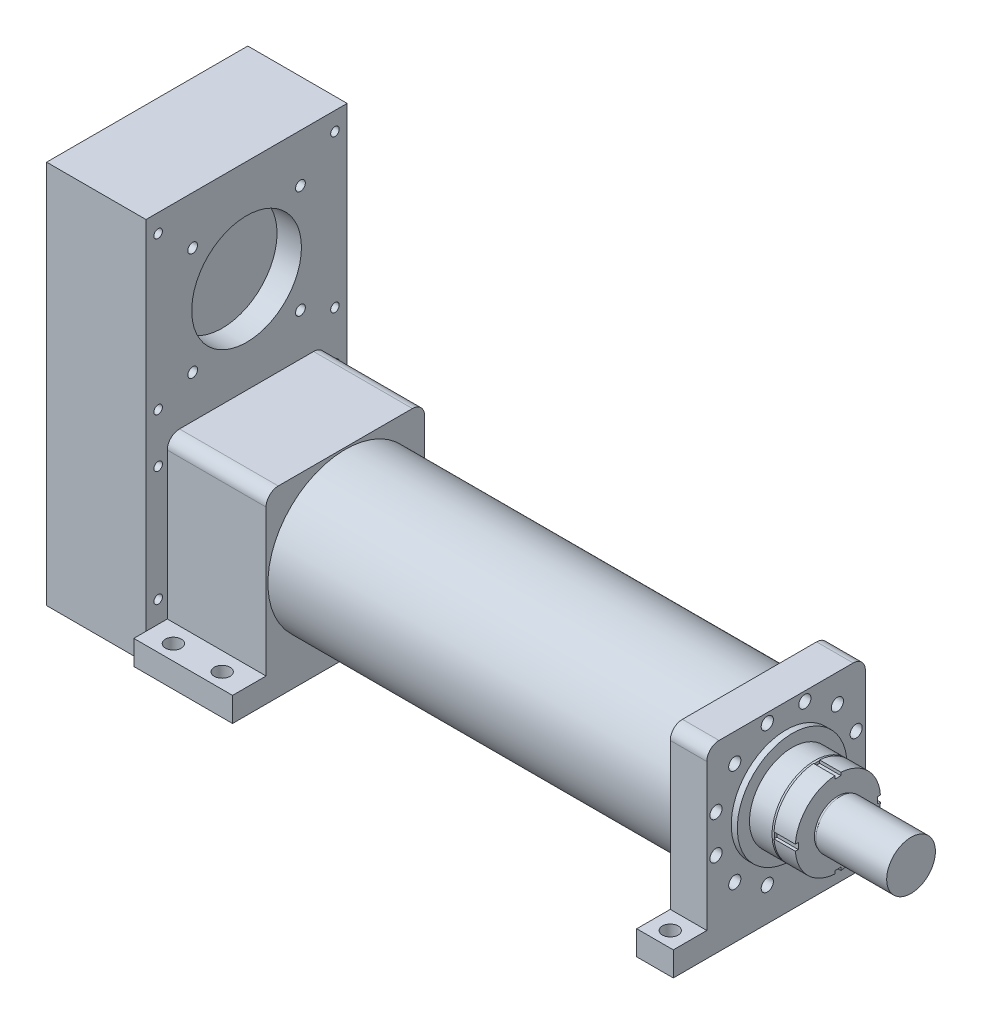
ISO-10303-21;
HEADER;
FILE_DESCRIPTION(('STEP AP214'),'2;1');
FILE_NAME('part.step','',(''),(''),'','','');
FILE_SCHEMA(('AUTOMOTIVE_DESIGN { 1 0 10303 214 1 1 1 1 }'));
ENDSEC;
DATA;
#1=APPLICATION_CONTEXT('core data for automotive mechanical design processes');
#2=APPLICATION_PROTOCOL_DEFINITION('international standard','automotive_design',2000,#1);
#3=PRODUCT_CONTEXT('',#1,'mechanical');
#4=PRODUCT('Part','Part','',(#3));
#5=PRODUCT_RELATED_PRODUCT_CATEGORY('part','',(#4));
#6=PRODUCT_DEFINITION_FORMATION('','',#4);
#7=PRODUCT_DEFINITION_CONTEXT('part definition',#1,'design');
#8=PRODUCT_DEFINITION('design','',#6,#7);
#9=PRODUCT_DEFINITION_SHAPE('','',#8);
#10=(LENGTH_UNIT() NAMED_UNIT(*) SI_UNIT(.MILLI.,.METRE.));
#11=(NAMED_UNIT(*) PLANE_ANGLE_UNIT() SI_UNIT($,.RADIAN.));
#12=(NAMED_UNIT(*) SI_UNIT($,.STERADIAN.) SOLID_ANGLE_UNIT());
#13=UNCERTAINTY_MEASURE_WITH_UNIT(LENGTH_MEASURE(1.E-05),#10,'distance_accuracy_value','');
#14=(GEOMETRIC_REPRESENTATION_CONTEXT(3) GLOBAL_UNCERTAINTY_ASSIGNED_CONTEXT((#13)) GLOBAL_UNIT_ASSIGNED_CONTEXT((#10,
#11,#12)) REPRESENTATION_CONTEXT('',''));
#15=CARTESIAN_POINT('',(0.,0.,0.));
#16=DIRECTION('',(0.,0.,1.));
#17=DIRECTION('',(1.,0.,0.));
#18=AXIS2_PLACEMENT_3D('',#15,#16,#17);
#19=CARTESIAN_POINT('',(-162.,110.,-110.));
#20=DIRECTION('',(-1.,0.,0.));
#21=DIRECTION('',(0.,0.,1.));
#22=AXIS2_PLACEMENT_3D('',#19,#20,#21);
#23=PLANE('',#22);
#24=DIRECTION('',(0.,1.,0.));
#25=VECTOR('',#24,1.);
#26=CARTESIAN_POINT('',(-162.,455.,165.));
#27=LINE('',#26,#25);
#28=CARTESIAN_POINT('',(-162.,-170.,165.));
#29=VERTEX_POINT('',#28);
#30=CARTESIAN_POINT('',(-162.,-130.,165.));
#31=VERTEX_POINT('',#30);
#32=EDGE_CURVE('E74',#29,#31,#27,.T.);
#33=ORIENTED_EDGE('',*,*,#32,.F.);
#34=DIRECTION('',(0.,0.,-1.));
#35=VECTOR('',#34,1.);
#36=CARTESIAN_POINT('',(-162.,-170.,185.));
#37=LINE('',#36,#35);
#38=CARTESIAN_POINT('',(-162.,-170.,185.));
#39=VERTEX_POINT('',#38);
#40=EDGE_CURVE('E231',#39,#29,#37,.T.);
#41=ORIENTED_EDGE('',*,*,#40,.F.);
#42=DIRECTION('',(0.,1.,0.));
#43=VECTOR('',#42,1.);
#44=CARTESIAN_POINT('',(-162.,-170.,185.));
#45=LINE('',#44,#43);
#46=CARTESIAN_POINT('',(-162.,-130.,185.));
#47=VERTEX_POINT('',#46);
#48=EDGE_CURVE('E252',#39,#47,#45,.T.);
#49=ORIENTED_EDGE('',*,*,#48,.T.);
#50=DIRECTION('',(0.,0.,-1.));
#51=VECTOR('',#50,1.);
#52=CARTESIAN_POINT('',(-162.,-130.,185.));
#53=LINE('',#52,#51);
#54=EDGE_CURVE('E243',#47,#31,#53,.T.);
#55=ORIENTED_EDGE('',*,*,#54,.T.);
#56=EDGE_LOOP('',(#33,#41,#49,#55));
#57=FACE_BOUND('',#56,.T.);
#58=ADVANCED_FACE('F49',(#57),#23,.T.);
#59=CARTESIAN_POINT('',(-162.,110.,130.));
#60=DIRECTION('',(0.,0.,-1.));
#61=DIRECTION('',(0.,1.,0.));
#62=AXIS2_PLACEMENT_3D('',#59,#60,#61);
#63=PLANE('',#62);
#64=DIRECTION('',(0.,1.,0.));
#65=VECTOR('',#64,1.);
#66=CARTESIAN_POINT('',(0.,110.,130.));
#67=LINE('',#66,#65);
#68=CARTESIAN_POINT('',(0.,-130.,130.));
#69=VERTEX_POINT('',#68);
#70=CARTESIAN_POINT('',(0.,110.,130.));
#71=VERTEX_POINT('',#70);
#72=EDGE_CURVE('E258',#69,#71,#67,.T.);
#73=ORIENTED_EDGE('',*,*,#72,.T.);
#74=DIRECTION('',(1.,0.,0.));
#75=VECTOR('',#74,1.);
#76=CARTESIAN_POINT('',(-162.,110.,130.));
#77=LINE('',#76,#75);
#78=CARTESIAN_POINT('',(-162.,110.,130.));
#79=VERTEX_POINT('',#78);
#80=EDGE_CURVE('E295',#79,#71,#77,.T.);
#81=ORIENTED_EDGE('',*,*,#80,.F.);
#82=DIRECTION('',(0.,1.,0.));
#83=VECTOR('',#82,1.);
#84=CARTESIAN_POINT('',(-162.,-110.,130.));
#85=LINE('',#84,#83);
#86=CARTESIAN_POINT('',(-162.,-130.,130.));
#87=VERTEX_POINT('',#86);
#88=EDGE_CURVE('E259',#87,#79,#85,.T.);
#89=ORIENTED_EDGE('',*,*,#88,.F.);
#90=DIRECTION('',(1.,0.,0.));
#91=VECTOR('',#90,1.);
#92=CARTESIAN_POINT('',(-162.,-130.,130.));
#93=LINE('',#92,#91);
#94=EDGE_CURVE('E53',#87,#69,#93,.T.);
#95=ORIENTED_EDGE('',*,*,#94,.T.);
#96=EDGE_LOOP('',(#73,#81,#89,#95));
#97=FACE_BOUND('',#96,.T.);
#98=ADVANCED_FACE('F51',(#97),#63,.F.);
#99=CARTESIAN_POINT('',(-162.,110.,110.));
#100=DIRECTION('',(1.,0.,0.));
#101=DIRECTION('',(0.,0.,-1.));
#102=AXIS2_PLACEMENT_3D('',#99,#100,#101);
#103=CYLINDRICAL_SURFACE('',#102,20.);
#104=CARTESIAN_POINT('',(0.,110.,110.));
#105=DIRECTION('',(-1.,0.,0.));
#106=DIRECTION('',(0.,0.,1.));
#107=AXIS2_PLACEMENT_3D('',#104,#105,#106);
#108=CIRCLE('',#107,20.);
#109=CARTESIAN_POINT('',(0.,130.,110.));
#110=VERTEX_POINT('',#109);
#111=EDGE_CURVE('E277',#71,#110,#108,.T.);
#112=ORIENTED_EDGE('',*,*,#111,.T.);
#113=DIRECTION('',(1.,0.,0.));
#114=VECTOR('',#113,1.);
#115=CARTESIAN_POINT('',(-162.,130.,110.));
#116=LINE('',#115,#114);
#117=CARTESIAN_POINT('',(-162.,130.,110.));
#118=VERTEX_POINT('',#117);
#119=EDGE_CURVE('E293',#118,#110,#116,.T.);
#120=ORIENTED_EDGE('',*,*,#119,.F.);
#121=CARTESIAN_POINT('',(-162.,110.,110.));
#122=DIRECTION('',(-1.,0.,0.));
#123=DIRECTION('',(0.,0.,1.));
#124=AXIS2_PLACEMENT_3D('',#121,#122,#123);
#125=CIRCLE('',#124,20.);
#126=EDGE_CURVE('E262',#79,#118,#125,.T.);
#127=ORIENTED_EDGE('',*,*,#126,.F.);
#128=ORIENTED_EDGE('',*,*,#80,.T.);
#129=EDGE_LOOP('',(#112,#120,#127,#128));
#130=FACE_BOUND('',#129,.T.);
#131=ADVANCED_FACE('F481',(#130),#103,.T.);
#132=CARTESIAN_POINT('',(-162.,130.,-110.));
#133=DIRECTION('',(0.,-1.,0.));
#134=DIRECTION('',(0.,0.,-1.));
#135=AXIS2_PLACEMENT_3D('',#132,#133,#134);
#136=PLANE('',#135);
#137=DIRECTION('',(0.,0.,-1.));
#138=VECTOR('',#137,1.);
#139=CARTESIAN_POINT('',(0.,130.,-110.));
#140=LINE('',#139,#138);
#141=CARTESIAN_POINT('',(0.,130.,-110.));
#142=VERTEX_POINT('',#141);
#143=EDGE_CURVE('E279',#110,#142,#140,.T.);
#144=ORIENTED_EDGE('',*,*,#143,.T.);
#145=DIRECTION('',(1.,0.,0.));
#146=VECTOR('',#145,1.);
#147=CARTESIAN_POINT('',(-162.,130.,-110.));
#148=LINE('',#147,#146);
#149=CARTESIAN_POINT('',(-162.,130.,-110.));
#150=VERTEX_POINT('',#149);
#151=EDGE_CURVE('E290',#150,#142,#148,.T.);
#152=ORIENTED_EDGE('',*,*,#151,.F.);
#153=DIRECTION('',(0.,0.,-1.));
#154=VECTOR('',#153,1.);
#155=CARTESIAN_POINT('',(-162.,130.,-110.));
#156=LINE('',#155,#154);
#157=EDGE_CURVE('E266',#118,#150,#156,.T.);
#158=ORIENTED_EDGE('',*,*,#157,.F.);
#159=ORIENTED_EDGE('',*,*,#119,.T.);
#160=EDGE_LOOP('',(#144,#152,#158,#159));
#161=FACE_BOUND('',#160,.T.);
#162=ADVANCED_FACE('F484',(#161),#136,.F.);
#163=CARTESIAN_POINT('',(-162.,110.,-110.));
#164=DIRECTION('',(1.,0.,0.));
#165=DIRECTION('',(0.,0.,-1.));
#166=AXIS2_PLACEMENT_3D('',#163,#164,#165);
#167=CYLINDRICAL_SURFACE('',#166,20.);
#168=CARTESIAN_POINT('',(0.,110.,-110.));
#169=DIRECTION('',(-1.,0.,0.));
#170=DIRECTION('',(0.,0.,1.));
#171=AXIS2_PLACEMENT_3D('',#168,#169,#170);
#172=CIRCLE('',#171,20.);
#173=CARTESIAN_POINT('',(0.,110.,-130.));
#174=VERTEX_POINT('',#173);
#175=EDGE_CURVE('E281',#142,#174,#172,.T.);
#176=ORIENTED_EDGE('',*,*,#175,.T.);
#177=DIRECTION('',(1.,0.,0.));
#178=VECTOR('',#177,1.);
#179=CARTESIAN_POINT('',(-162.,110.,-130.));
#180=LINE('',#179,#178);
#181=CARTESIAN_POINT('',(-162.,110.,-130.));
#182=VERTEX_POINT('',#181);
#183=EDGE_CURVE('E287',#182,#174,#180,.T.);
#184=ORIENTED_EDGE('',*,*,#183,.F.);
#185=CARTESIAN_POINT('',(-162.,110.,-110.));
#186=DIRECTION('',(-1.,0.,0.));
#187=DIRECTION('',(0.,0.,1.));
#188=AXIS2_PLACEMENT_3D('',#185,#186,#187);
#189=CIRCLE('',#188,20.);
#190=EDGE_CURVE('E269',#150,#182,#189,.T.);
#191=ORIENTED_EDGE('',*,*,#190,.F.);
#192=ORIENTED_EDGE('',*,*,#151,.T.);
#193=EDGE_LOOP('',(#176,#184,#191,#192));
#194=FACE_BOUND('',#193,.T.);
#195=ADVANCED_FACE('F486',(#194),#167,.T.);
#196=CARTESIAN_POINT('',(-162.,-130.,-130.));
#197=DIRECTION('',(0.,0.,1.));
#198=DIRECTION('',(1.,0.,0.));
#199=AXIS2_PLACEMENT_3D('',#196,#197,#198);
#200=PLANE('',#199);
#201=DIRECTION('',(0.,-1.,0.));
#202=VECTOR('',#201,1.);
#203=CARTESIAN_POINT('',(0.,-130.,-130.));
#204=LINE('',#203,#202);
#205=CARTESIAN_POINT('',(0.,-130.,-130.));
#206=VERTEX_POINT('',#205);
#207=EDGE_CURVE('E263',#174,#206,#204,.T.);
#208=ORIENTED_EDGE('',*,*,#207,.T.);
#209=DIRECTION('',(1.,0.,0.));
#210=VECTOR('',#209,1.);
#211=CARTESIAN_POINT('',(-162.,-130.,-130.));
#212=LINE('',#211,#210);
#213=CARTESIAN_POINT('',(-162.,-130.,-130.));
#214=VERTEX_POINT('',#213);
#215=EDGE_CURVE('E275',#214,#206,#212,.T.);
#216=ORIENTED_EDGE('',*,*,#215,.F.);
#217=DIRECTION('',(0.,-1.,0.));
#218=VECTOR('',#217,1.);
#219=CARTESIAN_POINT('',(-162.,110.,-130.));
#220=LINE('',#219,#218);
#221=EDGE_CURVE('E272',#182,#214,#220,.T.);
#222=ORIENTED_EDGE('',*,*,#221,.F.);
#223=ORIENTED_EDGE('',*,*,#183,.T.);
#224=EDGE_LOOP('',(#208,#216,#222,#223));
#225=FACE_BOUND('',#224,.T.);
#226=ADVANCED_FACE('F446',(#225),#200,.F.);
#227=DIRECTION('',(0.,-1.,0.));
#228=VECTOR('',#227,1.);
#229=CARTESIAN_POINT('',(-162.,455.,-165.));
#230=LINE('',#229,#228);
#231=CARTESIAN_POINT('',(-162.,-130.,-165.));
#232=VERTEX_POINT('',#231);
#233=CARTESIAN_POINT('',(-162.,-170.,-165.));
#234=VERTEX_POINT('',#233);
#235=EDGE_CURVE('E301',#232,#234,#230,.T.);
#236=ORIENTED_EDGE('',*,*,#235,.F.);
#237=CARTESIAN_POINT('',(-162.,-130.,-185.));
#238=VERTEX_POINT('',#237);
#239=EDGE_CURVE('E242',#232,#238,#53,.T.);
#240=ORIENTED_EDGE('',*,*,#239,.T.);
#241=DIRECTION('',(0.,1.,0.));
#242=VECTOR('',#241,1.);
#243=CARTESIAN_POINT('',(-162.,-170.,-185.));
#244=LINE('',#243,#242);
#245=CARTESIAN_POINT('',(-162.,-170.,-185.));
#246=VERTEX_POINT('',#245);
#247=EDGE_CURVE('E249',#246,#238,#244,.T.);
#248=ORIENTED_EDGE('',*,*,#247,.F.);
#249=EDGE_CURVE('E230',#234,#246,#37,.T.);
#250=ORIENTED_EDGE('',*,*,#249,.F.);
#251=EDGE_LOOP('',(#236,#240,#248,#250));
#252=FACE_BOUND('',#251,.T.);
#253=ADVANCED_FACE('F454',(#252),#23,.T.);
#254=CARTESIAN_POINT('',(0.,110.,-110.));
#255=DIRECTION('',(-1.,0.,0.));
#256=DIRECTION('',(0.,0.,1.));
#257=AXIS2_PLACEMENT_3D('',#254,#255,#256);
#258=PLANE('',#257);
#259=ORIENTED_EDGE('',*,*,#72,.F.);
#260=DIRECTION('',(0.,0.,1.));
#261=VECTOR('',#260,1.);
#262=CARTESIAN_POINT('',(0.,-130.,185.));
#263=LINE('',#262,#261);
#264=CARTESIAN_POINT('',(0.,-130.,185.));
#265=VERTEX_POINT('',#264);
#266=EDGE_CURVE('E221',#69,#265,#263,.T.);
#267=ORIENTED_EDGE('',*,*,#266,.T.);
#268=DIRECTION('',(0.,1.,0.));
#269=VECTOR('',#268,1.);
#270=CARTESIAN_POINT('',(0.,-170.,185.));
#271=LINE('',#270,#269);
#272=CARTESIAN_POINT('',(0.,-170.,185.));
#273=VERTEX_POINT('',#272);
#274=EDGE_CURVE('E255',#273,#265,#271,.T.);
#275=ORIENTED_EDGE('',*,*,#274,.F.);
#276=DIRECTION('',(0.,0.,1.));
#277=VECTOR('',#276,1.);
#278=CARTESIAN_POINT('',(0.,-170.,185.));
#279=LINE('',#278,#277);
#280=CARTESIAN_POINT('',(0.,-170.,-185.));
#281=VERTEX_POINT('',#280);
#282=EDGE_CURVE('E224',#281,#273,#279,.T.);
#283=ORIENTED_EDGE('',*,*,#282,.F.);
#284=DIRECTION('',(0.,1.,0.));
#285=VECTOR('',#284,1.);
#286=CARTESIAN_POINT('',(0.,-170.,-185.));
#287=LINE('',#286,#285);
#288=CARTESIAN_POINT('',(0.,-130.,-185.));
#289=VERTEX_POINT('',#288);
#290=EDGE_CURVE('E236',#281,#289,#287,.T.);
#291=ORIENTED_EDGE('',*,*,#290,.T.);
#292=EDGE_CURVE('E237',#289,#206,#263,.T.);
#293=ORIENTED_EDGE('',*,*,#292,.T.);
#294=ORIENTED_EDGE('',*,*,#207,.F.);
#295=ORIENTED_EDGE('',*,*,#175,.F.);
#296=ORIENTED_EDGE('',*,*,#143,.F.);
#297=ORIENTED_EDGE('',*,*,#111,.F.);
#298=EDGE_LOOP('',(#259,#267,#275,#283,#291,#293,#294,#295,#296,#297));
#299=FACE_BOUND('',#298,.T.);
#300=ADVANCED_FACE('F461',(#299),#258,.F.);
#301=CARTESIAN_POINT('',(0.,-130.,0.));
#302=DIRECTION('',(0.,-1.,0.));
#303=DIRECTION('',(0.,0.,-1.));
#304=AXIS2_PLACEMENT_3D('',#301,#302,#303);
#305=PLANE('',#304);
#306=CARTESIAN_POINT('',(-42.,-130.,-160.));
#307=DIRECTION('',(0.,-1.,0.));
#308=DIRECTION('',(0.,0.,-1.));
#309=AXIS2_PLACEMENT_3D('',#306,#307,#308);
#310=CIRCLE('',#309,13.);
#311=CARTESIAN_POINT('',(-42.,-130.,-173.));
#312=VERTEX_POINT('',#311);
#313=EDGE_CURVE('E194',#312,#312,#310,.T.);
#314=ORIENTED_EDGE('',*,*,#313,.T.);
#315=EDGE_LOOP('',(#314));
#316=FACE_BOUND('',#315,.T.);
#317=CARTESIAN_POINT('',(-122.,-130.,-160.));
#318=DIRECTION('',(0.,-1.,0.));
#319=DIRECTION('',(0.,0.,-1.));
#320=AXIS2_PLACEMENT_3D('',#317,#318,#319);
#321=CIRCLE('',#320,13.);
#322=CARTESIAN_POINT('',(-122.,-130.,-173.));
#323=VERTEX_POINT('',#322);
#324=EDGE_CURVE('E204',#323,#323,#321,.T.);
#325=ORIENTED_EDGE('',*,*,#324,.T.);
#326=EDGE_LOOP('',(#325));
#327=FACE_BOUND('',#326,.T.);
#328=EDGE_CURVE('E245',#214,#232,#53,.T.);
#329=ORIENTED_EDGE('',*,*,#328,.F.);
#330=ORIENTED_EDGE('',*,*,#215,.T.);
#331=ORIENTED_EDGE('',*,*,#292,.F.);
#332=DIRECTION('',(1.,0.,0.));
#333=VECTOR('',#332,1.);
#334=CARTESIAN_POINT('',(-162.,-130.,-185.));
#335=LINE('',#334,#333);
#336=EDGE_CURVE('E228',#238,#289,#335,.T.);
#337=ORIENTED_EDGE('',*,*,#336,.F.);
#338=ORIENTED_EDGE('',*,*,#239,.F.);
#339=EDGE_LOOP('',(#329,#330,#331,#337,#338));
#340=FACE_BOUND('',#339,.T.);
#341=ADVANCED_FACE('F450',(#316,#327,#340),#305,.F.);
#342=CARTESIAN_POINT('',(0.,-170.,0.));
#343=DIRECTION('',(0.,-1.,0.));
#344=DIRECTION('',(0.,0.,-1.));
#345=AXIS2_PLACEMENT_3D('',#342,#343,#344);
#346=PLANE('',#345);
#347=CARTESIAN_POINT('',(-122.,-170.,-160.));
#348=DIRECTION('',(0.,-1.,0.));
#349=DIRECTION('',(0.,0.,-1.));
#350=AXIS2_PLACEMENT_3D('',#347,#348,#349);
#351=CIRCLE('',#350,13.);
#352=CARTESIAN_POINT('',(-122.,-170.,-173.));
#353=VERTEX_POINT('',#352);
#354=EDGE_CURVE('E206',#353,#353,#351,.T.);
#355=ORIENTED_EDGE('',*,*,#354,.F.);
#356=EDGE_LOOP('',(#355));
#357=FACE_BOUND('',#356,.T.);
#358=CARTESIAN_POINT('',(-122.,-170.,160.));
#359=DIRECTION('',(0.,-1.,0.));
#360=DIRECTION('',(0.,0.,-1.));
#361=AXIS2_PLACEMENT_3D('',#358,#359,#360);
#362=CIRCLE('',#361,13.);
#363=CARTESIAN_POINT('',(-122.,-170.,147.));
#364=VERTEX_POINT('',#363);
#365=EDGE_CURVE('E218',#364,#364,#362,.T.);
#366=ORIENTED_EDGE('',*,*,#365,.F.);
#367=EDGE_LOOP('',(#366));
#368=FACE_BOUND('',#367,.T.);
#369=ORIENTED_EDGE('',*,*,#282,.T.);
#370=DIRECTION('',(-1.,0.,0.));
#371=VECTOR('',#370,1.);
#372=CARTESIAN_POINT('',(-162.,-170.,185.));
#373=LINE('',#372,#371);
#374=EDGE_CURVE('E227',#273,#39,#373,.T.);
#375=ORIENTED_EDGE('',*,*,#374,.T.);
#376=ORIENTED_EDGE('',*,*,#40,.T.);
#377=EDGE_CURVE('E234',#29,#234,#37,.T.);
#378=ORIENTED_EDGE('',*,*,#377,.T.);
#379=ORIENTED_EDGE('',*,*,#249,.T.);
#380=DIRECTION('',(1.,0.,0.));
#381=VECTOR('',#380,1.);
#382=CARTESIAN_POINT('',(-162.,-170.,-185.));
#383=LINE('',#382,#381);
#384=EDGE_CURVE('E233',#246,#281,#383,.T.);
#385=ORIENTED_EDGE('',*,*,#384,.T.);
#386=EDGE_LOOP('',(#369,#375,#376,#378,#379,#385));
#387=FACE_BOUND('',#386,.T.);
#388=CARTESIAN_POINT('',(-42.,-170.,160.));
#389=DIRECTION('',(0.,-1.,0.));
#390=DIRECTION('',(0.,0.,-1.));
#391=AXIS2_PLACEMENT_3D('',#388,#389,#390);
#392=CIRCLE('',#391,13.);
#393=CARTESIAN_POINT('',(-42.,-170.,147.));
#394=VERTEX_POINT('',#393);
#395=EDGE_CURVE('E212',#394,#394,#392,.T.);
#396=ORIENTED_EDGE('',*,*,#395,.F.);
#397=EDGE_LOOP('',(#396));
#398=FACE_BOUND('',#397,.T.);
#399=CARTESIAN_POINT('',(-42.,-170.,-160.));
#400=DIRECTION('',(0.,-1.,0.));
#401=DIRECTION('',(0.,0.,-1.));
#402=AXIS2_PLACEMENT_3D('',#399,#400,#401);
#403=CIRCLE('',#402,13.);
#404=CARTESIAN_POINT('',(-42.,-170.,-173.));
#405=VERTEX_POINT('',#404);
#406=EDGE_CURVE('E197',#405,#405,#403,.T.);
#407=ORIENTED_EDGE('',*,*,#406,.F.);
#408=EDGE_LOOP('',(#407));
#409=FACE_BOUND('',#408,.T.);
#410=ADVANCED_FACE('F466',(#357,#368,#387,#398,#409),#346,.T.);
#411=ORIENTED_EDGE('',*,*,#94,.F.);
#412=EDGE_CURVE('E67',#31,#87,#53,.T.);
#413=ORIENTED_EDGE('',*,*,#412,.F.);
#414=ORIENTED_EDGE('',*,*,#54,.F.);
#415=DIRECTION('',(-1.,0.,0.));
#416=VECTOR('',#415,1.);
#417=CARTESIAN_POINT('',(-162.,-130.,185.));
#418=LINE('',#417,#416);
#419=EDGE_CURVE('E240',#265,#47,#418,.T.);
#420=ORIENTED_EDGE('',*,*,#419,.F.);
#421=ORIENTED_EDGE('',*,*,#266,.F.);
#422=EDGE_LOOP('',(#411,#413,#414,#420,#421));
#423=FACE_BOUND('',#422,.T.);
#424=CARTESIAN_POINT('',(-122.,-130.,160.));
#425=DIRECTION('',(0.,-1.,0.));
#426=DIRECTION('',(0.,0.,-1.));
#427=AXIS2_PLACEMENT_3D('',#424,#425,#426);
#428=CIRCLE('',#427,13.);
#429=CARTESIAN_POINT('',(-122.,-130.,147.));
#430=VERTEX_POINT('',#429);
#431=EDGE_CURVE('E215',#430,#430,#428,.T.);
#432=ORIENTED_EDGE('',*,*,#431,.T.);
#433=EDGE_LOOP('',(#432));
#434=FACE_BOUND('',#433,.T.);
#435=CARTESIAN_POINT('',(-42.,-130.,160.));
#436=DIRECTION('',(0.,-1.,0.));
#437=DIRECTION('',(0.,0.,-1.));
#438=AXIS2_PLACEMENT_3D('',#435,#436,#437);
#439=CIRCLE('',#438,13.);
#440=CARTESIAN_POINT('',(-42.,-130.,147.));
#441=VERTEX_POINT('',#440);
#442=EDGE_CURVE('E209',#441,#441,#439,.T.);
#443=ORIENTED_EDGE('',*,*,#442,.T.);
#444=EDGE_LOOP('',(#443));
#445=FACE_BOUND('',#444,.T.);
#446=ADVANCED_FACE('F477',(#423,#434,#445),#305,.F.);
#447=CARTESIAN_POINT('',(-162.,-170.,185.));
#448=DIRECTION('',(0.,0.,-1.));
#449=DIRECTION('',(-1.,0.,0.));
#450=AXIS2_PLACEMENT_3D('',#447,#448,#449);
#451=PLANE('',#450);
#452=ORIENTED_EDGE('',*,*,#419,.T.);
#453=ORIENTED_EDGE('',*,*,#48,.F.);
#454=ORIENTED_EDGE('',*,*,#374,.F.);
#455=ORIENTED_EDGE('',*,*,#274,.T.);
#456=EDGE_LOOP('',(#452,#453,#454,#455));
#457=FACE_BOUND('',#456,.T.);
#458=ADVANCED_FACE('F636',(#457),#451,.F.);
#459=CARTESIAN_POINT('',(-162.,-170.,-185.));
#460=DIRECTION('',(0.,0.,1.));
#461=DIRECTION('',(1.,0.,0.));
#462=AXIS2_PLACEMENT_3D('',#459,#460,#461);
#463=PLANE('',#462);
#464=ORIENTED_EDGE('',*,*,#336,.T.);
#465=ORIENTED_EDGE('',*,*,#290,.F.);
#466=ORIENTED_EDGE('',*,*,#384,.F.);
#467=ORIENTED_EDGE('',*,*,#247,.T.);
#468=EDGE_LOOP('',(#464,#465,#466,#467));
#469=FACE_BOUND('',#468,.T.);
#470=ADVANCED_FACE('F458',(#469),#463,.F.);
#471=CARTESIAN_POINT('',(-122.,-170.,160.));
#472=DIRECTION('',(0.,1.,0.));
#473=DIRECTION('',(0.,0.,1.));
#474=AXIS2_PLACEMENT_3D('',#471,#472,#473);
#475=CYLINDRICAL_SURFACE('',#474,13.);
#476=ORIENTED_EDGE('',*,*,#365,.T.);
#477=EDGE_LOOP('',(#476));
#478=FACE_BOUND('',#477,.T.);
#479=ORIENTED_EDGE('',*,*,#431,.F.);
#480=EDGE_LOOP('',(#479));
#481=FACE_BOUND('',#480,.T.);
#482=ADVANCED_FACE('F626',(#478,#481),#475,.F.);
#483=CARTESIAN_POINT('',(-42.,-170.,160.));
#484=DIRECTION('',(0.,1.,0.));
#485=DIRECTION('',(0.,0.,1.));
#486=AXIS2_PLACEMENT_3D('',#483,#484,#485);
#487=CYLINDRICAL_SURFACE('',#486,13.);
#488=ORIENTED_EDGE('',*,*,#395,.T.);
#489=EDGE_LOOP('',(#488));
#490=FACE_BOUND('',#489,.T.);
#491=ORIENTED_EDGE('',*,*,#442,.F.);
#492=EDGE_LOOP('',(#491));
#493=FACE_BOUND('',#492,.T.);
#494=ADVANCED_FACE('F622',(#490,#493),#487,.F.);
#495=CARTESIAN_POINT('',(-122.,-170.,-160.));
#496=DIRECTION('',(0.,1.,0.));
#497=DIRECTION('',(0.,0.,1.));
#498=AXIS2_PLACEMENT_3D('',#495,#496,#497);
#499=CYLINDRICAL_SURFACE('',#498,13.);
#500=ORIENTED_EDGE('',*,*,#354,.T.);
#501=EDGE_LOOP('',(#500));
#502=FACE_BOUND('',#501,.T.);
#503=ORIENTED_EDGE('',*,*,#324,.F.);
#504=EDGE_LOOP('',(#503));
#505=FACE_BOUND('',#504,.T.);
#506=ADVANCED_FACE('F618',(#502,#505),#499,.F.);
#507=CARTESIAN_POINT('',(-42.,-170.,-160.));
#508=DIRECTION('',(0.,1.,0.));
#509=DIRECTION('',(0.,0.,1.));
#510=AXIS2_PLACEMENT_3D('',#507,#508,#509);
#511=CYLINDRICAL_SURFACE('',#510,13.);
#512=ORIENTED_EDGE('',*,*,#406,.T.);
#513=EDGE_LOOP('',(#512));
#514=FACE_BOUND('',#513,.T.);
#515=ORIENTED_EDGE('',*,*,#313,.F.);
#516=EDGE_LOOP('',(#515));
#517=FACE_BOUND('',#516,.T.);
#518=ADVANCED_FACE('F553',(#514,#517),#511,.F.);
#519=CARTESIAN_POINT('',(-202.,-94.5,145.));
#520=DIRECTION('',(1.,0.,0.));
#521=DIRECTION('',(0.,0.,-1.));
#522=AXIS2_PLACEMENT_3D('',#519,#520,#521);
#523=PLANE('',#522);
#524=CARTESIAN_POINT('',(-202.,-94.5,145.));
#525=DIRECTION('',(1.,0.,0.));
#526=DIRECTION('',(0.,0.,-1.));
#527=AXIS2_PLACEMENT_3D('',#524,#525,#526);
#528=CIRCLE('',#527,7.00000000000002);
#529=CARTESIAN_POINT('',(-202.,-94.5,138.));
#530=VERTEX_POINT('',#529);
#531=EDGE_CURVE('E360',#530,#530,#528,.T.);
#532=ORIENTED_EDGE('',*,*,#531,.T.);
#533=EDGE_LOOP('',(#532));
#534=FACE_BOUND('',#533,.T.);
#535=ADVANCED_FACE('F550',(#534),#523,.T.);
#536=CARTESIAN_POINT('',(-202.,-94.5,145.));
#537=DIRECTION('',(1.,0.,0.));
#538=DIRECTION('',(0.,0.,-1.));
#539=AXIS2_PLACEMENT_3D('',#536,#537,#538);
#540=CYLINDRICAL_SURFACE('',#539,7.00000000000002);
#541=ORIENTED_EDGE('',*,*,#531,.F.);
#542=EDGE_LOOP('',(#541));
#543=FACE_BOUND('',#542,.T.);
#544=CARTESIAN_POINT('',(-162.,-94.5,145.));
#545=DIRECTION('',(1.,0.,0.));
#546=DIRECTION('',(0.,0.,-1.));
#547=AXIS2_PLACEMENT_3D('',#544,#545,#546);
#548=CIRCLE('',#547,7.00000000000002);
#549=CARTESIAN_POINT('',(-162.,-94.5,138.));
#550=VERTEX_POINT('',#549);
#551=EDGE_CURVE('E356',#550,#550,#548,.T.);
#552=ORIENTED_EDGE('',*,*,#551,.T.);
#553=EDGE_LOOP('',(#552));
#554=FACE_BOUND('',#553,.T.);
#555=ADVANCED_FACE('F545',(#543,#554),#540,.F.);
#556=CARTESIAN_POINT('',(-202.,94.5,145.));
#557=DIRECTION('',(1.,0.,0.));
#558=DIRECTION('',(0.,0.,-1.));
#559=AXIS2_PLACEMENT_3D('',#556,#557,#558);
#560=PLANE('',#559);
#561=CARTESIAN_POINT('',(-202.,94.5,145.));
#562=DIRECTION('',(1.,0.,0.));
#563=DIRECTION('',(0.,0.,-1.));
#564=AXIS2_PLACEMENT_3D('',#561,#562,#563);
#565=CIRCLE('',#564,7.00000000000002);
#566=CARTESIAN_POINT('',(-202.,94.5,138.));
#567=VERTEX_POINT('',#566);
#568=EDGE_CURVE('E366',#567,#567,#565,.T.);
#569=ORIENTED_EDGE('',*,*,#568,.T.);
#570=EDGE_LOOP('',(#569));
#571=FACE_BOUND('',#570,.T.);
#572=ADVANCED_FACE('F542',(#571),#560,.T.);
#573=CARTESIAN_POINT('',(-202.,94.5,145.));
#574=DIRECTION('',(1.,0.,0.));
#575=DIRECTION('',(0.,0.,-1.));
#576=AXIS2_PLACEMENT_3D('',#573,#574,#575);
#577=CYLINDRICAL_SURFACE('',#576,7.00000000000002);
#578=ORIENTED_EDGE('',*,*,#568,.F.);
#579=EDGE_LOOP('',(#578));
#580=FACE_BOUND('',#579,.T.);
#581=CARTESIAN_POINT('',(-162.,94.5,145.));
#582=DIRECTION('',(1.,0.,0.));
#583=DIRECTION('',(0.,0.,-1.));
#584=AXIS2_PLACEMENT_3D('',#581,#582,#583);
#585=CIRCLE('',#584,7.00000000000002);
#586=CARTESIAN_POINT('',(-162.,94.5,138.));
#587=VERTEX_POINT('',#586);
#588=EDGE_CURVE('E363',#587,#587,#585,.T.);
#589=ORIENTED_EDGE('',*,*,#588,.T.);
#590=EDGE_LOOP('',(#589));
#591=FACE_BOUND('',#590,.T.);
#592=ADVANCED_FACE('F536',(#580,#591),#577,.F.);
#593=CARTESIAN_POINT('',(-202.,199.611652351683,88.3883476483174));
#594=DIRECTION('',(1.,0.,0.));
#595=DIRECTION('',(0.,0.,-1.));
#596=AXIS2_PLACEMENT_3D('',#593,#594,#595);
#597=PLANE('',#596);
#598=CARTESIAN_POINT('',(-202.,199.611652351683,88.3883476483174));
#599=DIRECTION('',(1.,0.,0.));
#600=DIRECTION('',(0.,0.,-1.));
#601=AXIS2_PLACEMENT_3D('',#598,#599,#600);
#602=CIRCLE('',#601,8.00000000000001);
#603=CARTESIAN_POINT('',(-202.,199.611652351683,80.3883476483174));
#604=VERTEX_POINT('',#603);
#605=EDGE_CURVE('E333',#604,#604,#602,.T.);
#606=ORIENTED_EDGE('',*,*,#605,.T.);
#607=EDGE_LOOP('',(#606));
#608=FACE_BOUND('',#607,.T.);
#609=ADVANCED_FACE('F532',(#608),#597,.T.);
#610=CARTESIAN_POINT('',(-202.,199.611652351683,88.3883476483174));
#611=DIRECTION('',(1.,0.,0.));
#612=DIRECTION('',(0.,0.,-1.));
#613=AXIS2_PLACEMENT_3D('',#610,#611,#612);
#614=CYLINDRICAL_SURFACE('',#613,8.00000000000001);
#615=ORIENTED_EDGE('',*,*,#605,.F.);
#616=EDGE_LOOP('',(#615));
#617=FACE_BOUND('',#616,.T.);
#618=CARTESIAN_POINT('',(-162.,199.611652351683,88.3883476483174));
#619=DIRECTION('',(1.,0.,0.));
#620=DIRECTION('',(0.,0.,-1.));
#621=AXIS2_PLACEMENT_3D('',#618,#619,#620);
#622=CIRCLE('',#621,8.00000000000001);
#623=CARTESIAN_POINT('',(-162.,199.611652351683,80.3883476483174));
#624=VERTEX_POINT('',#623);
#625=EDGE_CURVE('E369',#624,#624,#622,.T.);
#626=ORIENTED_EDGE('',*,*,#625,.T.);
#627=EDGE_LOOP('',(#626));
#628=FACE_BOUND('',#627,.T.);
#629=ADVANCED_FACE('F535',(#617,#628),#614,.F.);
#630=CARTESIAN_POINT('',(-202.,199.611652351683,-88.3883476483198));
#631=DIRECTION('',(1.,0.,0.));
#632=DIRECTION('',(0.,0.,-1.));
#633=AXIS2_PLACEMENT_3D('',#630,#631,#632);
#634=PLANE('',#633);
#635=CARTESIAN_POINT('',(-202.,199.611652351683,-88.3883476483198));
#636=DIRECTION('',(1.,0.,0.));
#637=DIRECTION('',(0.,0.,-1.));
#638=AXIS2_PLACEMENT_3D('',#635,#636,#637);
#639=CIRCLE('',#638,8.00000000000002);
#640=CARTESIAN_POINT('',(-202.,199.611652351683,-96.3883476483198));
#641=VERTEX_POINT('',#640);
#642=EDGE_CURVE('E332',#641,#641,#639,.T.);
#643=ORIENTED_EDGE('',*,*,#642,.T.);
#644=EDGE_LOOP('',(#643));
#645=FACE_BOUND('',#644,.T.);
#646=ADVANCED_FACE('F540',(#645),#634,.T.);
#647=CARTESIAN_POINT('',(-202.,199.611652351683,-88.3883476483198));
#648=DIRECTION('',(1.,0.,0.));
#649=DIRECTION('',(0.,0.,-1.));
#650=AXIS2_PLACEMENT_3D('',#647,#648,#649);
#651=CYLINDRICAL_SURFACE('',#650,8.00000000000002);
#652=ORIENTED_EDGE('',*,*,#642,.F.);
#653=EDGE_LOOP('',(#652));
#654=FACE_BOUND('',#653,.T.);
#655=CARTESIAN_POINT('',(-162.,199.611652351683,-88.3883476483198));
#656=DIRECTION('',(1.,0.,0.));
#657=DIRECTION('',(0.,0.,-1.));
#658=AXIS2_PLACEMENT_3D('',#655,#656,#657);
#659=CIRCLE('',#658,8.00000000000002);
#660=CARTESIAN_POINT('',(-162.,199.611652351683,-96.3883476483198));
#661=VERTEX_POINT('',#660);
#662=EDGE_CURVE('E329',#661,#661,#659,.T.);
#663=ORIENTED_EDGE('',*,*,#662,.T.);
#664=EDGE_LOOP('',(#663));
#665=FACE_BOUND('',#664,.T.);
#666=ADVANCED_FACE('F585',(#654,#665),#651,.F.);
#667=CARTESIAN_POINT('',(-202.,376.38834764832,-88.3883476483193));
#668=DIRECTION('',(1.,0.,0.));
#669=DIRECTION('',(0.,0.,-1.));
#670=AXIS2_PLACEMENT_3D('',#667,#668,#669);
#671=PLANE('',#670);
#672=CARTESIAN_POINT('',(-202.,376.38834764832,-88.3883476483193));
#673=DIRECTION('',(1.,0.,0.));
#674=DIRECTION('',(0.,0.,-1.));
#675=AXIS2_PLACEMENT_3D('',#672,#673,#674);
#676=CIRCLE('',#675,7.99999999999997);
#677=CARTESIAN_POINT('',(-202.,376.38834764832,-96.3883476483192));
#678=VERTEX_POINT('',#677);
#679=EDGE_CURVE('E339',#678,#678,#676,.T.);
#680=ORIENTED_EDGE('',*,*,#679,.T.);
#681=EDGE_LOOP('',(#680));
#682=FACE_BOUND('',#681,.T.);
#683=ADVANCED_FACE('F582',(#682),#671,.T.);
#684=CARTESIAN_POINT('',(-202.,376.38834764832,-88.3883476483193));
#685=DIRECTION('',(1.,0.,0.));
#686=DIRECTION('',(0.,0.,-1.));
#687=AXIS2_PLACEMENT_3D('',#684,#685,#686);
#688=CYLINDRICAL_SURFACE('',#687,7.99999999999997);
#689=ORIENTED_EDGE('',*,*,#679,.F.);
#690=EDGE_LOOP('',(#689));
#691=FACE_BOUND('',#690,.T.);
#692=CARTESIAN_POINT('',(-162.,376.38834764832,-88.3883476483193));
#693=DIRECTION('',(1.,0.,0.));
#694=DIRECTION('',(0.,0.,-1.));
#695=AXIS2_PLACEMENT_3D('',#692,#693,#694);
#696=CIRCLE('',#695,7.99999999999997);
#697=CARTESIAN_POINT('',(-162.,376.38834764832,-96.3883476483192));
#698=VERTEX_POINT('',#697);
#699=EDGE_CURVE('E336',#698,#698,#696,.T.);
#700=ORIENTED_EDGE('',*,*,#699,.T.);
#701=EDGE_LOOP('',(#700));
#702=FACE_BOUND('',#701,.T.);
#703=ADVANCED_FACE('F577',(#691,#702),#688,.F.);
#704=CARTESIAN_POINT('',(-202.,175.,145.));
#705=DIRECTION('',(1.,0.,0.));
#706=DIRECTION('',(0.,0.,-1.));
#707=AXIS2_PLACEMENT_3D('',#704,#705,#706);
#708=PLANE('',#707);
#709=CARTESIAN_POINT('',(-202.,175.,145.));
#710=DIRECTION('',(1.,0.,0.));
#711=DIRECTION('',(0.,0.,-1.));
#712=AXIS2_PLACEMENT_3D('',#709,#710,#711);
#713=CIRCLE('',#712,7.00000000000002);
#714=CARTESIAN_POINT('',(-202.,175.,138.));
#715=VERTEX_POINT('',#714);
#716=EDGE_CURVE('E345',#715,#715,#713,.T.);
#717=ORIENTED_EDGE('',*,*,#716,.T.);
#718=EDGE_LOOP('',(#717));
#719=FACE_BOUND('',#718,.T.);
#720=ADVANCED_FACE('F574',(#719),#708,.T.);
#721=CARTESIAN_POINT('',(-202.,175.,145.));
#722=DIRECTION('',(1.,0.,0.));
#723=DIRECTION('',(0.,0.,-1.));
#724=AXIS2_PLACEMENT_3D('',#721,#722,#723);
#725=CYLINDRICAL_SURFACE('',#724,7.00000000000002);
#726=ORIENTED_EDGE('',*,*,#716,.F.);
#727=EDGE_LOOP('',(#726));
#728=FACE_BOUND('',#727,.T.);
#729=CARTESIAN_POINT('',(-162.,175.,145.));
#730=DIRECTION('',(1.,0.,0.));
#731=DIRECTION('',(0.,0.,-1.));
#732=AXIS2_PLACEMENT_3D('',#729,#730,#731);
#733=CIRCLE('',#732,7.00000000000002);
#734=CARTESIAN_POINT('',(-162.,175.,138.));
#735=VERTEX_POINT('',#734);
#736=EDGE_CURVE('E342',#735,#735,#733,.T.);
#737=ORIENTED_EDGE('',*,*,#736,.T.);
#738=EDGE_LOOP('',(#737));
#739=FACE_BOUND('',#738,.T.);
#740=ADVANCED_FACE('F568',(#728,#739),#725,.F.);
#741=CARTESIAN_POINT('',(-202.,376.388347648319,88.3883476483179));
#742=DIRECTION('',(1.,0.,0.));
#743=DIRECTION('',(0.,0.,-1.));
#744=AXIS2_PLACEMENT_3D('',#741,#742,#743);
#745=PLANE('',#744);
#746=CARTESIAN_POINT('',(-202.,376.388347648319,88.3883476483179));
#747=DIRECTION('',(1.,0.,0.));
#748=DIRECTION('',(0.,0.,-1.));
#749=AXIS2_PLACEMENT_3D('',#746,#747,#748);
#750=CIRCLE('',#749,8.00000000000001);
#751=CARTESIAN_POINT('',(-202.,376.388347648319,80.3883476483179));
#752=VERTEX_POINT('',#751);
#753=EDGE_CURVE('E326',#752,#752,#750,.T.);
#754=ORIENTED_EDGE('',*,*,#753,.T.);
#755=EDGE_LOOP('',(#754));
#756=FACE_BOUND('',#755,.T.);
#757=ADVANCED_FACE('F564',(#756),#745,.T.);
#758=CARTESIAN_POINT('',(-202.,376.388347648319,88.3883476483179));
#759=DIRECTION('',(1.,0.,0.));
#760=DIRECTION('',(0.,0.,-1.));
#761=AXIS2_PLACEMENT_3D('',#758,#759,#760);
#762=CYLINDRICAL_SURFACE('',#761,8.00000000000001);
#763=ORIENTED_EDGE('',*,*,#753,.F.);
#764=EDGE_LOOP('',(#763));
#765=FACE_BOUND('',#764,.T.);
#766=CARTESIAN_POINT('',(-162.,376.388347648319,88.3883476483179));
#767=DIRECTION('',(1.,0.,0.));
#768=DIRECTION('',(0.,0.,-1.));
#769=AXIS2_PLACEMENT_3D('',#766,#767,#768);
#770=CIRCLE('',#769,8.00000000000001);
#771=CARTESIAN_POINT('',(-162.,376.388347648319,80.3883476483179));
#772=VERTEX_POINT('',#771);
#773=EDGE_CURVE('E348',#772,#772,#770,.T.);
#774=ORIENTED_EDGE('',*,*,#773,.T.);
#775=EDGE_LOOP('',(#774));
#776=FACE_BOUND('',#775,.T.);
#777=ADVANCED_FACE('F567',(#765,#776),#762,.F.);
#778=CARTESIAN_POINT('',(-202.,425.,-145.));
#779=DIRECTION('',(-1.,0.,0.));
#780=DIRECTION('',(0.,0.,1.));
#781=AXIS2_PLACEMENT_3D('',#778,#779,#780);
#782=PLANE('',#781);
#783=CARTESIAN_POINT('',(-202.,425.,-145.));
#784=DIRECTION('',(1.,0.,0.));
#785=DIRECTION('',(0.,0.,1.));
#786=AXIS2_PLACEMENT_3D('',#783,#784,#785);
#787=CIRCLE('',#786,7.00000000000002);
#788=CARTESIAN_POINT('',(-202.,425.,-138.));
#789=VERTEX_POINT('',#788);
#790=EDGE_CURVE('E400',#789,#789,#787,.T.);
#791=ORIENTED_EDGE('',*,*,#790,.T.);
#792=EDGE_LOOP('',(#791));
#793=FACE_BOUND('',#792,.T.);
#794=ADVANCED_FACE('F572',(#793),#782,.F.);
#795=CARTESIAN_POINT('',(-202.,425.,-145.));
#796=DIRECTION('',(1.,0.,0.));
#797=DIRECTION('',(0.,0.,-1.));
#798=AXIS2_PLACEMENT_3D('',#795,#796,#797);
#799=CYLINDRICAL_SURFACE('',#798,7.00000000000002);
#800=ORIENTED_EDGE('',*,*,#790,.F.);
#801=EDGE_LOOP('',(#800));
#802=FACE_BOUND('',#801,.T.);
#803=CARTESIAN_POINT('',(-162.,425.,-145.));
#804=DIRECTION('',(1.,0.,0.));
#805=DIRECTION('',(0.,0.,1.));
#806=AXIS2_PLACEMENT_3D('',#803,#804,#805);
#807=CIRCLE('',#806,7.00000000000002);
#808=CARTESIAN_POINT('',(-162.,425.,-138.));
#809=VERTEX_POINT('',#808);
#810=EDGE_CURVE('E397',#809,#809,#807,.T.);
#811=ORIENTED_EDGE('',*,*,#810,.T.);
#812=EDGE_LOOP('',(#811));
#813=FACE_BOUND('',#812,.T.);
#814=ADVANCED_FACE('F726',(#802,#813),#799,.F.);
#815=CARTESIAN_POINT('',(-202.,175.,-145.));
#816=DIRECTION('',(-1.,0.,0.));
#817=DIRECTION('',(0.,0.,1.));
#818=AXIS2_PLACEMENT_3D('',#815,#816,#817);
#819=PLANE('',#818);
#820=CARTESIAN_POINT('',(-202.,175.,-145.));
#821=DIRECTION('',(1.,0.,0.));
#822=DIRECTION('',(0.,0.,1.));
#823=AXIS2_PLACEMENT_3D('',#820,#821,#822);
#824=CIRCLE('',#823,7.00000000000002);
#825=CARTESIAN_POINT('',(-202.,175.,-138.));
#826=VERTEX_POINT('',#825);
#827=EDGE_CURVE('E389',#826,#826,#824,.T.);
#828=ORIENTED_EDGE('',*,*,#827,.T.);
#829=EDGE_LOOP('',(#828));
#830=FACE_BOUND('',#829,.T.);
#831=ADVANCED_FACE('F409',(#830),#819,.F.);
#832=CARTESIAN_POINT('',(-202.,175.,-145.));
#833=DIRECTION('',(1.,0.,0.));
#834=DIRECTION('',(0.,0.,-1.));
#835=AXIS2_PLACEMENT_3D('',#832,#833,#834);
#836=CYLINDRICAL_SURFACE('',#835,7.00000000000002);
#837=ORIENTED_EDGE('',*,*,#827,.F.);
#838=EDGE_LOOP('',(#837));
#839=FACE_BOUND('',#838,.T.);
#840=CARTESIAN_POINT('',(-162.,175.,-145.));
#841=DIRECTION('',(1.,0.,0.));
#842=DIRECTION('',(0.,0.,1.));
#843=AXIS2_PLACEMENT_3D('',#840,#841,#842);
#844=CIRCLE('',#843,7.00000000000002);
#845=CARTESIAN_POINT('',(-162.,175.,-138.));
#846=VERTEX_POINT('',#845);
#847=EDGE_CURVE('E403',#846,#846,#844,.T.);
#848=ORIENTED_EDGE('',*,*,#847,.T.);
#849=EDGE_LOOP('',(#848));
#850=FACE_BOUND('',#849,.T.);
#851=ADVANCED_FACE('F411',(#839,#850),#836,.F.);
#852=CARTESIAN_POINT('',(-202.,425.,145.));
#853=DIRECTION('',(1.,0.,0.));
#854=DIRECTION('',(0.,0.,-1.));
#855=AXIS2_PLACEMENT_3D('',#852,#853,#854);
#856=PLANE('',#855);
#857=CARTESIAN_POINT('',(-202.,425.,145.));
#858=DIRECTION('',(1.,0.,0.));
#859=DIRECTION('',(0.,0.,-1.));
#860=AXIS2_PLACEMENT_3D('',#857,#858,#859);
#861=CIRCLE('',#860,7.00000000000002);
#862=CARTESIAN_POINT('',(-202.,425.,138.));
#863=VERTEX_POINT('',#862);
#864=EDGE_CURVE('E357',#863,#863,#861,.T.);
#865=ORIENTED_EDGE('',*,*,#864,.T.);
#866=EDGE_LOOP('',(#865));
#867=FACE_BOUND('',#866,.T.);
#868=ADVANCED_FACE('F414',(#867),#856,.T.);
#869=CARTESIAN_POINT('',(-202.,425.,145.));
#870=DIRECTION('',(1.,0.,0.));
#871=DIRECTION('',(0.,0.,-1.));
#872=AXIS2_PLACEMENT_3D('',#869,#870,#871);
#873=CYLINDRICAL_SURFACE('',#872,7.00000000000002);
#874=ORIENTED_EDGE('',*,*,#864,.F.);
#875=EDGE_LOOP('',(#874));
#876=FACE_BOUND('',#875,.T.);
#877=CARTESIAN_POINT('',(-162.,425.,145.));
#878=DIRECTION('',(1.,0.,0.));
#879=DIRECTION('',(0.,0.,-1.));
#880=AXIS2_PLACEMENT_3D('',#877,#878,#879);
#881=CIRCLE('',#880,7.00000000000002);
#882=CARTESIAN_POINT('',(-162.,425.,138.));
#883=VERTEX_POINT('',#882);
#884=EDGE_CURVE('E379',#883,#883,#881,.T.);
#885=ORIENTED_EDGE('',*,*,#884,.T.);
#886=EDGE_LOOP('',(#885));
#887=FACE_BOUND('',#886,.T.);
#888=ADVANCED_FACE('F529',(#876,#887),#873,.F.);
#889=CARTESIAN_POINT('',(-202.,-94.5000000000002,-145.));
#890=DIRECTION('',(-1.,0.,0.));
#891=DIRECTION('',(0.,0.,1.));
#892=AXIS2_PLACEMENT_3D('',#889,#890,#891);
#893=PLANE('',#892);
#894=CARTESIAN_POINT('',(-202.,-94.5000000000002,-145.));
#895=DIRECTION('',(1.,0.,0.));
#896=DIRECTION('',(0.,0.,1.));
#897=AXIS2_PLACEMENT_3D('',#894,#895,#896);
#898=CIRCLE('',#897,7.00000000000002);
#899=CARTESIAN_POINT('',(-202.,-94.5000000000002,-138.));
#900=VERTEX_POINT('',#899);
#901=EDGE_CURVE('E380',#900,#900,#898,.T.);
#902=ORIENTED_EDGE('',*,*,#901,.T.);
#903=EDGE_LOOP('',(#902));
#904=FACE_BOUND('',#903,.T.);
#905=ADVANCED_FACE('F757',(#904),#893,.F.);
#906=CARTESIAN_POINT('',(-202.,-94.5000000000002,-145.));
#907=DIRECTION('',(1.,0.,0.));
#908=DIRECTION('',(0.,0.,-1.));
#909=AXIS2_PLACEMENT_3D('',#906,#907,#908);
#910=CYLINDRICAL_SURFACE('',#909,7.00000000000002);
#911=ORIENTED_EDGE('',*,*,#901,.F.);
#912=EDGE_LOOP('',(#911));
#913=FACE_BOUND('',#912,.T.);
#914=CARTESIAN_POINT('',(-162.,-94.5000000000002,-145.));
#915=DIRECTION('',(1.,0.,0.));
#916=DIRECTION('',(0.,0.,1.));
#917=AXIS2_PLACEMENT_3D('',#914,#915,#916);
#918=CIRCLE('',#917,7.00000000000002);
#919=CARTESIAN_POINT('',(-162.,-94.5000000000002,-138.));
#920=VERTEX_POINT('',#919);
#921=EDGE_CURVE('E392',#920,#920,#918,.T.);
#922=ORIENTED_EDGE('',*,*,#921,.T.);
#923=EDGE_LOOP('',(#922));
#924=FACE_BOUND('',#923,.T.);
#925=ADVANCED_FACE('F764',(#913,#924),#910,.F.);
#926=CARTESIAN_POINT('',(-202.,94.4999999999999,-145.));
#927=DIRECTION('',(-1.,0.,0.));
#928=DIRECTION('',(0.,0.,1.));
#929=AXIS2_PLACEMENT_3D('',#926,#927,#928);
#930=PLANE('',#929);
#931=CARTESIAN_POINT('',(-202.,94.4999999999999,-145.));
#932=DIRECTION('',(1.,0.,0.));
#933=DIRECTION('',(0.,0.,1.));
#934=AXIS2_PLACEMENT_3D('',#931,#932,#933);
#935=CIRCLE('',#934,7.00000000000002);
#936=CARTESIAN_POINT('',(-202.,94.4999999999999,-138.));
#937=VERTEX_POINT('',#936);
#938=EDGE_CURVE('E388',#937,#937,#935,.T.);
#939=ORIENTED_EDGE('',*,*,#938,.T.);
#940=EDGE_LOOP('',(#939));
#941=FACE_BOUND('',#940,.T.);
#942=ADVANCED_FACE('F772',(#941),#930,.F.);
#943=CARTESIAN_POINT('',(-202.,94.4999999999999,-145.));
#944=DIRECTION('',(1.,0.,0.));
#945=DIRECTION('',(0.,0.,-1.));
#946=AXIS2_PLACEMENT_3D('',#943,#944,#945);
#947=CYLINDRICAL_SURFACE('',#946,7.00000000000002);
#948=ORIENTED_EDGE('',*,*,#938,.F.);
#949=EDGE_LOOP('',(#948));
#950=FACE_BOUND('',#949,.T.);
#951=CARTESIAN_POINT('',(-162.,94.4999999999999,-145.));
#952=DIRECTION('',(1.,0.,0.));
#953=DIRECTION('',(0.,0.,1.));
#954=AXIS2_PLACEMENT_3D('',#951,#952,#953);
#955=CIRCLE('',#954,7.00000000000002);
#956=CARTESIAN_POINT('',(-162.,94.4999999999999,-138.));
#957=VERTEX_POINT('',#956);
#958=EDGE_CURVE('E385',#957,#957,#955,.T.);
#959=ORIENTED_EDGE('',*,*,#958,.T.);
#960=EDGE_LOOP('',(#959));
#961=FACE_BOUND('',#960,.T.);
#962=ADVANCED_FACE('F600',(#950,#961),#947,.F.);
#963=CARTESIAN_POINT('',(-202.,288.,0.));
#964=DIRECTION('',(1.,0.,0.));
#965=DIRECTION('',(0.,0.,-1.));
#966=AXIS2_PLACEMENT_3D('',#963,#964,#965);
#967=PLANE('',#966);
#968=CARTESIAN_POINT('',(-202.,288.,0.));
#969=DIRECTION('',(1.,0.,0.));
#970=DIRECTION('',(0.,0.,-1.));
#971=AXIS2_PLACEMENT_3D('',#968,#969,#970);
#972=CIRCLE('',#971,90.);
#973=CARTESIAN_POINT('',(-202.,288.,-90.));
#974=VERTEX_POINT('',#973);
#975=EDGE_CURVE('E325',#974,#974,#972,.T.);
#976=ORIENTED_EDGE('',*,*,#975,.T.);
#977=EDGE_LOOP('',(#976));
#978=FACE_BOUND('',#977,.T.);
#979=ADVANCED_FACE('F596',(#978),#967,.T.);
#980=CARTESIAN_POINT('',(-202.,288.,0.));
#981=DIRECTION('',(1.,0.,0.));
#982=DIRECTION('',(0.,0.,-1.));
#983=AXIS2_PLACEMENT_3D('',#980,#981,#982);
#984=CYLINDRICAL_SURFACE('',#983,90.);
#985=ORIENTED_EDGE('',*,*,#975,.F.);
#986=EDGE_LOOP('',(#985));
#987=FACE_BOUND('',#986,.T.);
#988=CARTESIAN_POINT('',(-162.,288.,0.));
#989=DIRECTION('',(1.,0.,0.));
#990=DIRECTION('',(0.,0.,-1.));
#991=AXIS2_PLACEMENT_3D('',#988,#989,#990);
#992=CIRCLE('',#991,90.);
#993=CARTESIAN_POINT('',(-162.,288.,-90.));
#994=VERTEX_POINT('',#993);
#995=EDGE_CURVE('E322',#994,#994,#992,.T.);
#996=ORIENTED_EDGE('',*,*,#995,.T.);
#997=EDGE_LOOP('',(#996));
#998=FACE_BOUND('',#997,.T.);
#999=ADVANCED_FACE('F599',(#987,#998),#984,.F.);
#1000=CARTESIAN_POINT('',(-162.,0.,0.));
#1001=DIRECTION('',(-1.,0.,0.));
#1002=DIRECTION('',(0.,0.,1.));
#1003=AXIS2_PLACEMENT_3D('',#1000,#1001,#1002);
#1004=PLANE('',#1003);
#1005=ORIENTED_EDGE('',*,*,#377,.F.);
#1006=CARTESIAN_POINT('',(-162.,-175.,165.));
#1007=VERTEX_POINT('',#1006);
#1008=EDGE_CURVE('E311',#1007,#29,#27,.T.);
#1009=ORIENTED_EDGE('',*,*,#1008,.F.);
#1010=DIRECTION('',(0.,0.,1.));
#1011=VECTOR('',#1010,1.);
#1012=CARTESIAN_POINT('',(-162.,-175.,-165.));
#1013=LINE('',#1012,#1011);
#1014=CARTESIAN_POINT('',(-162.,-175.,-165.));
#1015=VERTEX_POINT('',#1014);
#1016=EDGE_CURVE('E187',#1015,#1007,#1013,.T.);
#1017=ORIENTED_EDGE('',*,*,#1016,.F.);
#1018=EDGE_CURVE('E307',#234,#1015,#230,.T.);
#1019=ORIENTED_EDGE('',*,*,#1018,.F.);
#1020=EDGE_LOOP('',(#1005,#1009,#1017,#1019));
#1021=FACE_BOUND('',#1020,.T.);
#1022=ADVANCED_FACE('F423',(#1021),#1004,.F.);
#1023=CARTESIAN_POINT('',(-325.,0.,0.));
#1024=DIRECTION('',(-1.,0.,0.));
#1025=DIRECTION('',(0.,0.,1.));
#1026=AXIS2_PLACEMENT_3D('',#1023,#1024,#1025);
#1027=PLANE('',#1026);
#1028=DIRECTION('',(0.,1.,0.));
#1029=VECTOR('',#1028,1.);
#1030=CARTESIAN_POINT('',(-325.,455.,165.));
#1031=LINE('',#1030,#1029);
#1032=CARTESIAN_POINT('',(-325.,-175.,165.));
#1033=VERTEX_POINT('',#1032);
#1034=CARTESIAN_POINT('',(-325.,455.,165.));
#1035=VERTEX_POINT('',#1034);
#1036=EDGE_CURVE('E178',#1033,#1035,#1031,.T.);
#1037=ORIENTED_EDGE('',*,*,#1036,.T.);
#1038=DIRECTION('',(0.,0.,-1.));
#1039=VECTOR('',#1038,1.);
#1040=CARTESIAN_POINT('',(-325.,455.,-165.));
#1041=LINE('',#1040,#1039);
#1042=CARTESIAN_POINT('',(-325.,455.,-165.));
#1043=VERTEX_POINT('',#1042);
#1044=EDGE_CURVE('E168',#1035,#1043,#1041,.T.);
#1045=ORIENTED_EDGE('',*,*,#1044,.T.);
#1046=DIRECTION('',(0.,-1.,0.));
#1047=VECTOR('',#1046,1.);
#1048=CARTESIAN_POINT('',(-325.,455.,-165.));
#1049=LINE('',#1048,#1047);
#1050=CARTESIAN_POINT('',(-325.,-175.,-165.));
#1051=VERTEX_POINT('',#1050);
#1052=EDGE_CURVE('E177',#1043,#1051,#1049,.T.);
#1053=ORIENTED_EDGE('',*,*,#1052,.T.);
#1054=DIRECTION('',(0.,0.,1.));
#1055=VECTOR('',#1054,1.);
#1056=CARTESIAN_POINT('',(-325.,-175.,-165.));
#1057=LINE('',#1056,#1055);
#1058=EDGE_CURVE('E183',#1051,#1033,#1057,.T.);
#1059=ORIENTED_EDGE('',*,*,#1058,.T.);
#1060=EDGE_LOOP('',(#1037,#1045,#1053,#1059));
#1061=FACE_BOUND('',#1060,.T.);
#1062=ADVANCED_FACE('F181',(#1061),#1027,.T.);
#1063=CARTESIAN_POINT('',(-325.,-175.,-165.));
#1064=DIRECTION('',(0.,1.,0.));
#1065=DIRECTION('',(0.,0.,1.));
#1066=AXIS2_PLACEMENT_3D('',#1063,#1064,#1065);
#1067=PLANE('',#1066);
#1068=ORIENTED_EDGE('',*,*,#1016,.T.);
#1069=DIRECTION('',(1.,0.,0.));
#1070=VECTOR('',#1069,1.);
#1071=CARTESIAN_POINT('',(-325.,-175.,165.));
#1072=LINE('',#1071,#1070);
#1073=EDGE_CURVE('E320',#1033,#1007,#1072,.T.);
#1074=ORIENTED_EDGE('',*,*,#1073,.F.);
#1075=ORIENTED_EDGE('',*,*,#1058,.F.);
#1076=DIRECTION('',(1.,0.,0.));
#1077=VECTOR('',#1076,1.);
#1078=CARTESIAN_POINT('',(-325.,-175.,-165.));
#1079=LINE('',#1078,#1077);
#1080=EDGE_CURVE('E199',#1051,#1015,#1079,.T.);
#1081=ORIENTED_EDGE('',*,*,#1080,.T.);
#1082=EDGE_LOOP('',(#1068,#1074,#1075,#1081));
#1083=FACE_BOUND('',#1082,.T.);
#1084=ADVANCED_FACE('F475',(#1083),#1067,.F.);
#1085=CARTESIAN_POINT('',(-325.,455.,-165.));
#1086=DIRECTION('',(0.,0.,1.));
#1087=DIRECTION('',(0.,-1.,0.));
#1088=AXIS2_PLACEMENT_3D('',#1085,#1086,#1087);
#1089=PLANE('',#1088);
#1090=CARTESIAN_POINT('',(-162.,455.,-165.));
#1091=VERTEX_POINT('',#1090);
#1092=EDGE_CURVE('E306',#1091,#232,#230,.T.);
#1093=ORIENTED_EDGE('',*,*,#1092,.T.);
#1094=ORIENTED_EDGE('',*,*,#235,.T.);
#1095=ORIENTED_EDGE('',*,*,#1018,.T.);
#1096=ORIENTED_EDGE('',*,*,#1080,.F.);
#1097=ORIENTED_EDGE('',*,*,#1052,.F.);
#1098=DIRECTION('',(1.,0.,0.));
#1099=VECTOR('',#1098,1.);
#1100=CARTESIAN_POINT('',(-325.,455.,-165.));
#1101=LINE('',#1100,#1099);
#1102=EDGE_CURVE('E174',#1043,#1091,#1101,.T.);
#1103=ORIENTED_EDGE('',*,*,#1102,.T.);
#1104=EDGE_LOOP('',(#1093,#1094,#1095,#1096,#1097,#1103));
#1105=FACE_BOUND('',#1104,.T.);
#1106=ADVANCED_FACE('F476',(#1105),#1089,.F.);
#1107=CARTESIAN_POINT('',(-325.,455.,-165.));
#1108=DIRECTION('',(0.,-1.,0.));
#1109=DIRECTION('',(0.,0.,-1.));
#1110=AXIS2_PLACEMENT_3D('',#1107,#1108,#1109);
#1111=PLANE('',#1110);
#1112=DIRECTION('',(0.,0.,-1.));
#1113=VECTOR('',#1112,1.);
#1114=CARTESIAN_POINT('',(-162.,455.,-165.));
#1115=LINE('',#1114,#1113);
#1116=CARTESIAN_POINT('',(-162.,455.,165.));
#1117=VERTEX_POINT('',#1116);
#1118=EDGE_CURVE('E314',#1117,#1091,#1115,.T.);
#1119=ORIENTED_EDGE('',*,*,#1118,.T.);
#1120=ORIENTED_EDGE('',*,*,#1102,.F.);
#1121=ORIENTED_EDGE('',*,*,#1044,.F.);
#1122=DIRECTION('',(1.,0.,0.));
#1123=VECTOR('',#1122,1.);
#1124=CARTESIAN_POINT('',(-325.,455.,165.));
#1125=LINE('',#1124,#1123);
#1126=EDGE_CURVE('E172',#1035,#1117,#1125,.T.);
#1127=ORIENTED_EDGE('',*,*,#1126,.T.);
#1128=EDGE_LOOP('',(#1119,#1120,#1121,#1127));
#1129=FACE_BOUND('',#1128,.T.);
#1130=ADVANCED_FACE('F170',(#1129),#1111,.F.);
#1131=CARTESIAN_POINT('',(-325.,455.,165.));
#1132=DIRECTION('',(0.,0.,-1.));
#1133=DIRECTION('',(0.,1.,0.));
#1134=AXIS2_PLACEMENT_3D('',#1131,#1132,#1133);
#1135=PLANE('',#1134);
#1136=ORIENTED_EDGE('',*,*,#1008,.T.);
#1137=ORIENTED_EDGE('',*,*,#32,.T.);
#1138=EDGE_CURVE('E192',#31,#1117,#27,.T.);
#1139=ORIENTED_EDGE('',*,*,#1138,.T.);
#1140=ORIENTED_EDGE('',*,*,#1126,.F.);
#1141=ORIENTED_EDGE('',*,*,#1036,.F.);
#1142=ORIENTED_EDGE('',*,*,#1073,.T.);
#1143=EDGE_LOOP('',(#1136,#1137,#1139,#1140,#1141,#1142));
#1144=FACE_BOUND('',#1143,.T.);
#1145=ADVANCED_FACE('F190',(#1144),#1135,.F.);
#1146=ORIENTED_EDGE('',*,*,#995,.F.);
#1147=EDGE_LOOP('',(#1146));
#1148=FACE_BOUND('',#1147,.T.);
#1149=ORIENTED_EDGE('',*,*,#958,.F.);
#1150=EDGE_LOOP('',(#1149));
#1151=FACE_BOUND('',#1150,.T.);
#1152=ORIENTED_EDGE('',*,*,#921,.F.);
#1153=EDGE_LOOP('',(#1152));
#1154=FACE_BOUND('',#1153,.T.);
#1155=ORIENTED_EDGE('',*,*,#884,.F.);
#1156=EDGE_LOOP('',(#1155));
#1157=FACE_BOUND('',#1156,.T.);
#1158=ORIENTED_EDGE('',*,*,#847,.F.);
#1159=EDGE_LOOP('',(#1158));
#1160=FACE_BOUND('',#1159,.T.);
#1161=ORIENTED_EDGE('',*,*,#810,.F.);
#1162=EDGE_LOOP('',(#1161));
#1163=FACE_BOUND('',#1162,.T.);
#1164=ORIENTED_EDGE('',*,*,#773,.F.);
#1165=EDGE_LOOP('',(#1164));
#1166=FACE_BOUND('',#1165,.T.);
#1167=ORIENTED_EDGE('',*,*,#736,.F.);
#1168=EDGE_LOOP('',(#1167));
#1169=FACE_BOUND('',#1168,.T.);
#1170=ORIENTED_EDGE('',*,*,#699,.F.);
#1171=EDGE_LOOP('',(#1170));
#1172=FACE_BOUND('',#1171,.T.);
#1173=ORIENTED_EDGE('',*,*,#662,.F.);
#1174=EDGE_LOOP('',(#1173));
#1175=FACE_BOUND('',#1174,.T.);
#1176=ORIENTED_EDGE('',*,*,#625,.F.);
#1177=EDGE_LOOP('',(#1176));
#1178=FACE_BOUND('',#1177,.T.);
#1179=ORIENTED_EDGE('',*,*,#588,.F.);
#1180=EDGE_LOOP('',(#1179));
#1181=FACE_BOUND('',#1180,.T.);
#1182=ORIENTED_EDGE('',*,*,#551,.F.);
#1183=EDGE_LOOP('',(#1182));
#1184=FACE_BOUND('',#1183,.T.);
#1185=ORIENTED_EDGE('',*,*,#221,.T.);
#1186=ORIENTED_EDGE('',*,*,#328,.T.);
#1187=ORIENTED_EDGE('',*,*,#1092,.F.);
#1188=ORIENTED_EDGE('',*,*,#1118,.F.);
#1189=ORIENTED_EDGE('',*,*,#1138,.F.);
#1190=ORIENTED_EDGE('',*,*,#412,.T.);
#1191=ORIENTED_EDGE('',*,*,#88,.T.);
#1192=ORIENTED_EDGE('',*,*,#126,.T.);
#1193=ORIENTED_EDGE('',*,*,#157,.T.);
#1194=ORIENTED_EDGE('',*,*,#190,.T.);
#1195=EDGE_LOOP('',(#1185,#1186,#1187,#1188,#1189,#1190,#1191,#1192,#1193,#1194));
#1196=FACE_BOUND('',#1195,.T.);
#1197=ADVANCED_FACE('F418',(#1148,#1151,#1154,#1157,#1160,#1163,#1166,#1169,#1172,#1175,#1178,
#1181,#1184,#1196),#1004,.F.);
#1198=CLOSED_SHELL('',(#58,#98,#131,#162,#195,#226,#253,#300,#341,#410,#446,#458,#470,#482,#494,
#506,#518,#535,#555,#572,#592,#609,#629,#646,#666,#683,#703,#720,#740,#757,#777,#794,#814,#831,
#851,#868,#888,#905,#925,#942,#962,#979,#999,#1022,#1062,#1084,#1106,#1130,#1145,#1197));
#1199=CARTESIAN_POINT('',(-202.,-155.,-145.));
#1200=DIRECTION('',(-1.,0.,0.));
#1201=DIRECTION('',(0.,0.,1.));
#1202=AXIS2_PLACEMENT_3D('',#1199,#1200,#1201);
#1203=PLANE('',#1202);
#1204=CARTESIAN_POINT('',(-202.,-155.,-145.));
#1205=DIRECTION('',(1.,0.,0.));
#1206=DIRECTION('',(0.,0.,1.));
#1207=AXIS2_PLACEMENT_3D('',#1204,#1205,#1206);
#1208=CIRCLE('',#1207,7.00000000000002);
#1209=CARTESIAN_POINT('',(-202.,-155.,-138.));
#1210=VERTEX_POINT('',#1209);
#1211=EDGE_CURVE('E376',#1210,#1210,#1208,.T.);
#1212=ORIENTED_EDGE('',*,*,#1211,.T.);
#1213=EDGE_LOOP('',(#1212));
#1214=FACE_BOUND('',#1213,.T.);
#1215=ADVANCED_FACE('F513',(#1214),#1203,.F.);
#1216=CARTESIAN_POINT('',(-202.,-155.,-145.));
#1217=DIRECTION('',(1.,0.,0.));
#1218=DIRECTION('',(0.,0.,-1.));
#1219=AXIS2_PLACEMENT_3D('',#1216,#1217,#1218);
#1220=CYLINDRICAL_SURFACE('',#1219,7.00000000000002);
#1221=ORIENTED_EDGE('',*,*,#1211,.F.);
#1222=EDGE_LOOP('',(#1221));
#1223=FACE_BOUND('',#1222,.T.);
#1224=CARTESIAN_POINT('',(-162.,-155.,-145.));
#1225=DIRECTION('',(1.,0.,0.));
#1226=DIRECTION('',(0.,0.,1.));
#1227=AXIS2_PLACEMENT_3D('',#1224,#1225,#1226);
#1228=CIRCLE('',#1227,7.00000000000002);
#1229=CARTESIAN_POINT('',(-162.,-155.,-138.));
#1230=VERTEX_POINT('',#1229);
#1231=EDGE_CURVE('E59',#1230,#1230,#1228,.T.);
#1232=ORIENTED_EDGE('',*,*,#1231,.T.);
#1233=EDGE_LOOP('',(#1232));
#1234=FACE_BOUND('',#1233,.T.);
#1235=ADVANCED_FACE('F506',(#1223,#1234),#1220,.F.);
#1236=ORIENTED_EDGE('',*,*,#1231,.F.);
#1237=EDGE_LOOP('',(#1236));
#1238=FACE_BOUND('',#1237,.T.);
#1239=ADVANCED_FACE('F497',(#1238),#23,.T.);
#1240=CLOSED_SHELL('',(#1215,#1235,#1239));
#1241=CARTESIAN_POINT('',(-202.,-155.,145.));
#1242=DIRECTION('',(1.,0.,0.));
#1243=DIRECTION('',(0.,0.,-1.));
#1244=AXIS2_PLACEMENT_3D('',#1241,#1242,#1243);
#1245=CYLINDRICAL_SURFACE('',#1244,7.00000000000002);
#1246=CARTESIAN_POINT('',(-202.,-155.,145.));
#1247=DIRECTION('',(1.,0.,0.));
#1248=DIRECTION('',(0.,0.,-1.));
#1249=AXIS2_PLACEMENT_3D('',#1246,#1247,#1248);
#1250=CIRCLE('',#1249,7.00000000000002);
#1251=CARTESIAN_POINT('',(-202.,-155.,138.));
#1252=VERTEX_POINT('',#1251);
#1253=EDGE_CURVE('E353',#1252,#1252,#1250,.T.);
#1254=ORIENTED_EDGE('',*,*,#1253,.F.);
#1255=EDGE_LOOP('',(#1254));
#1256=FACE_BOUND('',#1255,.T.);
#1257=CARTESIAN_POINT('',(-162.,-155.,145.));
#1258=DIRECTION('',(1.,0.,0.));
#1259=DIRECTION('',(0.,0.,-1.));
#1260=AXIS2_PLACEMENT_3D('',#1257,#1258,#1259);
#1261=CIRCLE('',#1260,7.00000000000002);
#1262=CARTESIAN_POINT('',(-162.,-155.,138.));
#1263=VERTEX_POINT('',#1262);
#1264=EDGE_CURVE('E12',#1263,#1263,#1261,.T.);
#1265=ORIENTED_EDGE('',*,*,#1264,.T.);
#1266=EDGE_LOOP('',(#1265));
#1267=FACE_BOUND('',#1266,.T.);
#1268=ADVANCED_FACE('F560',(#1256,#1267),#1245,.F.);
#1269=CARTESIAN_POINT('',(-202.,-155.,145.));
#1270=DIRECTION('',(1.,0.,0.));
#1271=DIRECTION('',(0.,0.,-1.));
#1272=AXIS2_PLACEMENT_3D('',#1269,#1270,#1271);
#1273=PLANE('',#1272);
#1274=ORIENTED_EDGE('',*,*,#1253,.T.);
#1275=EDGE_LOOP('',(#1274));
#1276=FACE_BOUND('',#1275,.T.);
#1277=ADVANCED_FACE('F519',(#1276),#1273,.T.);
#1278=ORIENTED_EDGE('',*,*,#1264,.F.);
#1279=EDGE_LOOP('',(#1278));
#1280=FACE_BOUND('',#1279,.T.);
#1281=ADVANCED_FACE('F504',(#1280),#23,.T.);
#1282=CLOSED_SHELL('',(#1268,#1277,#1281));
#1283=ORIENTED_CLOSED_SHELL('',*,#1240,.T.);
#1284=ORIENTED_CLOSED_SHELL('',*,#1282,.T.);
#1285=BREP_WITH_VOIDS('B2',#1198,(#1283,#1284));
#1286=CARTESIAN_POINT('',(808.,0.,0.));
#1287=DIRECTION('',(-1.,0.,0.));
#1288=DIRECTION('',(0.,0.,1.));
#1289=AXIS2_PLACEMENT_3D('',#1286,#1287,#1288);
#1290=CYLINDRICAL_SURFACE('',#1289,70.);
#1291=DIRECTION('',(-1.,0.,0.));
#1292=VECTOR('',#1291,1.);
#1293=CARTESIAN_POINT('',(808.,69.8212002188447,5.));
#1294=LINE('',#1293,#1292);
#1295=CARTESIAN_POINT('',(773.,69.8212002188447,5.));
#1296=VERTEX_POINT('',#1295);
#1297=CARTESIAN_POINT('',(808.,69.8212002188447,5.));
#1298=VERTEX_POINT('',#1297);
#1299=EDGE_CURVE('E1520',#1296,#1298,#1294,.F.);
#1300=ORIENTED_EDGE('',*,*,#1299,.F.);
#1301=CARTESIAN_POINT('',(773.,0.,0.));
#1302=DIRECTION('',(1.,0.,0.));
#1303=DIRECTION('',(0.,0.,-1.));
#1304=AXIS2_PLACEMENT_3D('',#1301,#1302,#1303);
#1305=CIRCLE('',#1304,70.);
#1306=CARTESIAN_POINT('',(773.,5.,69.8212002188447));
#1307=VERTEX_POINT('',#1306);
#1308=EDGE_CURVE('E1546',#1296,#1307,#1305,.T.);
#1309=ORIENTED_EDGE('',*,*,#1308,.T.);
#1310=DIRECTION('',(-1.,0.,0.));
#1311=VECTOR('',#1310,1.);
#1312=CARTESIAN_POINT('',(808.,5.,69.8212002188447));
#1313=LINE('',#1312,#1311);
#1314=CARTESIAN_POINT('',(808.,5.,69.8212002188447));
#1315=VERTEX_POINT('',#1314);
#1316=EDGE_CURVE('E1509',#1315,#1307,#1313,.T.);
#1317=ORIENTED_EDGE('',*,*,#1316,.F.);
#1318=CARTESIAN_POINT('',(808.,0.,0.));
#1319=DIRECTION('',(1.,0.,0.));
#1320=DIRECTION('',(0.,0.,-1.));
#1321=AXIS2_PLACEMENT_3D('',#1318,#1319,#1320);
#1322=CIRCLE('',#1321,70.);
#1323=EDGE_CURVE('E1541',#1298,#1315,#1322,.T.);
#1324=ORIENTED_EDGE('',*,*,#1323,.F.);
#1325=EDGE_LOOP('',(#1300,#1309,#1317,#1324));
#1326=FACE_BOUND('',#1325,.T.);
#1327=ADVANCED_FACE('F1083',(#1326),#1290,.T.);
#1328=CARTESIAN_POINT('',(773.,5.,-69.8212002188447));
#1329=VERTEX_POINT('',#1328);
#1330=CARTESIAN_POINT('',(773.,69.8212002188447,-5.));
#1331=VERTEX_POINT('',#1330);
#1332=EDGE_CURVE('E1543',#1329,#1331,#1305,.T.);
#1333=ORIENTED_EDGE('',*,*,#1332,.T.);
#1334=DIRECTION('',(-1.,0.,0.));
#1335=VECTOR('',#1334,1.);
#1336=CARTESIAN_POINT('',(808.,69.8212002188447,-5.));
#1337=LINE('',#1336,#1335);
#1338=CARTESIAN_POINT('',(808.,69.8212002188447,-5.));
#1339=VERTEX_POINT('',#1338);
#1340=EDGE_CURVE('E1108',#1331,#1339,#1337,.F.);
#1341=ORIENTED_EDGE('',*,*,#1340,.T.);
#1342=CARTESIAN_POINT('',(808.,5.,-69.8212002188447));
#1343=VERTEX_POINT('',#1342);
#1344=EDGE_CURVE('E1537',#1343,#1339,#1322,.T.);
#1345=ORIENTED_EDGE('',*,*,#1344,.F.);
#1346=DIRECTION('',(-1.,0.,0.));
#1347=VECTOR('',#1346,1.);
#1348=CARTESIAN_POINT('',(808.,5.,-69.8212002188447));
#1349=LINE('',#1348,#1347);
#1350=EDGE_CURVE('E1517',#1329,#1343,#1349,.F.);
#1351=ORIENTED_EDGE('',*,*,#1350,.F.);
#1352=EDGE_LOOP('',(#1333,#1341,#1345,#1351));
#1353=FACE_BOUND('',#1352,.T.);
#1354=ADVANCED_FACE('F1691',(#1353),#1290,.T.);
#1355=DIRECTION('',(-1.,0.,0.));
#1356=VECTOR('',#1355,1.);
#1357=CARTESIAN_POINT('',(808.,-4.99999999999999,-69.8212002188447));
#1358=LINE('',#1357,#1356);
#1359=CARTESIAN_POINT('',(808.,-4.99999999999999,-69.8212002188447));
#1360=VERTEX_POINT('',#1359);
#1361=CARTESIAN_POINT('',(773.,-4.99999999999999,-69.8212002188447));
#1362=VERTEX_POINT('',#1361);
#1363=EDGE_CURVE('E1100',#1360,#1362,#1358,.T.);
#1364=ORIENTED_EDGE('',*,*,#1363,.F.);
#1365=CARTESIAN_POINT('',(808.,-69.8212002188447,-5.));
#1366=VERTEX_POINT('',#1365);
#1367=EDGE_CURVE('E1542',#1366,#1360,#1322,.T.);
#1368=ORIENTED_EDGE('',*,*,#1367,.F.);
#1369=DIRECTION('',(-1.,0.,0.));
#1370=VECTOR('',#1369,1.);
#1371=CARTESIAN_POINT('',(808.,-69.8212002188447,-5.));
#1372=LINE('',#1371,#1370);
#1373=CARTESIAN_POINT('',(773.,-69.8212002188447,-5.));
#1374=VERTEX_POINT('',#1373);
#1375=EDGE_CURVE('E1511',#1366,#1374,#1372,.T.);
#1376=ORIENTED_EDGE('',*,*,#1375,.T.);
#1377=EDGE_CURVE('E1531',#1374,#1362,#1305,.T.);
#1378=ORIENTED_EDGE('',*,*,#1377,.T.);
#1379=EDGE_LOOP('',(#1364,#1368,#1376,#1378));
#1380=FACE_BOUND('',#1379,.T.);
#1381=ADVANCED_FACE('F1698',(#1380),#1290,.T.);
#1382=DIRECTION('',(-1.,0.,0.));
#1383=VECTOR('',#1382,1.);
#1384=CARTESIAN_POINT('',(808.,-69.8212002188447,5.));
#1385=LINE('',#1384,#1383);
#1386=CARTESIAN_POINT('',(808.,-69.8212002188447,5.));
#1387=VERTEX_POINT('',#1386);
#1388=CARTESIAN_POINT('',(773.,-69.8212002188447,5.));
#1389=VERTEX_POINT('',#1388);
#1390=EDGE_CURVE('E1514',#1387,#1389,#1385,.T.);
#1391=ORIENTED_EDGE('',*,*,#1390,.F.);
#1392=CARTESIAN_POINT('',(808.,-5.00000000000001,69.8212002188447));
#1393=VERTEX_POINT('',#1392);
#1394=EDGE_CURVE('E1719',#1393,#1387,#1322,.T.);
#1395=ORIENTED_EDGE('',*,*,#1394,.F.);
#1396=DIRECTION('',(-1.,0.,0.));
#1397=VECTOR('',#1396,1.);
#1398=CARTESIAN_POINT('',(808.,-5.00000000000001,69.8212002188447));
#1399=LINE('',#1398,#1397);
#1400=CARTESIAN_POINT('',(773.,-5.00000000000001,69.8212002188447));
#1401=VERTEX_POINT('',#1400);
#1402=EDGE_CURVE('E1448',#1401,#1393,#1399,.F.);
#1403=ORIENTED_EDGE('',*,*,#1402,.F.);
#1404=EDGE_CURVE('E1721',#1401,#1389,#1305,.T.);
#1405=ORIENTED_EDGE('',*,*,#1404,.T.);
#1406=EDGE_LOOP('',(#1391,#1395,#1403,#1405));
#1407=FACE_BOUND('',#1406,.T.);
#1408=ADVANCED_FACE('F1694',(#1407),#1290,.T.);
#1409=CARTESIAN_POINT('',(808.,0.,0.));
#1410=DIRECTION('',(1.,0.,0.));
#1411=DIRECTION('',(0.,0.,-1.));
#1412=AXIS2_PLACEMENT_3D('',#1409,#1410,#1411);
#1413=PLANE('',#1412);
#1414=CARTESIAN_POINT('',(808.,0.,0.));
#1415=DIRECTION('',(1.,0.,0.));
#1416=DIRECTION('',(0.,0.,-1.));
#1417=AXIS2_PLACEMENT_3D('',#1414,#1415,#1416);
#1418=CIRCLE('',#1417,38.5);
#1419=CARTESIAN_POINT('',(808.,0.,-38.5));
#1420=VERTEX_POINT('',#1419);
#1421=EDGE_CURVE('E1532',#1420,#1420,#1418,.T.);
#1422=ORIENTED_EDGE('',*,*,#1421,.F.);
#1423=EDGE_LOOP('',(#1422));
#1424=FACE_BOUND('',#1423,.T.);
#1425=DIRECTION('',(0.,0.,-1.));
#1426=VECTOR('',#1425,1.);
#1427=CARTESIAN_POINT('',(808.,65.,5.));
#1428=LINE('',#1427,#1426);
#1429=CARTESIAN_POINT('',(808.,65.,5.));
#1430=VERTEX_POINT('',#1429);
#1431=CARTESIAN_POINT('',(808.,65.,-5.));
#1432=VERTEX_POINT('',#1431);
#1433=EDGE_CURVE('E1430',#1430,#1432,#1428,.T.);
#1434=ORIENTED_EDGE('',*,*,#1433,.F.);
#1435=DIRECTION('',(0.,1.,0.));
#1436=VECTOR('',#1435,1.);
#1437=CARTESIAN_POINT('',(808.,65.,5.));
#1438=LINE('',#1437,#1436);
#1439=EDGE_CURVE('E1437',#1430,#1298,#1438,.T.);
#1440=ORIENTED_EDGE('',*,*,#1439,.T.);
#1441=ORIENTED_EDGE('',*,*,#1323,.T.);
#1442=DIRECTION('',(0.,0.,-1.));
#1443=VECTOR('',#1442,1.);
#1444=CARTESIAN_POINT('',(808.,5.,76.4659316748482));
#1445=LINE('',#1444,#1443);
#1446=CARTESIAN_POINT('',(808.,5.,65.));
#1447=VERTEX_POINT('',#1446);
#1448=EDGE_CURVE('E1476',#1315,#1447,#1445,.T.);
#1449=ORIENTED_EDGE('',*,*,#1448,.T.);
#1450=DIRECTION('',(0.,-1.,0.));
#1451=VECTOR('',#1450,1.);
#1452=CARTESIAN_POINT('',(808.,5.,65.));
#1453=LINE('',#1452,#1451);
#1454=CARTESIAN_POINT('',(808.,-5.00000000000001,65.));
#1455=VERTEX_POINT('',#1454);
#1456=EDGE_CURVE('E1498',#1447,#1455,#1453,.T.);
#1457=ORIENTED_EDGE('',*,*,#1456,.T.);
#1458=DIRECTION('',(0.,0.,1.));
#1459=VECTOR('',#1458,1.);
#1460=CARTESIAN_POINT('',(808.,-5.00000000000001,65.));
#1461=LINE('',#1460,#1459);
#1462=EDGE_CURVE('E1495',#1455,#1393,#1461,.T.);
#1463=ORIENTED_EDGE('',*,*,#1462,.T.);
#1464=ORIENTED_EDGE('',*,*,#1394,.T.);
#1465=DIRECTION('',(0.,1.,0.));
#1466=VECTOR('',#1465,1.);
#1467=CARTESIAN_POINT('',(808.,-77.2193180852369,5.));
#1468=LINE('',#1467,#1466);
#1469=CARTESIAN_POINT('',(808.,-65.,5.));
#1470=VERTEX_POINT('',#1469);
#1471=EDGE_CURVE('E1477',#1387,#1470,#1468,.T.);
#1472=ORIENTED_EDGE('',*,*,#1471,.T.);
#1473=DIRECTION('',(0.,0.,-1.));
#1474=VECTOR('',#1473,1.);
#1475=CARTESIAN_POINT('',(808.,-65.,5.));
#1476=LINE('',#1475,#1474);
#1477=CARTESIAN_POINT('',(808.,-65.,-5.));
#1478=VERTEX_POINT('',#1477);
#1479=EDGE_CURVE('E1480',#1470,#1478,#1476,.T.);
#1480=ORIENTED_EDGE('',*,*,#1479,.T.);
#1481=DIRECTION('',(0.,1.,0.));
#1482=VECTOR('',#1481,1.);
#1483=CARTESIAN_POINT('',(808.,-77.2193180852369,-5.));
#1484=LINE('',#1483,#1482);
#1485=EDGE_CURVE('E1454',#1366,#1478,#1484,.T.);
#1486=ORIENTED_EDGE('',*,*,#1485,.F.);
#1487=ORIENTED_EDGE('',*,*,#1367,.T.);
#1488=DIRECTION('',(0.,0.,1.));
#1489=VECTOR('',#1488,1.);
#1490=CARTESIAN_POINT('',(808.,-4.99999999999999,-98.9652028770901));
#1491=LINE('',#1490,#1489);
#1492=CARTESIAN_POINT('',(808.,-4.99999999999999,-65.));
#1493=VERTEX_POINT('',#1492);
#1494=EDGE_CURVE('E1458',#1360,#1493,#1491,.T.);
#1495=ORIENTED_EDGE('',*,*,#1494,.T.);
#1496=DIRECTION('',(0.,-1.,0.));
#1497=VECTOR('',#1496,1.);
#1498=CARTESIAN_POINT('',(808.,5.,-65.));
#1499=LINE('',#1498,#1497);
#1500=CARTESIAN_POINT('',(808.,5.,-65.));
#1501=VERTEX_POINT('',#1500);
#1502=EDGE_CURVE('E1441',#1501,#1493,#1499,.T.);
#1503=ORIENTED_EDGE('',*,*,#1502,.F.);
#1504=DIRECTION('',(0.,0.,-1.));
#1505=VECTOR('',#1504,1.);
#1506=CARTESIAN_POINT('',(808.,5.,-65.));
#1507=LINE('',#1506,#1505);
#1508=EDGE_CURVE('E1455',#1501,#1343,#1507,.T.);
#1509=ORIENTED_EDGE('',*,*,#1508,.T.);
#1510=ORIENTED_EDGE('',*,*,#1344,.T.);
#1511=DIRECTION('',(0.,1.,0.));
#1512=VECTOR('',#1511,1.);
#1513=CARTESIAN_POINT('',(808.,65.,-5.));
#1514=LINE('',#1513,#1512);
#1515=EDGE_CURVE('E1440',#1432,#1339,#1514,.T.);
#1516=ORIENTED_EDGE('',*,*,#1515,.F.);
#1517=EDGE_LOOP('',(#1434,#1440,#1441,#1449,#1457,#1463,#1464,#1472,#1480,#1486,#1487,#1495,
#1503,#1509,#1510,#1516));
#1518=FACE_BOUND('',#1517,.T.);
#1519=ADVANCED_FACE('F1704',(#1424,#1518),#1413,.T.);
#1520=CARTESIAN_POINT('',(773.,0.,0.));
#1521=DIRECTION('',(1.,0.,0.));
#1522=DIRECTION('',(0.,0.,-1.));
#1523=AXIS2_PLACEMENT_3D('',#1520,#1521,#1522);
#1524=PLANE('',#1523);
#1525=DIRECTION('',(0.,1.,0.));
#1526=VECTOR('',#1525,1.);
#1527=CARTESIAN_POINT('',(773.,0.,5.));
#1528=LINE('',#1527,#1526);
#1529=CARTESIAN_POINT('',(773.,68.7264488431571,5.));
#1530=VERTEX_POINT('',#1529);
#1531=EDGE_CURVE('E46',#1530,#1296,#1528,.T.);
#1532=ORIENTED_EDGE('',*,*,#1531,.F.);
#1533=CARTESIAN_POINT('',(773.,0.,0.));
#1534=DIRECTION('',(1.,0.,0.));
#1535=DIRECTION('',(0.,0.,-1.));
#1536=AXIS2_PLACEMENT_3D('',#1533,#1534,#1535);
#1537=CIRCLE('',#1536,68.9080892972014);
#1538=CARTESIAN_POINT('',(773.,5.,68.7264488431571));
#1539=VERTEX_POINT('',#1538);
#1540=EDGE_CURVE('E1744',#1530,#1539,#1537,.T.);
#1541=ORIENTED_EDGE('',*,*,#1540,.T.);
#1542=DIRECTION('',(0.,0.,-1.));
#1543=VECTOR('',#1542,1.);
#1544=CARTESIAN_POINT('',(773.,5.,0.));
#1545=LINE('',#1544,#1543);
#1546=EDGE_CURVE('E1602',#1307,#1539,#1545,.T.);
#1547=ORIENTED_EDGE('',*,*,#1546,.F.);
#1548=ORIENTED_EDGE('',*,*,#1308,.F.);
#1549=EDGE_LOOP('',(#1532,#1541,#1547,#1548));
#1550=FACE_BOUND('',#1549,.T.);
#1551=ADVANCED_FACE('F1710',(#1550),#1524,.F.);
#1552=CARTESIAN_POINT('',(773.,5.,-68.7264488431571));
#1553=VERTEX_POINT('',#1552);
#1554=CARTESIAN_POINT('',(773.,68.7264488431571,-5.));
#1555=VERTEX_POINT('',#1554);
#1556=EDGE_CURVE('E1595',#1553,#1555,#1537,.T.);
#1557=ORIENTED_EDGE('',*,*,#1556,.T.);
#1558=DIRECTION('',(0.,1.,0.));
#1559=VECTOR('',#1558,1.);
#1560=CARTESIAN_POINT('',(773.,0.,-5.));
#1561=LINE('',#1560,#1559);
#1562=EDGE_CURVE('E1092',#1555,#1331,#1561,.T.);
#1563=ORIENTED_EDGE('',*,*,#1562,.T.);
#1564=ORIENTED_EDGE('',*,*,#1332,.F.);
#1565=DIRECTION('',(0.,0.,-1.));
#1566=VECTOR('',#1565,1.);
#1567=CARTESIAN_POINT('',(773.,5.,0.));
#1568=LINE('',#1567,#1566);
#1569=EDGE_CURVE('E1613',#1553,#1329,#1568,.T.);
#1570=ORIENTED_EDGE('',*,*,#1569,.F.);
#1571=EDGE_LOOP('',(#1557,#1563,#1564,#1570));
#1572=FACE_BOUND('',#1571,.T.);
#1573=ADVANCED_FACE('F1780',(#1572),#1524,.F.);
#1574=DIRECTION('',(0.,0.,1.));
#1575=VECTOR('',#1574,1.);
#1576=CARTESIAN_POINT('',(773.,-5.,0.));
#1577=LINE('',#1576,#1575);
#1578=CARTESIAN_POINT('',(773.,-4.99999999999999,-68.7264488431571));
#1579=VERTEX_POINT('',#1578);
#1580=EDGE_CURVE('E1611',#1362,#1579,#1577,.T.);
#1581=ORIENTED_EDGE('',*,*,#1580,.F.);
#1582=ORIENTED_EDGE('',*,*,#1377,.F.);
#1583=DIRECTION('',(0.,1.,0.));
#1584=VECTOR('',#1583,1.);
#1585=CARTESIAN_POINT('',(773.,0.,-5.));
#1586=LINE('',#1585,#1584);
#1587=CARTESIAN_POINT('',(773.,-68.7264488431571,-5.));
#1588=VERTEX_POINT('',#1587);
#1589=EDGE_CURVE('E1605',#1374,#1588,#1586,.T.);
#1590=ORIENTED_EDGE('',*,*,#1589,.T.);
#1591=EDGE_CURVE('E1764',#1588,#1579,#1537,.T.);
#1592=ORIENTED_EDGE('',*,*,#1591,.T.);
#1593=EDGE_LOOP('',(#1581,#1582,#1590,#1592));
#1594=FACE_BOUND('',#1593,.T.);
#1595=ADVANCED_FACE('F1798',(#1594),#1524,.F.);
#1596=DIRECTION('',(0.,1.,0.));
#1597=VECTOR('',#1596,1.);
#1598=CARTESIAN_POINT('',(773.,0.,5.));
#1599=LINE('',#1598,#1597);
#1600=CARTESIAN_POINT('',(773.,-68.7264488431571,5.));
#1601=VERTEX_POINT('',#1600);
#1602=EDGE_CURVE('E1608',#1389,#1601,#1599,.T.);
#1603=ORIENTED_EDGE('',*,*,#1602,.F.);
#1604=ORIENTED_EDGE('',*,*,#1404,.F.);
#1605=DIRECTION('',(0.,0.,1.));
#1606=VECTOR('',#1605,1.);
#1607=CARTESIAN_POINT('',(773.,-5.00000000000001,0.));
#1608=LINE('',#1607,#1606);
#1609=CARTESIAN_POINT('',(773.,-5.00000000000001,68.7264488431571));
#1610=VERTEX_POINT('',#1609);
#1611=EDGE_CURVE('E1535',#1610,#1401,#1608,.T.);
#1612=ORIENTED_EDGE('',*,*,#1611,.F.);
#1613=EDGE_CURVE('E1757',#1610,#1601,#1537,.T.);
#1614=ORIENTED_EDGE('',*,*,#1613,.T.);
#1615=EDGE_LOOP('',(#1603,#1604,#1612,#1614));
#1616=FACE_BOUND('',#1615,.T.);
#1617=ADVANCED_FACE('F1800',(#1616),#1524,.F.);
#1618=CARTESIAN_POINT('',(723.,110.,-130.));
#1619=DIRECTION('',(0.,0.,1.));
#1620=DIRECTION('',(0.,-1.,0.));
#1621=AXIS2_PLACEMENT_3D('',#1618,#1619,#1620);
#1622=PLANE('',#1621);
#1623=DIRECTION('',(0.,1.,0.));
#1624=VECTOR('',#1623,1.);
#1625=CARTESIAN_POINT('',(663.,110.,-130.));
#1626=LINE('',#1625,#1624);
#1627=CARTESIAN_POINT('',(663.,-130.,-130.));
#1628=VERTEX_POINT('',#1627);
#1629=CARTESIAN_POINT('',(663.,110.,-130.));
#1630=VERTEX_POINT('',#1629);
#1631=EDGE_CURVE('E1554',#1628,#1630,#1626,.T.);
#1632=ORIENTED_EDGE('',*,*,#1631,.T.);
#1633=DIRECTION('',(-1.,0.,0.));
#1634=VECTOR('',#1633,1.);
#1635=CARTESIAN_POINT('',(723.,110.,-130.));
#1636=LINE('',#1635,#1634);
#1637=CARTESIAN_POINT('',(723.,110.,-130.));
#1638=VERTEX_POINT('',#1637);
#1639=EDGE_CURVE('E1557',#1638,#1630,#1636,.T.);
#1640=ORIENTED_EDGE('',*,*,#1639,.F.);
#1641=DIRECTION('',(0.,1.,0.));
#1642=VECTOR('',#1641,1.);
#1643=CARTESIAN_POINT('',(723.,-130.,-130.));
#1644=LINE('',#1643,#1642);
#1645=CARTESIAN_POINT('',(723.,-130.,-130.));
#1646=VERTEX_POINT('',#1645);
#1647=EDGE_CURVE('E1558',#1646,#1638,#1644,.T.);
#1648=ORIENTED_EDGE('',*,*,#1647,.F.);
#1649=DIRECTION('',(-1.,0.,0.));
#1650=VECTOR('',#1649,1.);
#1651=CARTESIAN_POINT('',(723.,-130.,-130.));
#1652=LINE('',#1651,#1650);
#1653=EDGE_CURVE('E1569',#1646,#1628,#1652,.T.);
#1654=ORIENTED_EDGE('',*,*,#1653,.T.);
#1655=EDGE_LOOP('',(#1632,#1640,#1648,#1654));
#1656=FACE_BOUND('',#1655,.T.);
#1657=ADVANCED_FACE('F1805',(#1656),#1622,.F.);
#1658=CARTESIAN_POINT('',(723.,110.,-110.));
#1659=DIRECTION('',(-1.,0.,0.));
#1660=DIRECTION('',(0.,0.,1.));
#1661=AXIS2_PLACEMENT_3D('',#1658,#1659,#1660);
#1662=CYLINDRICAL_SURFACE('',#1661,20.);
#1663=CARTESIAN_POINT('',(663.,110.,-110.));
#1664=DIRECTION('',(1.,0.,0.));
#1665=DIRECTION('',(0.,0.,-1.));
#1666=AXIS2_PLACEMENT_3D('',#1663,#1664,#1665);
#1667=CIRCLE('',#1666,20.);
#1668=CARTESIAN_POINT('',(663.,130.,-110.));
#1669=VERTEX_POINT('',#1668);
#1670=EDGE_CURVE('E1571',#1630,#1669,#1667,.T.);
#1671=ORIENTED_EDGE('',*,*,#1670,.T.);
#1672=DIRECTION('',(-1.,0.,0.));
#1673=VECTOR('',#1672,1.);
#1674=CARTESIAN_POINT('',(723.,130.,-110.));
#1675=LINE('',#1674,#1673);
#1676=CARTESIAN_POINT('',(723.,130.,-110.));
#1677=VERTEX_POINT('',#1676);
#1678=EDGE_CURVE('E1590',#1677,#1669,#1675,.T.);
#1679=ORIENTED_EDGE('',*,*,#1678,.F.);
#1680=CARTESIAN_POINT('',(723.,110.,-110.));
#1681=DIRECTION('',(1.,0.,0.));
#1682=DIRECTION('',(0.,0.,-1.));
#1683=AXIS2_PLACEMENT_3D('',#1680,#1681,#1682);
#1684=CIRCLE('',#1683,20.);
#1685=EDGE_CURVE('E1560',#1638,#1677,#1684,.T.);
#1686=ORIENTED_EDGE('',*,*,#1685,.F.);
#1687=ORIENTED_EDGE('',*,*,#1639,.T.);
#1688=EDGE_LOOP('',(#1671,#1679,#1686,#1687));
#1689=FACE_BOUND('',#1688,.T.);
#1690=ADVANCED_FACE('F2111',(#1689),#1662,.T.);
#1691=CARTESIAN_POINT('',(723.,130.,110.));
#1692=DIRECTION('',(0.,-1.,0.));
#1693=DIRECTION('',(0.,0.,-1.));
#1694=AXIS2_PLACEMENT_3D('',#1691,#1692,#1693);
#1695=PLANE('',#1694);
#1696=DIRECTION('',(0.,0.,1.));
#1697=VECTOR('',#1696,1.);
#1698=CARTESIAN_POINT('',(663.,130.,110.));
#1699=LINE('',#1698,#1697);
#1700=CARTESIAN_POINT('',(663.,130.,110.));
#1701=VERTEX_POINT('',#1700);
#1702=EDGE_CURVE('E1573',#1669,#1701,#1699,.T.);
#1703=ORIENTED_EDGE('',*,*,#1702,.T.);
#1704=DIRECTION('',(-1.,0.,0.));
#1705=VECTOR('',#1704,1.);
#1706=CARTESIAN_POINT('',(723.,130.,110.));
#1707=LINE('',#1706,#1705);
#1708=CARTESIAN_POINT('',(723.,130.,110.));
#1709=VERTEX_POINT('',#1708);
#1710=EDGE_CURVE('E1587',#1709,#1701,#1707,.T.);
#1711=ORIENTED_EDGE('',*,*,#1710,.F.);
#1712=DIRECTION('',(0.,0.,1.));
#1713=VECTOR('',#1712,1.);
#1714=CARTESIAN_POINT('',(723.,130.,110.));
#1715=LINE('',#1714,#1713);
#1716=EDGE_CURVE('E1563',#1677,#1709,#1715,.T.);
#1717=ORIENTED_EDGE('',*,*,#1716,.F.);
#1718=ORIENTED_EDGE('',*,*,#1678,.T.);
#1719=EDGE_LOOP('',(#1703,#1711,#1717,#1718));
#1720=FACE_BOUND('',#1719,.T.);
#1721=ADVANCED_FACE('F2116',(#1720),#1695,.F.);
#1722=CARTESIAN_POINT('',(723.,110.,110.));
#1723=DIRECTION('',(-1.,0.,0.));
#1724=DIRECTION('',(0.,0.,1.));
#1725=AXIS2_PLACEMENT_3D('',#1722,#1723,#1724);
#1726=CYLINDRICAL_SURFACE('',#1725,20.);
#1727=CARTESIAN_POINT('',(663.,110.,110.));
#1728=DIRECTION('',(1.,0.,0.));
#1729=DIRECTION('',(0.,0.,1.));
#1730=AXIS2_PLACEMENT_3D('',#1727,#1728,#1729);
#1731=CIRCLE('',#1730,20.);
#1732=CARTESIAN_POINT('',(663.,110.,130.));
#1733=VERTEX_POINT('',#1732);
#1734=EDGE_CURVE('E1575',#1701,#1733,#1731,.T.);
#1735=ORIENTED_EDGE('',*,*,#1734,.T.);
#1736=DIRECTION('',(-1.,0.,0.));
#1737=VECTOR('',#1736,1.);
#1738=CARTESIAN_POINT('',(723.,110.,130.));
#1739=LINE('',#1738,#1737);
#1740=CARTESIAN_POINT('',(723.,110.,130.));
#1741=VERTEX_POINT('',#1740);
#1742=EDGE_CURVE('E1584',#1741,#1733,#1739,.T.);
#1743=ORIENTED_EDGE('',*,*,#1742,.F.);
#1744=CARTESIAN_POINT('',(723.,110.,110.));
#1745=DIRECTION('',(1.,0.,0.));
#1746=DIRECTION('',(0.,0.,1.));
#1747=AXIS2_PLACEMENT_3D('',#1744,#1745,#1746);
#1748=CIRCLE('',#1747,20.);
#1749=EDGE_CURVE('E1565',#1709,#1741,#1748,.T.);
#1750=ORIENTED_EDGE('',*,*,#1749,.F.);
#1751=ORIENTED_EDGE('',*,*,#1710,.T.);
#1752=EDGE_LOOP('',(#1735,#1743,#1750,#1751));
#1753=FACE_BOUND('',#1752,.T.);
#1754=ADVANCED_FACE('F2122',(#1753),#1726,.T.);
#1755=CARTESIAN_POINT('',(723.,-110.,130.));
#1756=DIRECTION('',(0.,0.,-1.));
#1757=DIRECTION('',(-1.,0.,0.));
#1758=AXIS2_PLACEMENT_3D('',#1755,#1756,#1757);
#1759=PLANE('',#1758);
#1760=DIRECTION('',(0.,-1.,0.));
#1761=VECTOR('',#1760,1.);
#1762=CARTESIAN_POINT('',(663.,-110.,130.));
#1763=LINE('',#1762,#1761);
#1764=CARTESIAN_POINT('',(663.,-130.,130.));
#1765=VERTEX_POINT('',#1764);
#1766=EDGE_CURVE('E1561',#1733,#1765,#1763,.T.);
#1767=ORIENTED_EDGE('',*,*,#1766,.T.);
#1768=DIRECTION('',(-1.,0.,0.));
#1769=VECTOR('',#1768,1.);
#1770=CARTESIAN_POINT('',(723.,-130.,130.));
#1771=LINE('',#1770,#1769);
#1772=CARTESIAN_POINT('',(723.,-130.,130.));
#1773=VERTEX_POINT('',#1772);
#1774=EDGE_CURVE('E1581',#1773,#1765,#1771,.T.);
#1775=ORIENTED_EDGE('',*,*,#1774,.F.);
#1776=DIRECTION('',(0.,-1.,0.));
#1777=VECTOR('',#1776,1.);
#1778=CARTESIAN_POINT('',(723.,110.,130.));
#1779=LINE('',#1778,#1777);
#1780=EDGE_CURVE('E1567',#1741,#1773,#1779,.T.);
#1781=ORIENTED_EDGE('',*,*,#1780,.F.);
#1782=ORIENTED_EDGE('',*,*,#1742,.T.);
#1783=EDGE_LOOP('',(#1767,#1775,#1781,#1782));
#1784=FACE_BOUND('',#1783,.T.);
#1785=ADVANCED_FACE('F1668',(#1784),#1759,.F.);
#1786=CARTESIAN_POINT('',(723.,110.,-110.));
#1787=DIRECTION('',(1.,0.,0.));
#1788=DIRECTION('',(0.,0.,-1.));
#1789=AXIS2_PLACEMENT_3D('',#1786,#1787,#1788);
#1790=PLANE('',#1789);
#1791=CARTESIAN_POINT('',(723.,114.945173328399,-30.7994663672));
#1792=DIRECTION('',(1.,0.,0.));
#1793=DIRECTION('',(0.,0.,-1.));
#1794=AXIS2_PLACEMENT_3D('',#1791,#1792,#1793);
#1795=CIRCLE('',#1794,10.);
#1796=CARTESIAN_POINT('',(723.,114.945173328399,-40.7994663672));
#1797=VERTEX_POINT('',#1796);
#1798=EDGE_CURVE('E1372',#1797,#1797,#1795,.T.);
#1799=ORIENTED_EDGE('',*,*,#1798,.F.);
#1800=EDGE_LOOP('',(#1799));
#1801=FACE_BOUND('',#1800,.T.);
#1802=CARTESIAN_POINT('',(723.,84.145706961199,-84.1457069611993));
#1803=DIRECTION('',(1.,0.,0.));
#1804=DIRECTION('',(0.,0.,-1.));
#1805=AXIS2_PLACEMENT_3D('',#1802,#1803,#1804);
#1806=CIRCLE('',#1805,10.);
#1807=CARTESIAN_POINT('',(723.,84.145706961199,-94.1457069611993));
#1808=VERTEX_POINT('',#1807);
#1809=EDGE_CURVE('E1379',#1808,#1808,#1806,.T.);
#1810=ORIENTED_EDGE('',*,*,#1809,.F.);
#1811=EDGE_LOOP('',(#1810));
#1812=FACE_BOUND('',#1811,.T.);
#1813=CARTESIAN_POINT('',(723.,114.9451733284,30.7994663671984));
#1814=DIRECTION('',(1.,0.,0.));
#1815=DIRECTION('',(0.,0.,-1.));
#1816=AXIS2_PLACEMENT_3D('',#1813,#1814,#1815);
#1817=CIRCLE('',#1816,10.);
#1818=CARTESIAN_POINT('',(723.,114.9451733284,20.7994663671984));
#1819=VERTEX_POINT('',#1818);
#1820=EDGE_CURVE('E1385',#1819,#1819,#1817,.T.);
#1821=ORIENTED_EDGE('',*,*,#1820,.F.);
#1822=EDGE_LOOP('',(#1821));
#1823=FACE_BOUND('',#1822,.T.);
#1824=CARTESIAN_POINT('',(723.,30.799466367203,114.945173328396));
#1825=DIRECTION('',(1.,0.,0.));
#1826=DIRECTION('',(0.,0.,-1.));
#1827=AXIS2_PLACEMENT_3D('',#1824,#1825,#1826);
#1828=CIRCLE('',#1827,9.99999999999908);
#1829=CARTESIAN_POINT('',(723.,30.799466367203,104.945173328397));
#1830=VERTEX_POINT('',#1829);
#1831=EDGE_CURVE('E1391',#1830,#1830,#1828,.T.);
#1832=ORIENTED_EDGE('',*,*,#1831,.F.);
#1833=EDGE_LOOP('',(#1832));
#1834=FACE_BOUND('',#1833,.T.);
#1835=CARTESIAN_POINT('',(723.,-30.7994663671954,114.945173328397));
#1836=DIRECTION('',(1.,0.,0.));
#1837=DIRECTION('',(0.,0.,-1.));
#1838=AXIS2_PLACEMENT_3D('',#1835,#1836,#1837);
#1839=CIRCLE('',#1838,9.99999999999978);
#1840=CARTESIAN_POINT('',(723.,-30.7994663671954,104.945173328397));
#1841=VERTEX_POINT('',#1840);
#1842=EDGE_CURVE('E1397',#1841,#1841,#1839,.T.);
#1843=ORIENTED_EDGE('',*,*,#1842,.F.);
#1844=EDGE_LOOP('',(#1843));
#1845=FACE_BOUND('',#1844,.T.);
#1846=CARTESIAN_POINT('',(723.,-84.1457069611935,84.1457069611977));
#1847=DIRECTION('',(1.,0.,0.));
#1848=DIRECTION('',(0.,0.,-1.));
#1849=AXIS2_PLACEMENT_3D('',#1846,#1847,#1848);
#1850=CIRCLE('',#1849,10.0000000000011);
#1851=CARTESIAN_POINT('',(723.,-84.1457069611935,74.1457069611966));
#1852=VERTEX_POINT('',#1851);
#1853=EDGE_CURVE('E1403',#1852,#1852,#1850,.T.);
#1854=ORIENTED_EDGE('',*,*,#1853,.F.);
#1855=EDGE_LOOP('',(#1854));
#1856=FACE_BOUND('',#1855,.T.);
#1857=CARTESIAN_POINT('',(723.,-114.945173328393,30.7994663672));
#1858=DIRECTION('',(1.,0.,0.));
#1859=DIRECTION('',(0.,0.,-1.));
#1860=AXIS2_PLACEMENT_3D('',#1857,#1858,#1859);
#1861=CIRCLE('',#1860,10.0000000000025);
#1862=CARTESIAN_POINT('',(723.,-114.945173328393,20.7994663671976));
#1863=VERTEX_POINT('',#1862);
#1864=EDGE_CURVE('E1409',#1863,#1863,#1861,.T.);
#1865=ORIENTED_EDGE('',*,*,#1864,.F.);
#1866=EDGE_LOOP('',(#1865));
#1867=FACE_BOUND('',#1866,.T.);
#1868=CARTESIAN_POINT('',(723.,-114.945173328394,-30.7994663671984));
#1869=DIRECTION('',(1.,0.,0.));
#1870=DIRECTION('',(0.,0.,-1.));
#1871=AXIS2_PLACEMENT_3D('',#1868,#1869,#1870);
#1872=CIRCLE('',#1871,10.0000000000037);
#1873=CARTESIAN_POINT('',(723.,-114.945173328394,-40.7994663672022));
#1874=VERTEX_POINT('',#1873);
#1875=EDGE_CURVE('E1415',#1874,#1874,#1872,.T.);
#1876=ORIENTED_EDGE('',*,*,#1875,.F.);
#1877=EDGE_LOOP('',(#1876));
#1878=FACE_BOUND('',#1877,.T.);
#1879=CARTESIAN_POINT('',(723.,-84.1457069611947,-84.1457069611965));
#1880=DIRECTION('',(1.,0.,0.));
#1881=DIRECTION('',(0.,0.,-1.));
#1882=AXIS2_PLACEMENT_3D('',#1879,#1880,#1881);
#1883=CIRCLE('',#1882,10.0000000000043);
#1884=CARTESIAN_POINT('',(723.,-84.1457069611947,-94.1457069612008));
#1885=VERTEX_POINT('',#1884);
#1886=EDGE_CURVE('E1354',#1885,#1885,#1883,.T.);
#1887=ORIENTED_EDGE('',*,*,#1886,.F.);
#1888=EDGE_LOOP('',(#1887));
#1889=FACE_BOUND('',#1888,.T.);
#1890=CARTESIAN_POINT('',(723.,-30.799466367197,-114.945173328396));
#1891=DIRECTION('',(1.,0.,0.));
#1892=DIRECTION('',(0.,0.,-1.));
#1893=AXIS2_PLACEMENT_3D('',#1890,#1891,#1892);
#1894=CIRCLE('',#1893,10.0000000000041);
#1895=CARTESIAN_POINT('',(723.,-30.799466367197,-124.9451733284));
#1896=VERTEX_POINT('',#1895);
#1897=EDGE_CURVE('E1361',#1896,#1896,#1894,.T.);
#1898=ORIENTED_EDGE('',*,*,#1897,.F.);
#1899=EDGE_LOOP('',(#1898));
#1900=FACE_BOUND('',#1899,.T.);
#1901=CARTESIAN_POINT('',(723.,30.7994663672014,-114.945173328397));
#1902=DIRECTION('',(1.,0.,0.));
#1903=DIRECTION('',(0.,0.,-1.));
#1904=AXIS2_PLACEMENT_3D('',#1901,#1902,#1903);
#1905=CIRCLE('',#1904,10.0000000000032);
#1906=CARTESIAN_POINT('',(723.,30.7994663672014,-124.9451733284));
#1907=VERTEX_POINT('',#1906);
#1908=EDGE_CURVE('E1367',#1907,#1907,#1905,.T.);
#1909=ORIENTED_EDGE('',*,*,#1908,.F.);
#1910=EDGE_LOOP('',(#1909));
#1911=FACE_BOUND('',#1910,.T.);
#1912=CARTESIAN_POINT('',(723.,84.1457069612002,84.1457069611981));
#1913=DIRECTION('',(1.,0.,0.));
#1914=DIRECTION('',(0.,0.,-1.));
#1915=AXIS2_PLACEMENT_3D('',#1912,#1913,#1914);
#1916=CIRCLE('',#1915,10.);
#1917=CARTESIAN_POINT('',(723.,84.1457069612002,74.1457069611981));
#1918=VERTEX_POINT('',#1917);
#1919=EDGE_CURVE('E1375',#1918,#1918,#1916,.T.);
#1920=ORIENTED_EDGE('',*,*,#1919,.F.);
#1921=EDGE_LOOP('',(#1920));
#1922=FACE_BOUND('',#1921,.T.);
#1923=CARTESIAN_POINT('',(723.,0.,0.));
#1924=DIRECTION('',(1.,0.,0.));
#1925=DIRECTION('',(0.,0.,-1.));
#1926=AXIS2_PLACEMENT_3D('',#1923,#1924,#1925);
#1927=CIRCLE('',#1926,90.);
#1928=CARTESIAN_POINT('',(723.,0.,-90.));
#1929=VERTEX_POINT('',#1928);
#1930=EDGE_CURVE('E1551',#1929,#1929,#1927,.T.);
#1931=ORIENTED_EDGE('',*,*,#1930,.F.);
#1932=EDGE_LOOP('',(#1931));
#1933=FACE_BOUND('',#1932,.T.);
#1934=ORIENTED_EDGE('',*,*,#1647,.T.);
#1935=ORIENTED_EDGE('',*,*,#1685,.T.);
#1936=ORIENTED_EDGE('',*,*,#1716,.T.);
#1937=ORIENTED_EDGE('',*,*,#1749,.T.);
#1938=ORIENTED_EDGE('',*,*,#1780,.T.);
#1939=DIRECTION('',(0.,0.,1.));
#1940=VECTOR('',#1939,1.);
#1941=CARTESIAN_POINT('',(723.,-130.,185.));
#1942=LINE('',#1941,#1940);
#1943=CARTESIAN_POINT('',(723.,-130.,185.));
#1944=VERTEX_POINT('',#1943);
#1945=EDGE_CURVE('E1306',#1773,#1944,#1942,.T.);
#1946=ORIENTED_EDGE('',*,*,#1945,.T.);
#1947=DIRECTION('',(0.,1.,0.));
#1948=VECTOR('',#1947,1.);
#1949=CARTESIAN_POINT('',(723.,-170.,185.));
#1950=LINE('',#1949,#1948);
#1951=CARTESIAN_POINT('',(723.,-170.,185.));
#1952=VERTEX_POINT('',#1951);
#1953=EDGE_CURVE('E1286',#1952,#1944,#1950,.T.);
#1954=ORIENTED_EDGE('',*,*,#1953,.F.);
#1955=DIRECTION('',(0.,0.,1.));
#1956=VECTOR('',#1955,1.);
#1957=CARTESIAN_POINT('',(723.,-170.,185.));
#1958=LINE('',#1957,#1956);
#1959=CARTESIAN_POINT('',(723.,-170.,-185.));
#1960=VERTEX_POINT('',#1959);
#1961=EDGE_CURVE('E1292',#1960,#1952,#1958,.T.);
#1962=ORIENTED_EDGE('',*,*,#1961,.F.);
#1963=DIRECTION('',(0.,1.,0.));
#1964=VECTOR('',#1963,1.);
#1965=CARTESIAN_POINT('',(723.,-170.,-185.));
#1966=LINE('',#1965,#1964);
#1967=CARTESIAN_POINT('',(723.,-130.,-185.));
#1968=VERTEX_POINT('',#1967);
#1969=EDGE_CURVE('E2088',#1960,#1968,#1966,.T.);
#1970=ORIENTED_EDGE('',*,*,#1969,.T.);
#1971=EDGE_CURVE('E2089',#1968,#1646,#1942,.T.);
#1972=ORIENTED_EDGE('',*,*,#1971,.T.);
#1973=EDGE_LOOP('',(#1934,#1935,#1936,#1937,#1938,#1946,#1954,#1962,#1970,#1972));
#1974=FACE_BOUND('',#1973,.T.);
#1975=ADVANCED_FACE('F1304',(#1801,#1812,#1823,#1834,#1845,#1856,#1867,#1878,#1889,#1900,#1911,
#1922,#1933,#1974),#1790,.T.);
#1976=CARTESIAN_POINT('',(663.,110.,-110.));
#1977=DIRECTION('',(1.,0.,0.));
#1978=DIRECTION('',(0.,0.,-1.));
#1979=AXIS2_PLACEMENT_3D('',#1976,#1977,#1978);
#1980=PLANE('',#1979);
#1981=ORIENTED_EDGE('',*,*,#1631,.F.);
#1982=DIRECTION('',(0.,0.,-1.));
#1983=VECTOR('',#1982,1.);
#1984=CARTESIAN_POINT('',(663.,-130.,185.000000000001));
#1985=LINE('',#1984,#1983);
#1986=CARTESIAN_POINT('',(663.,-130.,-184.999999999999));
#1987=VERTEX_POINT('',#1986);
#1988=EDGE_CURVE('E2094',#1628,#1987,#1985,.T.);
#1989=ORIENTED_EDGE('',*,*,#1988,.T.);
#1990=DIRECTION('',(0.,1.,0.));
#1991=VECTOR('',#1990,1.);
#1992=CARTESIAN_POINT('',(663.,-170.,-184.999999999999));
#1993=LINE('',#1992,#1991);
#1994=CARTESIAN_POINT('',(663.,-170.,-184.999999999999));
#1995=VERTEX_POINT('',#1994);
#1996=EDGE_CURVE('E1313',#1995,#1987,#1993,.T.);
#1997=ORIENTED_EDGE('',*,*,#1996,.F.);
#1998=DIRECTION('',(0.,0.,-1.));
#1999=VECTOR('',#1998,1.);
#2000=CARTESIAN_POINT('',(663.,-170.,185.000000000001));
#2001=LINE('',#2000,#1999);
#2002=CARTESIAN_POINT('',(663.,-170.,185.000000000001));
#2003=VERTEX_POINT('',#2002);
#2004=EDGE_CURVE('E1291',#2003,#1995,#2001,.T.);
#2005=ORIENTED_EDGE('',*,*,#2004,.F.);
#2006=DIRECTION('',(0.,1.,0.));
#2007=VECTOR('',#2006,1.);
#2008=CARTESIAN_POINT('',(663.,-170.,185.000000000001));
#2009=LINE('',#2008,#2007);
#2010=CARTESIAN_POINT('',(663.,-130.,185.000000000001));
#2011=VERTEX_POINT('',#2010);
#2012=EDGE_CURVE('E1288',#2003,#2011,#2009,.T.);
#2013=ORIENTED_EDGE('',*,*,#2012,.T.);
#2014=EDGE_CURVE('E2095',#2011,#1765,#1985,.T.);
#2015=ORIENTED_EDGE('',*,*,#2014,.T.);
#2016=ORIENTED_EDGE('',*,*,#1766,.F.);
#2017=ORIENTED_EDGE('',*,*,#1734,.F.);
#2018=ORIENTED_EDGE('',*,*,#1702,.F.);
#2019=ORIENTED_EDGE('',*,*,#1670,.F.);
#2020=EDGE_LOOP('',(#1981,#1989,#1997,#2005,#2013,#2015,#2016,#2017,#2018,#2019));
#2021=FACE_BOUND('',#2020,.T.);
#2022=ADVANCED_FACE('F1667',(#2021),#1980,.F.);
#2023=CARTESIAN_POINT('',(733.,0.,0.));
#2024=DIRECTION('',(-1.,0.,0.));
#2025=DIRECTION('',(0.,0.,1.));
#2026=AXIS2_PLACEMENT_3D('',#2023,#2024,#2025);
#2027=CYLINDRICAL_SURFACE('',#2026,90.);
#2028=CARTESIAN_POINT('',(733.,0.,0.));
#2029=DIRECTION('',(1.,0.,0.));
#2030=DIRECTION('',(0.,0.,-1.));
#2031=AXIS2_PLACEMENT_3D('',#2028,#2029,#2030);
#2032=CIRCLE('',#2031,90.);
#2033=CARTESIAN_POINT('',(733.,0.,-90.));
#2034=VERTEX_POINT('',#2033);
#2035=EDGE_CURVE('E1540',#2034,#2034,#2032,.T.);
#2036=ORIENTED_EDGE('',*,*,#2035,.F.);
#2037=EDGE_LOOP('',(#2036));
#2038=FACE_BOUND('',#2037,.T.);
#2039=ORIENTED_EDGE('',*,*,#1930,.T.);
#2040=EDGE_LOOP('',(#2039));
#2041=FACE_BOUND('',#2040,.T.);
#2042=ADVANCED_FACE('F1675',(#2038,#2041),#2027,.T.);
#2043=CARTESIAN_POINT('',(733.,0.,0.));
#2044=DIRECTION('',(1.,0.,0.));
#2045=DIRECTION('',(0.,0.,-1.));
#2046=AXIS2_PLACEMENT_3D('',#2043,#2044,#2045);
#2047=PLANE('',#2046);
#2048=CARTESIAN_POINT('',(733.,0.,0.));
#2049=DIRECTION('',(1.,0.,0.));
#2050=DIRECTION('',(0.,0.,-1.));
#2051=AXIS2_PLACEMENT_3D('',#2048,#2049,#2050);
#2052=CIRCLE('',#2051,70.);
#2053=CARTESIAN_POINT('',(733.,0.,-70.));
#2054=VERTEX_POINT('',#2053);
#2055=EDGE_CURVE('E1547',#2054,#2054,#2052,.T.);
#2056=ORIENTED_EDGE('',*,*,#2055,.F.);
#2057=EDGE_LOOP('',(#2056));
#2058=FACE_BOUND('',#2057,.T.);
#2059=ORIENTED_EDGE('',*,*,#2035,.T.);
#2060=EDGE_LOOP('',(#2059));
#2061=FACE_BOUND('',#2060,.T.);
#2062=ADVANCED_FACE('F1677',(#2058,#2061),#2047,.T.);
#2063=CARTESIAN_POINT('',(773.,0.,0.));
#2064=DIRECTION('',(-1.,0.,0.));
#2065=DIRECTION('',(0.,0.,1.));
#2066=AXIS2_PLACEMENT_3D('',#2063,#2064,#2065);
#2067=CYLINDRICAL_SURFACE('',#2066,70.);
#2068=CARTESIAN_POINT('',(770.,0.,0.));
#2069=DIRECTION('',(1.,0.,0.));
#2070=DIRECTION('',(0.,0.,-1.));
#2071=AXIS2_PLACEMENT_3D('',#2068,#2069,#2070);
#2072=CIRCLE('',#2071,70.);
#2073=CARTESIAN_POINT('',(770.,0.,-70.));
#2074=VERTEX_POINT('',#2073);
#2075=EDGE_CURVE('E1536',#2074,#2074,#2072,.F.);
#2076=ORIENTED_EDGE('',*,*,#2075,.T.);
#2077=EDGE_LOOP('',(#2076));
#2078=FACE_BOUND('',#2077,.T.);
#2079=ORIENTED_EDGE('',*,*,#2055,.T.);
#2080=EDGE_LOOP('',(#2079));
#2081=FACE_BOUND('',#2080,.T.);
#2082=ADVANCED_FACE('F1684',(#2078,#2081),#2067,.T.);
#2083=CARTESIAN_POINT('',(773.,0.,0.));
#2084=DIRECTION('',(-1.,0.,0.));
#2085=DIRECTION('',(0.,0.,1.));
#2086=AXIS2_PLACEMENT_3D('',#2083,#2084,#2085);
#2087=CONICAL_SURFACE('',#2086,68.9080892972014,0.349065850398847);
#2088=ORIENTED_EDGE('',*,*,#2075,.F.);
#2089=EDGE_LOOP('',(#2088));
#2090=FACE_BOUND('',#2089,.T.);
#2091=ORIENTED_EDGE('',*,*,#1556,.F.);
#2092=EDGE_CURVE('E1550',#1579,#1553,#1537,.T.);
#2093=ORIENTED_EDGE('',*,*,#2092,.F.);
#2094=ORIENTED_EDGE('',*,*,#1591,.F.);
#2095=EDGE_CURVE('E1761',#1601,#1588,#1537,.T.);
#2096=ORIENTED_EDGE('',*,*,#2095,.F.);
#2097=ORIENTED_EDGE('',*,*,#1613,.F.);
#2098=EDGE_CURVE('E1752',#1539,#1610,#1537,.T.);
#2099=ORIENTED_EDGE('',*,*,#2098,.F.);
#2100=ORIENTED_EDGE('',*,*,#1540,.F.);
#2101=EDGE_CURVE('E1598',#1555,#1530,#1537,.T.);
#2102=ORIENTED_EDGE('',*,*,#2101,.F.);
#2103=EDGE_LOOP('',(#2091,#2093,#2094,#2096,#2097,#2099,#2100,#2102));
#2104=FACE_BOUND('',#2103,.T.);
#2105=ADVANCED_FACE('F1085',(#2090,#2104),#2087,.T.);
#2106=CARTESIAN_POINT('',(812.,0.,0.));
#2107=DIRECTION('',(-1.,0.,0.));
#2108=DIRECTION('',(0.,0.,1.));
#2109=AXIS2_PLACEMENT_3D('',#2106,#2107,#2108);
#2110=CYLINDRICAL_SURFACE('',#2109,38.5);
#2111=CARTESIAN_POINT('',(812.,0.,0.));
#2112=DIRECTION('',(1.,0.,0.));
#2113=DIRECTION('',(0.,0.,-1.));
#2114=AXIS2_PLACEMENT_3D('',#2111,#2112,#2113);
#2115=CIRCLE('',#2114,38.5);
#2116=CARTESIAN_POINT('',(812.,0.,-38.5));
#2117=VERTEX_POINT('',#2116);
#2118=EDGE_CURVE('E1526',#2117,#2117,#2115,.T.);
#2119=ORIENTED_EDGE('',*,*,#2118,.F.);
#2120=EDGE_LOOP('',(#2119));
#2121=FACE_BOUND('',#2120,.T.);
#2122=ORIENTED_EDGE('',*,*,#1421,.T.);
#2123=EDGE_LOOP('',(#2122));
#2124=FACE_BOUND('',#2123,.T.);
#2125=ADVANCED_FACE('F1808',(#2121,#2124),#2110,.T.);
#2126=CARTESIAN_POINT('',(928.,0.,0.));
#2127=DIRECTION('',(-1.,0.,0.));
#2128=DIRECTION('',(0.,0.,1.));
#2129=AXIS2_PLACEMENT_3D('',#2126,#2127,#2128);
#2130=CYLINDRICAL_SURFACE('',#2129,40.);
#2131=CARTESIAN_POINT('',(928.,0.,0.));
#2132=DIRECTION('',(1.,0.,0.));
#2133=DIRECTION('',(0.,0.,-1.));
#2134=AXIS2_PLACEMENT_3D('',#2131,#2132,#2133);
#2135=CIRCLE('',#2134,40.);
#2136=CARTESIAN_POINT('',(928.,0.,40.));
#2137=VERTEX_POINT('',#2136);
#2138=EDGE_CURVE('E1523',#2137,#2137,#2135,.T.);
#2139=CARTESIAN_POINT('',(812.,0.,0.));
#2140=DIRECTION('',(1.,0.,0.));
#2141=DIRECTION('',(0.,0.,-1.));
#2142=AXIS2_PLACEMENT_3D('',#2139,#2140,#2141);
#2143=CIRCLE('',#2142,40.);
#2144=CARTESIAN_POINT('',(812.,0.,40.));
#2145=VERTEX_POINT('',#2144);
#2146=EDGE_CURVE('E1522',#2145,#2145,#2143,.T.);
#2147=CARTESIAN_POINT('',(928.,0.,40.));
#2148=CARTESIAN_POINT('',(926.791666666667,0.,40.));
#2149=CARTESIAN_POINT('',(925.583333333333,0.,40.));
#2150=CARTESIAN_POINT('',(923.166666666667,0.,40.));
#2151=CARTESIAN_POINT('',(921.958333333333,0.,40.));
#2152=CARTESIAN_POINT('',(919.541666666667,0.,40.));
#2153=CARTESIAN_POINT('',(918.333333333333,0.,40.));
#2154=CARTESIAN_POINT('',(915.916666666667,0.,40.));
#2155=CARTESIAN_POINT('',(914.708333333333,0.,40.));
#2156=CARTESIAN_POINT('',(912.291666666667,0.,40.));
#2157=CARTESIAN_POINT('',(911.083333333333,0.,40.));
#2158=CARTESIAN_POINT('',(908.666666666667,0.,40.));
#2159=CARTESIAN_POINT('',(907.458333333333,0.,40.));
#2160=CARTESIAN_POINT('',(905.041666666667,0.,40.));
#2161=CARTESIAN_POINT('',(903.833333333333,0.,40.));
#2162=CARTESIAN_POINT('',(901.416666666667,0.,40.));
#2163=CARTESIAN_POINT('',(900.208333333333,0.,40.));
#2164=CARTESIAN_POINT('',(897.791666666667,0.,40.));
#2165=CARTESIAN_POINT('',(896.583333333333,0.,40.));
#2166=CARTESIAN_POINT('',(894.166666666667,0.,40.));
#2167=CARTESIAN_POINT('',(892.958333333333,0.,40.));
#2168=CARTESIAN_POINT('',(890.541666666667,0.,40.));
#2169=CARTESIAN_POINT('',(889.333333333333,0.,40.));
#2170=CARTESIAN_POINT('',(886.916666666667,0.,40.));
#2171=CARTESIAN_POINT('',(885.708333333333,0.,40.));
#2172=CARTESIAN_POINT('',(883.291666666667,0.,40.));
#2173=CARTESIAN_POINT('',(882.083333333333,0.,40.));
#2174=CARTESIAN_POINT('',(879.666666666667,0.,40.));
#2175=CARTESIAN_POINT('',(878.458333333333,0.,40.));
#2176=CARTESIAN_POINT('',(876.041666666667,0.,40.));
#2177=CARTESIAN_POINT('',(874.833333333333,0.,40.));
#2178=CARTESIAN_POINT('',(872.416666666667,0.,40.));
#2179=CARTESIAN_POINT('',(871.208333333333,0.,40.));
#2180=CARTESIAN_POINT('',(868.791666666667,0.,40.));
#2181=CARTESIAN_POINT('',(867.583333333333,0.,40.));
#2182=CARTESIAN_POINT('',(865.166666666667,0.,40.));
#2183=CARTESIAN_POINT('',(863.958333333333,0.,40.));
#2184=CARTESIAN_POINT('',(861.541666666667,0.,40.));
#2185=CARTESIAN_POINT('',(860.333333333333,0.,40.));
#2186=CARTESIAN_POINT('',(857.916666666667,0.,40.));
#2187=CARTESIAN_POINT('',(856.708333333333,0.,40.));
#2188=CARTESIAN_POINT('',(854.291666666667,0.,40.));
#2189=CARTESIAN_POINT('',(853.083333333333,0.,40.));
#2190=CARTESIAN_POINT('',(850.666666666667,0.,40.));
#2191=CARTESIAN_POINT('',(849.458333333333,0.,40.));
#2192=CARTESIAN_POINT('',(847.041666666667,0.,40.));
#2193=CARTESIAN_POINT('',(845.833333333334,0.,40.));
#2194=CARTESIAN_POINT('',(843.416666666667,0.,40.));
#2195=CARTESIAN_POINT('',(842.208333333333,0.,40.));
#2196=CARTESIAN_POINT('',(839.791666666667,0.,40.));
#2197=CARTESIAN_POINT('',(838.583333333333,0.,40.));
#2198=CARTESIAN_POINT('',(836.166666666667,0.,40.));
#2199=CARTESIAN_POINT('',(834.958333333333,0.,40.));
#2200=CARTESIAN_POINT('',(832.541666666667,0.,40.));
#2201=CARTESIAN_POINT('',(831.333333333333,0.,40.));
#2202=CARTESIAN_POINT('',(828.916666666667,0.,40.));
#2203=CARTESIAN_POINT('',(827.708333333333,0.,40.));
#2204=CARTESIAN_POINT('',(825.291666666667,0.,40.));
#2205=CARTESIAN_POINT('',(824.083333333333,0.,40.));
#2206=CARTESIAN_POINT('',(821.666666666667,0.,40.));
#2207=CARTESIAN_POINT('',(820.458333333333,0.,40.));
#2208=CARTESIAN_POINT('',(818.041666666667,0.,40.));
#2209=CARTESIAN_POINT('',(816.833333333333,0.,40.));
#2210=CARTESIAN_POINT('',(814.416666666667,0.,40.));
#2211=CARTESIAN_POINT('',(813.208333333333,0.,40.));
#2212=CARTESIAN_POINT('',(812.,0.,40.));
#2213=B_SPLINE_CURVE_WITH_KNOTS('',3,(#2147,#2148,#2149,#2150,#2151,#2152,#2153,#2154,#2155,
#2156,#2157,#2158,#2159,#2160,#2161,#2162,#2163,#2164,#2165,#2166,#2167,#2168,#2169,#2170,#2171,
#2172,#2173,#2174,#2175,#2176,#2177,#2178,#2179,#2180,#2181,#2182,#2183,#2184,#2185,#2186,#2187,
#2188,#2189,#2190,#2191,#2192,#2193,#2194,#2195,#2196,#2197,#2198,#2199,#2200,#2201,#2202,#2203,
#2204,#2205,#2206,#2207,#2208,#2209,#2210,#2211,#2212),.UNSPECIFIED.,.F.,.F.,(4,2,2,2,2,2,2,2,2,
2,2,2,2,2,2,2,2,2,2,2,2,2,2,2,2,2,2,2,2,2,2,2,4),(0.,3.6250000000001,7.25000000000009,
10.8750000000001,14.5000000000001,18.1250000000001,21.75,25.375,29.,32.625,36.25,39.875,
43.5000000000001,47.1250000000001,50.7500000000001,54.3750000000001,58.,61.625,65.25,68.875,
72.5,76.125,79.75,83.375,87.0000000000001,90.6250000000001,94.2500000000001,97.875,101.5,
105.125,108.75,112.375,116.),.UNSPECIFIED.);
#2214=EDGE_CURVE('BSEAM1811',#2137,#2145,#2213,.T.);
#2215=ORIENTED_EDGE('',*,*,#2138,.F.);
#2216=ORIENTED_EDGE('',*,*,#2146,.T.);
#2217=ORIENTED_EDGE('',*,*,#2214,.T.);
#2218=ORIENTED_EDGE('',*,*,#2214,.F.);
#2219=EDGE_LOOP('',(#2215,#2217,#2216,#2218));
#2220=FACE_BOUND('',#2219,.T.);
#2221=ADVANCED_FACE('F1811',(#2220),#2130,.T.);
#2222=CARTESIAN_POINT('',(928.,0.,0.));
#2223=DIRECTION('',(1.,0.,0.));
#2224=DIRECTION('',(0.,0.,-1.));
#2225=AXIS2_PLACEMENT_3D('',#2222,#2223,#2224);
#2226=PLANE('',#2225);
#2227=ORIENTED_EDGE('',*,*,#2138,.T.);
#2228=EDGE_LOOP('',(#2227));
#2229=FACE_BOUND('',#2228,.T.);
#2230=ADVANCED_FACE('F1815',(#2229),#2226,.T.);
#2231=CARTESIAN_POINT('',(812.,0.,0.));
#2232=DIRECTION('',(1.,0.,0.));
#2233=DIRECTION('',(0.,0.,-1.));
#2234=AXIS2_PLACEMENT_3D('',#2231,#2232,#2233);
#2235=PLANE('',#2234);
#2236=ORIENTED_EDGE('',*,*,#2118,.T.);
#2237=EDGE_LOOP('',(#2236));
#2238=FACE_BOUND('',#2237,.T.);
#2239=ORIENTED_EDGE('',*,*,#2146,.F.);
#2240=EDGE_LOOP('',(#2239));
#2241=FACE_BOUND('',#2240,.T.);
#2242=ADVANCED_FACE('F1817',(#2238,#2241),#2235,.F.);
#2243=CARTESIAN_POINT('',(773.,0.,0.));
#2244=DIRECTION('',(-1.,0.,0.));
#2245=DIRECTION('',(0.,0.,1.));
#2246=AXIS2_PLACEMENT_3D('',#2243,#2244,#2245);
#2247=PLANE('',#2246);
#2248=ORIENTED_EDGE('',*,*,#2098,.T.);
#2249=DIRECTION('',(0.,0.,1.));
#2250=VECTOR('',#2249,1.);
#2251=CARTESIAN_POINT('',(773.,-5.00000000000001,65.));
#2252=LINE('',#2251,#2250);
#2253=CARTESIAN_POINT('',(773.,-5.00000000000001,65.));
#2254=VERTEX_POINT('',#2253);
#2255=EDGE_CURVE('E1494',#2254,#1610,#2252,.T.);
#2256=ORIENTED_EDGE('',*,*,#2255,.F.);
#2257=DIRECTION('',(0.,-1.,0.));
#2258=VECTOR('',#2257,1.);
#2259=CARTESIAN_POINT('',(773.,5.,65.));
#2260=LINE('',#2259,#2258);
#2261=CARTESIAN_POINT('',(773.,5.,65.));
#2262=VERTEX_POINT('',#2261);
#2263=EDGE_CURVE('E1505',#2262,#2254,#2260,.T.);
#2264=ORIENTED_EDGE('',*,*,#2263,.F.);
#2265=DIRECTION('',(0.,0.,-1.));
#2266=VECTOR('',#2265,1.);
#2267=CARTESIAN_POINT('',(773.,5.,76.4659316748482));
#2268=LINE('',#2267,#2266);
#2269=EDGE_CURVE('E1499',#1539,#2262,#2268,.T.);
#2270=ORIENTED_EDGE('',*,*,#2269,.F.);
#2271=EDGE_LOOP('',(#2248,#2256,#2264,#2270));
#2272=FACE_BOUND('',#2271,.T.);
#2273=ADVANCED_FACE('F1820',(#2272),#2247,.F.);
#2274=CARTESIAN_POINT('',(773.,5.,76.4659316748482));
#2275=DIRECTION('',(0.,-1.,0.));
#2276=DIRECTION('',(0.,0.,-1.));
#2277=AXIS2_PLACEMENT_3D('',#2274,#2275,#2276);
#2278=PLANE('',#2277);
#2279=ORIENTED_EDGE('',*,*,#1316,.T.);
#2280=ORIENTED_EDGE('',*,*,#1546,.T.);
#2281=ORIENTED_EDGE('',*,*,#2269,.T.);
#2282=DIRECTION('',(1.,0.,0.));
#2283=VECTOR('',#2282,1.);
#2284=CARTESIAN_POINT('',(773.,5.,65.));
#2285=LINE('',#2284,#2283);
#2286=EDGE_CURVE('E1423',#2262,#1447,#2285,.T.);
#2287=ORIENTED_EDGE('',*,*,#2286,.T.);
#2288=ORIENTED_EDGE('',*,*,#1448,.F.);
#2289=EDGE_LOOP('',(#2279,#2280,#2281,#2287,#2288));
#2290=FACE_BOUND('',#2289,.T.);
#2291=ADVANCED_FACE('F1747',(#2290),#2278,.T.);
#2292=CARTESIAN_POINT('',(773.,-5.00000000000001,65.));
#2293=DIRECTION('',(0.,1.,0.));
#2294=DIRECTION('',(0.,0.,1.));
#2295=AXIS2_PLACEMENT_3D('',#2292,#2293,#2294);
#2296=PLANE('',#2295);
#2297=ORIENTED_EDGE('',*,*,#1402,.T.);
#2298=ORIENTED_EDGE('',*,*,#1462,.F.);
#2299=DIRECTION('',(1.,0.,0.));
#2300=VECTOR('',#2299,1.);
#2301=CARTESIAN_POINT('',(773.,-5.00000000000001,65.));
#2302=LINE('',#2301,#2300);
#2303=EDGE_CURVE('E1492',#2254,#1455,#2302,.T.);
#2304=ORIENTED_EDGE('',*,*,#2303,.F.);
#2305=ORIENTED_EDGE('',*,*,#2255,.T.);
#2306=ORIENTED_EDGE('',*,*,#1611,.T.);
#2307=EDGE_LOOP('',(#2297,#2298,#2304,#2305,#2306));
#2308=FACE_BOUND('',#2307,.T.);
#2309=ADVANCED_FACE('F1827',(#2308),#2296,.T.);
#2310=CARTESIAN_POINT('',(773.,5.,65.));
#2311=DIRECTION('',(0.,0.,1.));
#2312=DIRECTION('',(1.,0.,0.));
#2313=AXIS2_PLACEMENT_3D('',#2310,#2311,#2312);
#2314=PLANE('',#2313);
#2315=ORIENTED_EDGE('',*,*,#1456,.F.);
#2316=ORIENTED_EDGE('',*,*,#2286,.F.);
#2317=ORIENTED_EDGE('',*,*,#2263,.T.);
#2318=ORIENTED_EDGE('',*,*,#2303,.T.);
#2319=EDGE_LOOP('',(#2315,#2316,#2317,#2318));
#2320=FACE_BOUND('',#2319,.T.);
#2321=ADVANCED_FACE('F1830',(#2320),#2314,.T.);
#2322=CARTESIAN_POINT('',(773.,0.,0.));
#2323=DIRECTION('',(1.,0.,0.));
#2324=DIRECTION('',(0.,0.,-1.));
#2325=AXIS2_PLACEMENT_3D('',#2322,#2323,#2324);
#2326=PLANE('',#2325);
#2327=DIRECTION('',(0.,1.,0.));
#2328=VECTOR('',#2327,1.);
#2329=CARTESIAN_POINT('',(773.,-77.2193180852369,-5.));
#2330=LINE('',#2329,#2328);
#2331=CARTESIAN_POINT('',(773.,-65.,-5.));
#2332=VERTEX_POINT('',#2331);
#2333=EDGE_CURVE('E1481',#1588,#2332,#2330,.T.);
#2334=ORIENTED_EDGE('',*,*,#2333,.T.);
#2335=DIRECTION('',(0.,0.,-1.));
#2336=VECTOR('',#2335,1.);
#2337=CARTESIAN_POINT('',(773.,-65.,5.));
#2338=LINE('',#2337,#2336);
#2339=CARTESIAN_POINT('',(773.,-65.,5.));
#2340=VERTEX_POINT('',#2339);
#2341=EDGE_CURVE('E1486',#2340,#2332,#2338,.T.);
#2342=ORIENTED_EDGE('',*,*,#2341,.F.);
#2343=DIRECTION('',(0.,1.,0.));
#2344=VECTOR('',#2343,1.);
#2345=CARTESIAN_POINT('',(773.,-77.2193180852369,5.));
#2346=LINE('',#2345,#2344);
#2347=EDGE_CURVE('E1473',#1601,#2340,#2346,.T.);
#2348=ORIENTED_EDGE('',*,*,#2347,.F.);
#2349=ORIENTED_EDGE('',*,*,#2095,.T.);
#2350=EDGE_LOOP('',(#2334,#2342,#2348,#2349));
#2351=FACE_BOUND('',#2350,.T.);
#2352=ADVANCED_FACE('F1834',(#2351),#2326,.T.);
#2353=CARTESIAN_POINT('',(773.,-77.2193180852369,5.));
#2354=DIRECTION('',(0.,0.,-1.));
#2355=DIRECTION('',(-1.,0.,0.));
#2356=AXIS2_PLACEMENT_3D('',#2353,#2354,#2355);
#2357=PLANE('',#2356);
#2358=ORIENTED_EDGE('',*,*,#1390,.T.);
#2359=ORIENTED_EDGE('',*,*,#1602,.T.);
#2360=ORIENTED_EDGE('',*,*,#2347,.T.);
#2361=DIRECTION('',(1.,0.,0.));
#2362=VECTOR('',#2361,1.);
#2363=CARTESIAN_POINT('',(773.,-65.,5.));
#2364=LINE('',#2363,#2362);
#2365=EDGE_CURVE('E1474',#2340,#1470,#2364,.T.);
#2366=ORIENTED_EDGE('',*,*,#2365,.T.);
#2367=ORIENTED_EDGE('',*,*,#1471,.F.);
#2368=EDGE_LOOP('',(#2358,#2359,#2360,#2366,#2367));
#2369=FACE_BOUND('',#2368,.T.);
#2370=ADVANCED_FACE('F1840',(#2369),#2357,.T.);
#2371=CARTESIAN_POINT('',(773.,-77.2193180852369,-5.));
#2372=DIRECTION('',(0.,0.,-1.));
#2373=DIRECTION('',(-1.,0.,0.));
#2374=AXIS2_PLACEMENT_3D('',#2371,#2372,#2373);
#2375=PLANE('',#2374);
#2376=ORIENTED_EDGE('',*,*,#1485,.T.);
#2377=DIRECTION('',(1.,0.,0.));
#2378=VECTOR('',#2377,1.);
#2379=CARTESIAN_POINT('',(773.,-65.,-5.));
#2380=LINE('',#2379,#2378);
#2381=EDGE_CURVE('E1470',#2332,#1478,#2380,.T.);
#2382=ORIENTED_EDGE('',*,*,#2381,.F.);
#2383=ORIENTED_EDGE('',*,*,#2333,.F.);
#2384=ORIENTED_EDGE('',*,*,#1589,.F.);
#2385=ORIENTED_EDGE('',*,*,#1375,.F.);
#2386=EDGE_LOOP('',(#2376,#2382,#2383,#2384,#2385));
#2387=FACE_BOUND('',#2386,.T.);
#2388=ADVANCED_FACE('F1843',(#2387),#2375,.F.);
#2389=CARTESIAN_POINT('',(773.,-65.,5.));
#2390=DIRECTION('',(0.,-1.,0.));
#2391=DIRECTION('',(0.,0.,-1.));
#2392=AXIS2_PLACEMENT_3D('',#2389,#2390,#2391);
#2393=PLANE('',#2392);
#2394=ORIENTED_EDGE('',*,*,#1479,.F.);
#2395=ORIENTED_EDGE('',*,*,#2365,.F.);
#2396=ORIENTED_EDGE('',*,*,#2341,.T.);
#2397=ORIENTED_EDGE('',*,*,#2381,.T.);
#2398=EDGE_LOOP('',(#2394,#2395,#2396,#2397));
#2399=FACE_BOUND('',#2398,.T.);
#2400=ADVANCED_FACE('F1844',(#2399),#2393,.T.);
#2401=CARTESIAN_POINT('',(773.,0.,0.));
#2402=DIRECTION('',(-1.,0.,0.));
#2403=DIRECTION('',(0.,0.,1.));
#2404=AXIS2_PLACEMENT_3D('',#2401,#2402,#2403);
#2405=PLANE('',#2404);
#2406=ORIENTED_EDGE('',*,*,#2092,.T.);
#2407=DIRECTION('',(0.,0.,-1.));
#2408=VECTOR('',#2407,1.);
#2409=CARTESIAN_POINT('',(773.,5.,-65.));
#2410=LINE('',#2409,#2408);
#2411=CARTESIAN_POINT('',(773.,5.,-65.));
#2412=VERTEX_POINT('',#2411);
#2413=EDGE_CURVE('E1451',#2412,#1553,#2410,.T.);
#2414=ORIENTED_EDGE('',*,*,#2413,.F.);
#2415=DIRECTION('',(0.,-1.,0.));
#2416=VECTOR('',#2415,1.);
#2417=CARTESIAN_POINT('',(773.,5.,-65.));
#2418=LINE('',#2417,#2416);
#2419=CARTESIAN_POINT('',(773.,-4.99999999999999,-65.));
#2420=VERTEX_POINT('',#2419);
#2421=EDGE_CURVE('E1459',#2412,#2420,#2418,.T.);
#2422=ORIENTED_EDGE('',*,*,#2421,.T.);
#2423=DIRECTION('',(0.,0.,1.));
#2424=VECTOR('',#2423,1.);
#2425=CARTESIAN_POINT('',(773.,-4.99999999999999,-98.9652028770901));
#2426=LINE('',#2425,#2424);
#2427=EDGE_CURVE('E1466',#1579,#2420,#2426,.T.);
#2428=ORIENTED_EDGE('',*,*,#2427,.F.);
#2429=EDGE_LOOP('',(#2406,#2414,#2422,#2428));
#2430=FACE_BOUND('',#2429,.T.);
#2431=ADVANCED_FACE('F1771',(#2430),#2405,.F.);
#2432=CARTESIAN_POINT('',(773.,5.,-65.));
#2433=DIRECTION('',(0.,-1.,0.));
#2434=DIRECTION('',(0.,0.,-1.));
#2435=AXIS2_PLACEMENT_3D('',#2432,#2433,#2434);
#2436=PLANE('',#2435);
#2437=ORIENTED_EDGE('',*,*,#1350,.T.);
#2438=ORIENTED_EDGE('',*,*,#1508,.F.);
#2439=DIRECTION('',(1.,0.,0.));
#2440=VECTOR('',#2439,1.);
#2441=CARTESIAN_POINT('',(773.,5.,-65.));
#2442=LINE('',#2441,#2440);
#2443=EDGE_CURVE('E1452',#2412,#1501,#2442,.T.);
#2444=ORIENTED_EDGE('',*,*,#2443,.F.);
#2445=ORIENTED_EDGE('',*,*,#2413,.T.);
#2446=ORIENTED_EDGE('',*,*,#1569,.T.);
#2447=EDGE_LOOP('',(#2437,#2438,#2444,#2445,#2446));
#2448=FACE_BOUND('',#2447,.T.);
#2449=ADVANCED_FACE('F1775',(#2448),#2436,.T.);
#2450=CARTESIAN_POINT('',(773.,-4.99999999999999,-98.9652028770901));
#2451=DIRECTION('',(0.,1.,0.));
#2452=DIRECTION('',(0.,0.,1.));
#2453=AXIS2_PLACEMENT_3D('',#2450,#2451,#2452);
#2454=PLANE('',#2453);
#2455=ORIENTED_EDGE('',*,*,#1363,.T.);
#2456=ORIENTED_EDGE('',*,*,#1580,.T.);
#2457=ORIENTED_EDGE('',*,*,#2427,.T.);
#2458=DIRECTION('',(1.,0.,0.));
#2459=VECTOR('',#2458,1.);
#2460=CARTESIAN_POINT('',(773.,-4.99999999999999,-65.));
#2461=LINE('',#2460,#2459);
#2462=EDGE_CURVE('E1449',#2420,#1493,#2461,.T.);
#2463=ORIENTED_EDGE('',*,*,#2462,.T.);
#2464=ORIENTED_EDGE('',*,*,#1494,.F.);
#2465=EDGE_LOOP('',(#2455,#2456,#2457,#2463,#2464));
#2466=FACE_BOUND('',#2465,.T.);
#2467=ADVANCED_FACE('F1797',(#2466),#2454,.T.);
#2468=CARTESIAN_POINT('',(773.,5.,-65.));
#2469=DIRECTION('',(0.,0.,1.));
#2470=DIRECTION('',(1.,0.,0.));
#2471=AXIS2_PLACEMENT_3D('',#2468,#2469,#2470);
#2472=PLANE('',#2471);
#2473=ORIENTED_EDGE('',*,*,#1502,.T.);
#2474=ORIENTED_EDGE('',*,*,#2462,.F.);
#2475=ORIENTED_EDGE('',*,*,#2421,.F.);
#2476=ORIENTED_EDGE('',*,*,#2443,.T.);
#2477=EDGE_LOOP('',(#2473,#2474,#2475,#2476));
#2478=FACE_BOUND('',#2477,.T.);
#2479=ADVANCED_FACE('F1796',(#2478),#2472,.F.);
#2480=CARTESIAN_POINT('',(773.,0.,0.));
#2481=DIRECTION('',(-1.,0.,0.));
#2482=DIRECTION('',(0.,0.,1.));
#2483=AXIS2_PLACEMENT_3D('',#2480,#2481,#2482);
#2484=PLANE('',#2483);
#2485=ORIENTED_EDGE('',*,*,#2101,.T.);
#2486=DIRECTION('',(0.,1.,0.));
#2487=VECTOR('',#2486,1.);
#2488=CARTESIAN_POINT('',(773.,65.,5.));
#2489=LINE('',#2488,#2487);
#2490=CARTESIAN_POINT('',(773.,65.,5.));
#2491=VERTEX_POINT('',#2490);
#2492=EDGE_CURVE('E1426',#2491,#1530,#2489,.T.);
#2493=ORIENTED_EDGE('',*,*,#2492,.F.);
#2494=DIRECTION('',(0.,0.,-1.));
#2495=VECTOR('',#2494,1.);
#2496=CARTESIAN_POINT('',(773.,65.,5.));
#2497=LINE('',#2496,#2495);
#2498=CARTESIAN_POINT('',(773.,65.,-5.));
#2499=VERTEX_POINT('',#2498);
#2500=EDGE_CURVE('E1433',#2491,#2499,#2497,.T.);
#2501=ORIENTED_EDGE('',*,*,#2500,.T.);
#2502=DIRECTION('',(0.,1.,0.));
#2503=VECTOR('',#2502,1.);
#2504=CARTESIAN_POINT('',(773.,65.,-5.));
#2505=LINE('',#2504,#2503);
#2506=EDGE_CURVE('E1429',#2499,#1555,#2505,.T.);
#2507=ORIENTED_EDGE('',*,*,#2506,.T.);
#2508=EDGE_LOOP('',(#2485,#2493,#2501,#2507));
#2509=FACE_BOUND('',#2508,.T.);
#2510=ADVANCED_FACE('F1783',(#2509),#2484,.F.);
#2511=CARTESIAN_POINT('',(773.,65.,5.));
#2512=DIRECTION('',(0.,0.,-1.));
#2513=DIRECTION('',(-1.,0.,0.));
#2514=AXIS2_PLACEMENT_3D('',#2511,#2512,#2513);
#2515=PLANE('',#2514);
#2516=ORIENTED_EDGE('',*,*,#1299,.T.);
#2517=ORIENTED_EDGE('',*,*,#1439,.F.);
#2518=DIRECTION('',(1.,0.,0.));
#2519=VECTOR('',#2518,1.);
#2520=CARTESIAN_POINT('',(773.,65.,5.));
#2521=LINE('',#2520,#2519);
#2522=EDGE_CURVE('E1436',#2491,#1430,#2521,.T.);
#2523=ORIENTED_EDGE('',*,*,#2522,.F.);
#2524=ORIENTED_EDGE('',*,*,#2492,.T.);
#2525=ORIENTED_EDGE('',*,*,#1531,.T.);
#2526=EDGE_LOOP('',(#2516,#2517,#2523,#2524,#2525));
#2527=FACE_BOUND('',#2526,.T.);
#2528=ADVANCED_FACE('F1787',(#2527),#2515,.T.);
#2529=CARTESIAN_POINT('',(773.,65.,-5.));
#2530=DIRECTION('',(0.,0.,-1.));
#2531=DIRECTION('',(-1.,0.,0.));
#2532=AXIS2_PLACEMENT_3D('',#2529,#2530,#2531);
#2533=PLANE('',#2532);
#2534=ORIENTED_EDGE('',*,*,#1562,.F.);
#2535=ORIENTED_EDGE('',*,*,#2506,.F.);
#2536=DIRECTION('',(1.,0.,0.));
#2537=VECTOR('',#2536,1.);
#2538=CARTESIAN_POINT('',(773.,65.,-5.));
#2539=LINE('',#2538,#2537);
#2540=EDGE_CURVE('E1446',#2499,#1432,#2539,.T.);
#2541=ORIENTED_EDGE('',*,*,#2540,.T.);
#2542=ORIENTED_EDGE('',*,*,#1515,.T.);
#2543=ORIENTED_EDGE('',*,*,#1340,.F.);
#2544=EDGE_LOOP('',(#2534,#2535,#2541,#2542,#2543));
#2545=FACE_BOUND('',#2544,.T.);
#2546=ADVANCED_FACE('F1792',(#2545),#2533,.F.);
#2547=CARTESIAN_POINT('',(773.,65.,5.));
#2548=DIRECTION('',(0.,-1.,0.));
#2549=DIRECTION('',(0.,0.,-1.));
#2550=AXIS2_PLACEMENT_3D('',#2547,#2548,#2549);
#2551=PLANE('',#2550);
#2552=ORIENTED_EDGE('',*,*,#1433,.T.);
#2553=ORIENTED_EDGE('',*,*,#2540,.F.);
#2554=ORIENTED_EDGE('',*,*,#2500,.F.);
#2555=ORIENTED_EDGE('',*,*,#2522,.T.);
#2556=EDGE_LOOP('',(#2552,#2553,#2554,#2555));
#2557=FACE_BOUND('',#2556,.T.);
#2558=ADVANCED_FACE('F1790',(#2557),#2551,.F.);
#2559=CARTESIAN_POINT('',(703.,84.1457069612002,84.1457069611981));
#2560=DIRECTION('',(1.,0.,0.));
#2561=DIRECTION('',(0.,0.,-1.));
#2562=AXIS2_PLACEMENT_3D('',#2559,#2560,#2561);
#2563=CYLINDRICAL_SURFACE('',#2562,10.);
#2564=CARTESIAN_POINT('',(703.,84.1457069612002,84.1457069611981));
#2565=DIRECTION('',(1.,0.,0.));
#2566=DIRECTION('',(0.,0.,-1.));
#2567=AXIS2_PLACEMENT_3D('',#2564,#2565,#2566);
#2568=CIRCLE('',#2567,10.);
#2569=CARTESIAN_POINT('',(703.,84.1457069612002,74.1457069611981));
#2570=VERTEX_POINT('',#2569);
#2571=EDGE_CURVE('E1420',#2570,#2570,#2568,.T.);
#2572=ORIENTED_EDGE('',*,*,#2571,.F.);
#2573=EDGE_LOOP('',(#2572));
#2574=FACE_BOUND('',#2573,.T.);
#2575=ORIENTED_EDGE('',*,*,#1919,.T.);
#2576=EDGE_LOOP('',(#2575));
#2577=FACE_BOUND('',#2576,.T.);
#2578=ADVANCED_FACE('F1865',(#2574,#2577),#2563,.F.);
#2579=CARTESIAN_POINT('',(703.,0.,0.));
#2580=DIRECTION('',(1.,0.,0.));
#2581=DIRECTION('',(0.,0.,-1.));
#2582=AXIS2_PLACEMENT_3D('',#2579,#2580,#2581);
#2583=PLANE('',#2582);
#2584=CARTESIAN_POINT('',(703.,84.1457069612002,84.1457069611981));
#2585=DIRECTION('',(1.,0.,0.));
#2586=DIRECTION('',(0.,0.,-1.));
#2587=AXIS2_PLACEMENT_3D('',#2584,#2585,#2586);
#2588=CIRCLE('',#2587,6.5);
#2589=CARTESIAN_POINT('',(703.,84.1457069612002,77.6457069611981));
#2590=VERTEX_POINT('',#2589);
#2591=EDGE_CURVE('E1350',#2590,#2590,#2588,.T.);
#2592=ORIENTED_EDGE('',*,*,#2591,.F.);
#2593=EDGE_LOOP('',(#2592));
#2594=FACE_BOUND('',#2593,.T.);
#2595=ORIENTED_EDGE('',*,*,#2571,.T.);
#2596=EDGE_LOOP('',(#2595));
#2597=FACE_BOUND('',#2596,.T.);
#2598=ADVANCED_FACE('F1661',(#2594,#2597),#2583,.T.);
#2599=CARTESIAN_POINT('',(703.,30.7994663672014,-114.945173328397));
#2600=DIRECTION('',(1.,0.,0.));
#2601=DIRECTION('',(0.,0.,-1.));
#2602=AXIS2_PLACEMENT_3D('',#2599,#2600,#2601);
#2603=CYLINDRICAL_SURFACE('',#2602,10.0000000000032);
#2604=CARTESIAN_POINT('',(703.,30.7994663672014,-114.945173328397));
#2605=DIRECTION('',(1.,0.,0.));
#2606=DIRECTION('',(0.,0.,-1.));
#2607=AXIS2_PLACEMENT_3D('',#2604,#2605,#2606);
#2608=CIRCLE('',#2607,10.0000000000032);
#2609=CARTESIAN_POINT('',(703.,30.7994663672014,-124.9451733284));
#2610=VERTEX_POINT('',#2609);
#2611=EDGE_CURVE('E1353',#2610,#2610,#2608,.T.);
#2612=ORIENTED_EDGE('',*,*,#2611,.F.);
#2613=EDGE_LOOP('',(#2612));
#2614=FACE_BOUND('',#2613,.T.);
#2615=ORIENTED_EDGE('',*,*,#1908,.T.);
#2616=EDGE_LOOP('',(#2615));
#2617=FACE_BOUND('',#2616,.T.);
#2618=ADVANCED_FACE('F1655',(#2614,#2617),#2603,.F.);
#2619=CARTESIAN_POINT('',(703.,30.7994663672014,-114.945173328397));
#2620=DIRECTION('',(1.,0.,0.));
#2621=DIRECTION('',(0.,0.,-1.));
#2622=AXIS2_PLACEMENT_3D('',#2619,#2620,#2621);
#2623=PLANE('',#2622);
#2624=CARTESIAN_POINT('',(703.,30.7994663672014,-114.945173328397));
#2625=DIRECTION('',(1.,0.,0.));
#2626=DIRECTION('',(0.,0.,-1.));
#2627=AXIS2_PLACEMENT_3D('',#2624,#2625,#2626);
#2628=CIRCLE('',#2627,6.50000000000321);
#2629=CARTESIAN_POINT('',(703.,30.7994663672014,-121.4451733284));
#2630=VERTEX_POINT('',#2629);
#2631=EDGE_CURVE('E1087',#2630,#2630,#2628,.T.);
#2632=ORIENTED_EDGE('',*,*,#2631,.F.);
#2633=EDGE_LOOP('',(#2632));
#2634=FACE_BOUND('',#2633,.T.);
#2635=ORIENTED_EDGE('',*,*,#2611,.T.);
#2636=EDGE_LOOP('',(#2635));
#2637=FACE_BOUND('',#2636,.T.);
#2638=ADVANCED_FACE('F1651',(#2634,#2637),#2623,.T.);
#2639=CARTESIAN_POINT('',(703.,-30.799466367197,-114.945173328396));
#2640=DIRECTION('',(1.,0.,0.));
#2641=DIRECTION('',(0.,0.,-1.));
#2642=AXIS2_PLACEMENT_3D('',#2639,#2640,#2641);
#2643=CYLINDRICAL_SURFACE('',#2642,10.0000000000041);
#2644=CARTESIAN_POINT('',(703.,-30.799466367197,-114.945173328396));
#2645=DIRECTION('',(1.,0.,0.));
#2646=DIRECTION('',(0.,0.,-1.));
#2647=AXIS2_PLACEMENT_3D('',#2644,#2645,#2646);
#2648=CIRCLE('',#2647,10.0000000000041);
#2649=CARTESIAN_POINT('',(703.,-30.799466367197,-124.9451733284));
#2650=VERTEX_POINT('',#2649);
#2651=EDGE_CURVE('E1364',#2650,#2650,#2648,.T.);
#2652=ORIENTED_EDGE('',*,*,#2651,.F.);
#2653=EDGE_LOOP('',(#2652));
#2654=FACE_BOUND('',#2653,.T.);
#2655=ORIENTED_EDGE('',*,*,#1897,.T.);
#2656=EDGE_LOOP('',(#2655));
#2657=FACE_BOUND('',#2656,.T.);
#2658=ADVANCED_FACE('F1654',(#2654,#2657),#2643,.F.);
#2659=CARTESIAN_POINT('',(703.,-30.799466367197,-114.945173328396));
#2660=DIRECTION('',(1.,0.,0.));
#2661=DIRECTION('',(0.,0.,-1.));
#2662=AXIS2_PLACEMENT_3D('',#2659,#2660,#2661);
#2663=PLANE('',#2662);
#2664=CARTESIAN_POINT('',(703.,-30.799466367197,-114.945173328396));
#2665=DIRECTION('',(1.,0.,0.));
#2666=DIRECTION('',(0.,0.,-1.));
#2667=AXIS2_PLACEMENT_3D('',#2664,#2665,#2666);
#2668=CIRCLE('',#2667,6.50000000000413);
#2669=CARTESIAN_POINT('',(703.,-30.799466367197,-121.4451733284));
#2670=VERTEX_POINT('',#2669);
#2671=EDGE_CURVE('E1641',#2670,#2670,#2668,.T.);
#2672=ORIENTED_EDGE('',*,*,#2671,.F.);
#2673=EDGE_LOOP('',(#2672));
#2674=FACE_BOUND('',#2673,.T.);
#2675=ORIENTED_EDGE('',*,*,#2651,.T.);
#2676=EDGE_LOOP('',(#2675));
#2677=FACE_BOUND('',#2676,.T.);
#2678=ADVANCED_FACE('F1940',(#2674,#2677),#2663,.T.);
#2679=CARTESIAN_POINT('',(703.,-84.1457069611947,-84.1457069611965));
#2680=DIRECTION('',(1.,0.,0.));
#2681=DIRECTION('',(0.,0.,-1.));
#2682=AXIS2_PLACEMENT_3D('',#2679,#2680,#2681);
#2683=CYLINDRICAL_SURFACE('',#2682,10.0000000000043);
#2684=CARTESIAN_POINT('',(703.,-84.1457069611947,-84.1457069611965));
#2685=DIRECTION('',(1.,0.,0.));
#2686=DIRECTION('',(0.,0.,-1.));
#2687=AXIS2_PLACEMENT_3D('',#2684,#2685,#2686);
#2688=CIRCLE('',#2687,10.0000000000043);
#2689=CARTESIAN_POINT('',(703.,-84.1457069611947,-94.1457069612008));
#2690=VERTEX_POINT('',#2689);
#2691=EDGE_CURVE('E1358',#2690,#2690,#2688,.T.);
#2692=ORIENTED_EDGE('',*,*,#2691,.F.);
#2693=EDGE_LOOP('',(#2692));
#2694=FACE_BOUND('',#2693,.T.);
#2695=ORIENTED_EDGE('',*,*,#1886,.T.);
#2696=EDGE_LOOP('',(#2695));
#2697=FACE_BOUND('',#2696,.T.);
#2698=ADVANCED_FACE('F1943',(#2694,#2697),#2683,.F.);
#2699=CARTESIAN_POINT('',(703.,-84.1457069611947,-84.1457069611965));
#2700=DIRECTION('',(1.,0.,0.));
#2701=DIRECTION('',(0.,0.,-1.));
#2702=AXIS2_PLACEMENT_3D('',#2699,#2700,#2701);
#2703=PLANE('',#2702);
#2704=CARTESIAN_POINT('',(703.,-84.1457069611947,-84.1457069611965));
#2705=DIRECTION('',(1.,0.,0.));
#2706=DIRECTION('',(0.,0.,-1.));
#2707=AXIS2_PLACEMENT_3D('',#2704,#2705,#2706);
#2708=CIRCLE('',#2707,6.5000000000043);
#2709=CARTESIAN_POINT('',(703.,-84.1457069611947,-90.6457069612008));
#2710=VERTEX_POINT('',#2709);
#2711=EDGE_CURVE('E1639',#2710,#2710,#2708,.T.);
#2712=ORIENTED_EDGE('',*,*,#2711,.F.);
#2713=EDGE_LOOP('',(#2712));
#2714=FACE_BOUND('',#2713,.T.);
#2715=ORIENTED_EDGE('',*,*,#2691,.T.);
#2716=EDGE_LOOP('',(#2715));
#2717=FACE_BOUND('',#2716,.T.);
#2718=ADVANCED_FACE('F1882',(#2714,#2717),#2703,.T.);
#2719=CARTESIAN_POINT('',(703.,-114.945173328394,-30.7994663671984));
#2720=DIRECTION('',(1.,0.,0.));
#2721=DIRECTION('',(0.,0.,-1.));
#2722=AXIS2_PLACEMENT_3D('',#2719,#2720,#2721);
#2723=CYLINDRICAL_SURFACE('',#2722,10.0000000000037);
#2724=CARTESIAN_POINT('',(703.,-114.945173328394,-30.7994663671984));
#2725=DIRECTION('',(1.,0.,0.));
#2726=DIRECTION('',(0.,0.,-1.));
#2727=AXIS2_PLACEMENT_3D('',#2724,#2725,#2726);
#2728=CIRCLE('',#2727,10.0000000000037);
#2729=CARTESIAN_POINT('',(703.,-114.945173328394,-40.7994663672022));
#2730=VERTEX_POINT('',#2729);
#2731=EDGE_CURVE('E1357',#2730,#2730,#2728,.T.);
#2732=ORIENTED_EDGE('',*,*,#2731,.F.);
#2733=EDGE_LOOP('',(#2732));
#2734=FACE_BOUND('',#2733,.T.);
#2735=ORIENTED_EDGE('',*,*,#1875,.T.);
#2736=EDGE_LOOP('',(#2735));
#2737=FACE_BOUND('',#2736,.T.);
#2738=ADVANCED_FACE('F1878',(#2734,#2737),#2723,.F.);
#2739=CARTESIAN_POINT('',(703.,-114.945173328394,-30.7994663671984));
#2740=DIRECTION('',(1.,0.,0.));
#2741=DIRECTION('',(0.,0.,-1.));
#2742=AXIS2_PLACEMENT_3D('',#2739,#2740,#2741);
#2743=PLANE('',#2742);
#2744=CARTESIAN_POINT('',(703.,-114.945173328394,-30.7994663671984));
#2745=DIRECTION('',(1.,0.,0.));
#2746=DIRECTION('',(0.,0.,-1.));
#2747=AXIS2_PLACEMENT_3D('',#2744,#2745,#2746);
#2748=CIRCLE('',#2747,6.50000000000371);
#2749=CARTESIAN_POINT('',(703.,-114.945173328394,-37.2994663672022));
#2750=VERTEX_POINT('',#2749);
#2751=EDGE_CURVE('E1636',#2750,#2750,#2748,.T.);
#2752=ORIENTED_EDGE('',*,*,#2751,.F.);
#2753=EDGE_LOOP('',(#2752));
#2754=FACE_BOUND('',#2753,.T.);
#2755=ORIENTED_EDGE('',*,*,#2731,.T.);
#2756=EDGE_LOOP('',(#2755));
#2757=FACE_BOUND('',#2756,.T.);
#2758=ADVANCED_FACE('F1874',(#2754,#2757),#2743,.T.);
#2759=CARTESIAN_POINT('',(703.,-114.945173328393,30.7994663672));
#2760=DIRECTION('',(1.,0.,0.));
#2761=DIRECTION('',(0.,0.,-1.));
#2762=AXIS2_PLACEMENT_3D('',#2759,#2760,#2761);
#2763=CYLINDRICAL_SURFACE('',#2762,10.0000000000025);
#2764=CARTESIAN_POINT('',(703.,-114.945173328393,30.7994663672));
#2765=DIRECTION('',(1.,0.,0.));
#2766=DIRECTION('',(0.,0.,-1.));
#2767=AXIS2_PLACEMENT_3D('',#2764,#2765,#2766);
#2768=CIRCLE('',#2767,10.0000000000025);
#2769=CARTESIAN_POINT('',(703.,-114.945173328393,20.7994663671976));
#2770=VERTEX_POINT('',#2769);
#2771=EDGE_CURVE('E1412',#2770,#2770,#2768,.T.);
#2772=ORIENTED_EDGE('',*,*,#2771,.F.);
#2773=EDGE_LOOP('',(#2772));
#2774=FACE_BOUND('',#2773,.T.);
#2775=ORIENTED_EDGE('',*,*,#1864,.T.);
#2776=EDGE_LOOP('',(#2775));
#2777=FACE_BOUND('',#2776,.T.);
#2778=ADVANCED_FACE('F1877',(#2774,#2777),#2763,.F.);
#2779=CARTESIAN_POINT('',(703.,-114.945173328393,30.7994663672));
#2780=DIRECTION('',(1.,0.,0.));
#2781=DIRECTION('',(0.,0.,-1.));
#2782=AXIS2_PLACEMENT_3D('',#2779,#2780,#2781);
#2783=PLANE('',#2782);
#2784=CARTESIAN_POINT('',(703.,-114.945173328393,30.7994663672));
#2785=DIRECTION('',(1.,0.,0.));
#2786=DIRECTION('',(0.,0.,-1.));
#2787=AXIS2_PLACEMENT_3D('',#2784,#2785,#2786);
#2788=CIRCLE('',#2787,6.50000000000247);
#2789=CARTESIAN_POINT('',(703.,-114.945173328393,24.2994663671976));
#2790=VERTEX_POINT('',#2789);
#2791=EDGE_CURVE('E1633',#2790,#2790,#2788,.T.);
#2792=ORIENTED_EDGE('',*,*,#2791,.F.);
#2793=EDGE_LOOP('',(#2792));
#2794=FACE_BOUND('',#2793,.T.);
#2795=ORIENTED_EDGE('',*,*,#2771,.T.);
#2796=EDGE_LOOP('',(#2795));
#2797=FACE_BOUND('',#2796,.T.);
#2798=ADVANCED_FACE('F1884',(#2794,#2797),#2783,.T.);
#2799=CARTESIAN_POINT('',(703.,-84.1457069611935,84.1457069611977));
#2800=DIRECTION('',(1.,0.,0.));
#2801=DIRECTION('',(0.,0.,-1.));
#2802=AXIS2_PLACEMENT_3D('',#2799,#2800,#2801);
#2803=CYLINDRICAL_SURFACE('',#2802,10.0000000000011);
#2804=CARTESIAN_POINT('',(703.,-84.1457069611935,84.1457069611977));
#2805=DIRECTION('',(1.,0.,0.));
#2806=DIRECTION('',(0.,0.,-1.));
#2807=AXIS2_PLACEMENT_3D('',#2804,#2805,#2806);
#2808=CIRCLE('',#2807,10.0000000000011);
#2809=CARTESIAN_POINT('',(703.,-84.1457069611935,74.1457069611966));
#2810=VERTEX_POINT('',#2809);
#2811=EDGE_CURVE('E1406',#2810,#2810,#2808,.T.);
#2812=ORIENTED_EDGE('',*,*,#2811,.F.);
#2813=EDGE_LOOP('',(#2812));
#2814=FACE_BOUND('',#2813,.T.);
#2815=ORIENTED_EDGE('',*,*,#1853,.T.);
#2816=EDGE_LOOP('',(#2815));
#2817=FACE_BOUND('',#2816,.T.);
#2818=ADVANCED_FACE('F1887',(#2814,#2817),#2803,.F.);
#2819=CARTESIAN_POINT('',(703.,-84.1457069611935,84.1457069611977));
#2820=DIRECTION('',(1.,0.,0.));
#2821=DIRECTION('',(0.,0.,-1.));
#2822=AXIS2_PLACEMENT_3D('',#2819,#2820,#2821);
#2823=PLANE('',#2822);
#2824=CARTESIAN_POINT('',(703.,-84.1457069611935,84.1457069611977));
#2825=DIRECTION('',(1.,0.,0.));
#2826=DIRECTION('',(0.,0.,-1.));
#2827=AXIS2_PLACEMENT_3D('',#2824,#2825,#2826);
#2828=CIRCLE('',#2827,6.50000000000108);
#2829=CARTESIAN_POINT('',(703.,-84.1457069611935,77.6457069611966));
#2830=VERTEX_POINT('',#2829);
#2831=EDGE_CURVE('E1630',#2830,#2830,#2828,.T.);
#2832=ORIENTED_EDGE('',*,*,#2831,.F.);
#2833=EDGE_LOOP('',(#2832));
#2834=FACE_BOUND('',#2833,.T.);
#2835=ORIENTED_EDGE('',*,*,#2811,.T.);
#2836=EDGE_LOOP('',(#2835));
#2837=FACE_BOUND('',#2836,.T.);
#2838=ADVANCED_FACE('F1892',(#2834,#2837),#2823,.T.);
#2839=CARTESIAN_POINT('',(703.,-30.7994663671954,114.945173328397));
#2840=DIRECTION('',(1.,0.,0.));
#2841=DIRECTION('',(0.,0.,-1.));
#2842=AXIS2_PLACEMENT_3D('',#2839,#2840,#2841);
#2843=CYLINDRICAL_SURFACE('',#2842,9.99999999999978);
#2844=CARTESIAN_POINT('',(703.,-30.7994663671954,114.945173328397));
#2845=DIRECTION('',(1.,0.,0.));
#2846=DIRECTION('',(0.,0.,-1.));
#2847=AXIS2_PLACEMENT_3D('',#2844,#2845,#2846);
#2848=CIRCLE('',#2847,9.99999999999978);
#2849=CARTESIAN_POINT('',(703.,-30.7994663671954,104.945173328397));
#2850=VERTEX_POINT('',#2849);
#2851=EDGE_CURVE('E1400',#2850,#2850,#2848,.T.);
#2852=ORIENTED_EDGE('',*,*,#2851,.F.);
#2853=EDGE_LOOP('',(#2852));
#2854=FACE_BOUND('',#2853,.T.);
#2855=ORIENTED_EDGE('',*,*,#1842,.T.);
#2856=EDGE_LOOP('',(#2855));
#2857=FACE_BOUND('',#2856,.T.);
#2858=ADVANCED_FACE('F1895',(#2854,#2857),#2843,.F.);
#2859=CARTESIAN_POINT('',(703.,-30.7994663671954,114.945173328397));
#2860=DIRECTION('',(1.,0.,0.));
#2861=DIRECTION('',(0.,0.,-1.));
#2862=AXIS2_PLACEMENT_3D('',#2859,#2860,#2861);
#2863=PLANE('',#2862);
#2864=CARTESIAN_POINT('',(703.,-30.7994663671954,114.945173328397));
#2865=DIRECTION('',(1.,0.,0.));
#2866=DIRECTION('',(0.,0.,-1.));
#2867=AXIS2_PLACEMENT_3D('',#2864,#2865,#2866);
#2868=CIRCLE('',#2867,6.49999999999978);
#2869=CARTESIAN_POINT('',(703.,-30.7994663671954,108.445173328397));
#2870=VERTEX_POINT('',#2869);
#2871=EDGE_CURVE('E1627',#2870,#2870,#2868,.T.);
#2872=ORIENTED_EDGE('',*,*,#2871,.F.);
#2873=EDGE_LOOP('',(#2872));
#2874=FACE_BOUND('',#2873,.T.);
#2875=ORIENTED_EDGE('',*,*,#2851,.T.);
#2876=EDGE_LOOP('',(#2875));
#2877=FACE_BOUND('',#2876,.T.);
#2878=ADVANCED_FACE('F1900',(#2874,#2877),#2863,.T.);
#2879=CARTESIAN_POINT('',(703.,30.799466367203,114.945173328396));
#2880=DIRECTION('',(1.,0.,0.));
#2881=DIRECTION('',(0.,0.,-1.));
#2882=AXIS2_PLACEMENT_3D('',#2879,#2880,#2881);
#2883=CYLINDRICAL_SURFACE('',#2882,9.99999999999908);
#2884=CARTESIAN_POINT('',(703.,30.799466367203,114.945173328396));
#2885=DIRECTION('',(1.,0.,0.));
#2886=DIRECTION('',(0.,0.,-1.));
#2887=AXIS2_PLACEMENT_3D('',#2884,#2885,#2886);
#2888=CIRCLE('',#2887,9.99999999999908);
#2889=CARTESIAN_POINT('',(703.,30.799466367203,104.945173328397));
#2890=VERTEX_POINT('',#2889);
#2891=EDGE_CURVE('E1394',#2890,#2890,#2888,.T.);
#2892=ORIENTED_EDGE('',*,*,#2891,.F.);
#2893=EDGE_LOOP('',(#2892));
#2894=FACE_BOUND('',#2893,.T.);
#2895=ORIENTED_EDGE('',*,*,#1831,.T.);
#2896=EDGE_LOOP('',(#2895));
#2897=FACE_BOUND('',#2896,.T.);
#2898=ADVANCED_FACE('F1903',(#2894,#2897),#2883,.F.);
#2899=CARTESIAN_POINT('',(703.,30.799466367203,114.945173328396));
#2900=DIRECTION('',(1.,0.,0.));
#2901=DIRECTION('',(0.,0.,-1.));
#2902=AXIS2_PLACEMENT_3D('',#2899,#2900,#2901);
#2903=PLANE('',#2902);
#2904=CARTESIAN_POINT('',(703.,30.799466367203,114.945173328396));
#2905=DIRECTION('',(1.,0.,0.));
#2906=DIRECTION('',(0.,0.,-1.));
#2907=AXIS2_PLACEMENT_3D('',#2904,#2905,#2906);
#2908=CIRCLE('',#2907,6.49999999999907);
#2909=CARTESIAN_POINT('',(703.,30.799466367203,108.445173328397));
#2910=VERTEX_POINT('',#2909);
#2911=EDGE_CURVE('E1624',#2910,#2910,#2908,.T.);
#2912=ORIENTED_EDGE('',*,*,#2911,.F.);
#2913=EDGE_LOOP('',(#2912));
#2914=FACE_BOUND('',#2913,.T.);
#2915=ORIENTED_EDGE('',*,*,#2891,.T.);
#2916=EDGE_LOOP('',(#2915));
#2917=FACE_BOUND('',#2916,.T.);
#2918=ADVANCED_FACE('F1908',(#2914,#2917),#2903,.T.);
#2919=CARTESIAN_POINT('',(703.,114.9451733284,30.7994663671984));
#2920=DIRECTION('',(1.,0.,0.));
#2921=DIRECTION('',(0.,0.,-1.));
#2922=AXIS2_PLACEMENT_3D('',#2919,#2920,#2921);
#2923=CYLINDRICAL_SURFACE('',#2922,10.);
#2924=CARTESIAN_POINT('',(703.,114.9451733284,30.7994663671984));
#2925=DIRECTION('',(1.,0.,0.));
#2926=DIRECTION('',(0.,0.,-1.));
#2927=AXIS2_PLACEMENT_3D('',#2924,#2925,#2926);
#2928=CIRCLE('',#2927,10.);
#2929=CARTESIAN_POINT('',(703.,114.9451733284,20.7994663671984));
#2930=VERTEX_POINT('',#2929);
#2931=EDGE_CURVE('E1388',#2930,#2930,#2928,.T.);
#2932=ORIENTED_EDGE('',*,*,#2931,.F.);
#2933=EDGE_LOOP('',(#2932));
#2934=FACE_BOUND('',#2933,.T.);
#2935=ORIENTED_EDGE('',*,*,#1820,.T.);
#2936=EDGE_LOOP('',(#2935));
#2937=FACE_BOUND('',#2936,.T.);
#2938=ADVANCED_FACE('F1911',(#2934,#2937),#2923,.F.);
#2939=CARTESIAN_POINT('',(703.,114.9451733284,30.7994663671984));
#2940=DIRECTION('',(1.,0.,0.));
#2941=DIRECTION('',(0.,0.,-1.));
#2942=AXIS2_PLACEMENT_3D('',#2939,#2940,#2941);
#2943=PLANE('',#2942);
#2944=CARTESIAN_POINT('',(703.,114.9451733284,30.7994663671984));
#2945=DIRECTION('',(1.,0.,0.));
#2946=DIRECTION('',(0.,0.,-1.));
#2947=AXIS2_PLACEMENT_3D('',#2944,#2945,#2946);
#2948=CIRCLE('',#2947,6.5);
#2949=CARTESIAN_POINT('',(703.,114.9451733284,24.2994663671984));
#2950=VERTEX_POINT('',#2949);
#2951=EDGE_CURVE('E1621',#2950,#2950,#2948,.T.);
#2952=ORIENTED_EDGE('',*,*,#2951,.F.);
#2953=EDGE_LOOP('',(#2952));
#2954=FACE_BOUND('',#2953,.T.);
#2955=ORIENTED_EDGE('',*,*,#2931,.T.);
#2956=EDGE_LOOP('',(#2955));
#2957=FACE_BOUND('',#2956,.T.);
#2958=ADVANCED_FACE('F1916',(#2954,#2957),#2943,.T.);
#2959=CARTESIAN_POINT('',(703.,84.145706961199,-84.1457069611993));
#2960=DIRECTION('',(1.,0.,0.));
#2961=DIRECTION('',(0.,0.,-1.));
#2962=AXIS2_PLACEMENT_3D('',#2959,#2960,#2961);
#2963=CYLINDRICAL_SURFACE('',#2962,10.);
#2964=CARTESIAN_POINT('',(703.,84.145706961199,-84.1457069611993));
#2965=DIRECTION('',(1.,0.,0.));
#2966=DIRECTION('',(0.,0.,-1.));
#2967=AXIS2_PLACEMENT_3D('',#2964,#2965,#2966);
#2968=CIRCLE('',#2967,10.);
#2969=CARTESIAN_POINT('',(703.,84.145706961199,-94.1457069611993));
#2970=VERTEX_POINT('',#2969);
#2971=EDGE_CURVE('E1382',#2970,#2970,#2968,.T.);
#2972=ORIENTED_EDGE('',*,*,#2971,.F.);
#2973=EDGE_LOOP('',(#2972));
#2974=FACE_BOUND('',#2973,.T.);
#2975=ORIENTED_EDGE('',*,*,#1809,.T.);
#2976=EDGE_LOOP('',(#2975));
#2977=FACE_BOUND('',#2976,.T.);
#2978=ADVANCED_FACE('F1919',(#2974,#2977),#2963,.F.);
#2979=CARTESIAN_POINT('',(703.,84.145706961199,-84.1457069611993));
#2980=DIRECTION('',(1.,0.,0.));
#2981=DIRECTION('',(0.,0.,-1.));
#2982=AXIS2_PLACEMENT_3D('',#2979,#2980,#2981);
#2983=PLANE('',#2982);
#2984=CARTESIAN_POINT('',(703.,84.145706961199,-84.1457069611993));
#2985=DIRECTION('',(1.,0.,0.));
#2986=DIRECTION('',(0.,0.,-1.));
#2987=AXIS2_PLACEMENT_3D('',#2984,#2985,#2986);
#2988=CIRCLE('',#2987,6.5);
#2989=CARTESIAN_POINT('',(703.,84.145706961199,-90.6457069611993));
#2990=VERTEX_POINT('',#2989);
#2991=EDGE_CURVE('E1618',#2990,#2990,#2988,.T.);
#2992=ORIENTED_EDGE('',*,*,#2991,.F.);
#2993=EDGE_LOOP('',(#2992));
#2994=FACE_BOUND('',#2993,.T.);
#2995=ORIENTED_EDGE('',*,*,#2971,.T.);
#2996=EDGE_LOOP('',(#2995));
#2997=FACE_BOUND('',#2996,.T.);
#2998=ADVANCED_FACE('F1924',(#2994,#2997),#2983,.T.);
#2999=CARTESIAN_POINT('',(703.,114.945173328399,-30.7994663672));
#3000=DIRECTION('',(1.,0.,0.));
#3001=DIRECTION('',(0.,0.,-1.));
#3002=AXIS2_PLACEMENT_3D('',#2999,#3000,#3001);
#3003=CYLINDRICAL_SURFACE('',#3002,10.);
#3004=CARTESIAN_POINT('',(703.,114.945173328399,-30.7994663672));
#3005=DIRECTION('',(1.,0.,0.));
#3006=DIRECTION('',(0.,0.,-1.));
#3007=AXIS2_PLACEMENT_3D('',#3004,#3005,#3006);
#3008=CIRCLE('',#3007,10.);
#3009=CARTESIAN_POINT('',(703.,114.945173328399,-40.7994663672));
#3010=VERTEX_POINT('',#3009);
#3011=EDGE_CURVE('E1376',#3010,#3010,#3008,.T.);
#3012=ORIENTED_EDGE('',*,*,#3011,.F.);
#3013=EDGE_LOOP('',(#3012));
#3014=FACE_BOUND('',#3013,.T.);
#3015=ORIENTED_EDGE('',*,*,#1798,.T.);
#3016=EDGE_LOOP('',(#3015));
#3017=FACE_BOUND('',#3016,.T.);
#3018=ADVANCED_FACE('F1927',(#3014,#3017),#3003,.F.);
#3019=CARTESIAN_POINT('',(703.,114.945173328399,-30.7994663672));
#3020=DIRECTION('',(1.,0.,0.));
#3021=DIRECTION('',(0.,0.,-1.));
#3022=AXIS2_PLACEMENT_3D('',#3019,#3020,#3021);
#3023=PLANE('',#3022);
#3024=CARTESIAN_POINT('',(703.,114.945173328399,-30.7994663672));
#3025=DIRECTION('',(1.,0.,0.));
#3026=DIRECTION('',(0.,0.,-1.));
#3027=AXIS2_PLACEMENT_3D('',#3024,#3025,#3026);
#3028=CIRCLE('',#3027,6.5);
#3029=CARTESIAN_POINT('',(703.,114.945173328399,-37.2994663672));
#3030=VERTEX_POINT('',#3029);
#3031=EDGE_CURVE('E1349',#3030,#3030,#3028,.T.);
#3032=ORIENTED_EDGE('',*,*,#3031,.F.);
#3033=EDGE_LOOP('',(#3032));
#3034=FACE_BOUND('',#3033,.T.);
#3035=ORIENTED_EDGE('',*,*,#3011,.T.);
#3036=EDGE_LOOP('',(#3035));
#3037=FACE_BOUND('',#3036,.T.);
#3038=ADVANCED_FACE('F1932',(#3034,#3037),#3023,.T.);
#3039=CARTESIAN_POINT('',(673.,114.945173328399,-30.7994663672));
#3040=DIRECTION('',(1.,0.,0.));
#3041=DIRECTION('',(0.,0.,-1.));
#3042=AXIS2_PLACEMENT_3D('',#3039,#3040,#3041);
#3043=CYLINDRICAL_SURFACE('',#3042,6.5);
#3044=ORIENTED_EDGE('',*,*,#3031,.T.);
#3045=EDGE_LOOP('',(#3044));
#3046=FACE_BOUND('',#3045,.T.);
#3047=CARTESIAN_POINT('',(673.,114.945173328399,-30.7994663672));
#3048=DIRECTION('',(1.,0.,0.));
#3049=DIRECTION('',(0.,0.,-1.));
#3050=AXIS2_PLACEMENT_3D('',#3047,#3048,#3049);
#3051=CIRCLE('',#3050,6.5);
#3052=CARTESIAN_POINT('',(673.,114.945173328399,-37.2994663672));
#3053=VERTEX_POINT('',#3052);
#3054=EDGE_CURVE('E1333',#3053,#3053,#3051,.T.);
#3055=ORIENTED_EDGE('',*,*,#3054,.F.);
#3056=EDGE_LOOP('',(#3055));
#3057=FACE_BOUND('',#3056,.T.);
#3058=ADVANCED_FACE('F1935',(#3046,#3057),#3043,.F.);
#3059=CARTESIAN_POINT('',(673.,114.945173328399,-30.7994663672));
#3060=DIRECTION('',(1.,0.,0.));
#3061=DIRECTION('',(0.,0.,-1.));
#3062=AXIS2_PLACEMENT_3D('',#3059,#3060,#3061);
#3063=PLANE('',#3062);
#3064=ORIENTED_EDGE('',*,*,#3054,.T.);
#3065=EDGE_LOOP('',(#3064));
#3066=FACE_BOUND('',#3065,.T.);
#3067=ADVANCED_FACE('F1993',(#3066),#3063,.T.);
#3068=CARTESIAN_POINT('',(673.,84.145706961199,-84.1457069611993));
#3069=DIRECTION('',(1.,0.,0.));
#3070=DIRECTION('',(0.,0.,-1.));
#3071=AXIS2_PLACEMENT_3D('',#3068,#3069,#3070);
#3072=CYLINDRICAL_SURFACE('',#3071,6.5);
#3073=ORIENTED_EDGE('',*,*,#2991,.T.);
#3074=EDGE_LOOP('',(#3073));
#3075=FACE_BOUND('',#3074,.T.);
#3076=CARTESIAN_POINT('',(673.,84.145706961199,-84.1457069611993));
#3077=DIRECTION('',(1.,0.,0.));
#3078=DIRECTION('',(0.,0.,-1.));
#3079=AXIS2_PLACEMENT_3D('',#3076,#3077,#3078);
#3080=CIRCLE('',#3079,6.5);
#3081=CARTESIAN_POINT('',(673.,84.145706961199,-90.6457069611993));
#3082=VERTEX_POINT('',#3081);
#3083=EDGE_CURVE('E1336',#3082,#3082,#3080,.T.);
#3084=ORIENTED_EDGE('',*,*,#3083,.F.);
#3085=EDGE_LOOP('',(#3084));
#3086=FACE_BOUND('',#3085,.T.);
#3087=ADVANCED_FACE('F1989',(#3075,#3086),#3072,.F.);
#3088=CARTESIAN_POINT('',(673.,84.145706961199,-84.1457069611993));
#3089=DIRECTION('',(1.,0.,0.));
#3090=DIRECTION('',(0.,0.,-1.));
#3091=AXIS2_PLACEMENT_3D('',#3088,#3089,#3090);
#3092=PLANE('',#3091);
#3093=ORIENTED_EDGE('',*,*,#3083,.T.);
#3094=EDGE_LOOP('',(#3093));
#3095=FACE_BOUND('',#3094,.T.);
#3096=ADVANCED_FACE('F1985',(#3095),#3092,.T.);
#3097=CARTESIAN_POINT('',(673.,114.9451733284,30.7994663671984));
#3098=DIRECTION('',(1.,0.,0.));
#3099=DIRECTION('',(0.,0.,-1.));
#3100=AXIS2_PLACEMENT_3D('',#3097,#3098,#3099);
#3101=CYLINDRICAL_SURFACE('',#3100,6.5);
#3102=ORIENTED_EDGE('',*,*,#2951,.T.);
#3103=EDGE_LOOP('',(#3102));
#3104=FACE_BOUND('',#3103,.T.);
#3105=CARTESIAN_POINT('',(673.,114.9451733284,30.7994663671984));
#3106=DIRECTION('',(1.,0.,0.));
#3107=DIRECTION('',(0.,0.,-1.));
#3108=AXIS2_PLACEMENT_3D('',#3105,#3106,#3107);
#3109=CIRCLE('',#3108,6.5);
#3110=CARTESIAN_POINT('',(673.,114.9451733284,24.2994663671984));
#3111=VERTEX_POINT('',#3110);
#3112=EDGE_CURVE('E1330',#3111,#3111,#3109,.T.);
#3113=ORIENTED_EDGE('',*,*,#3112,.F.);
#3114=EDGE_LOOP('',(#3113));
#3115=FACE_BOUND('',#3114,.T.);
#3116=ADVANCED_FACE('F1988',(#3104,#3115),#3101,.F.);
#3117=CARTESIAN_POINT('',(673.,114.9451733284,30.7994663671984));
#3118=DIRECTION('',(1.,0.,0.));
#3119=DIRECTION('',(0.,0.,-1.));
#3120=AXIS2_PLACEMENT_3D('',#3117,#3118,#3119);
#3121=PLANE('',#3120);
#3122=ORIENTED_EDGE('',*,*,#3112,.T.);
#3123=EDGE_LOOP('',(#3122));
#3124=FACE_BOUND('',#3123,.T.);
#3125=ADVANCED_FACE('F2001',(#3124),#3121,.T.);
#3126=CARTESIAN_POINT('',(673.,30.799466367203,114.945173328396));
#3127=DIRECTION('',(1.,0.,0.));
#3128=DIRECTION('',(0.,0.,-1.));
#3129=AXIS2_PLACEMENT_3D('',#3126,#3127,#3128);
#3130=CYLINDRICAL_SURFACE('',#3129,6.49999999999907);
#3131=ORIENTED_EDGE('',*,*,#2911,.T.);
#3132=EDGE_LOOP('',(#3131));
#3133=FACE_BOUND('',#3132,.T.);
#3134=CARTESIAN_POINT('',(673.,30.799466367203,114.945173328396));
#3135=DIRECTION('',(1.,0.,0.));
#3136=DIRECTION('',(0.,0.,-1.));
#3137=AXIS2_PLACEMENT_3D('',#3134,#3135,#3136);
#3138=CIRCLE('',#3137,6.49999999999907);
#3139=CARTESIAN_POINT('',(673.,30.799466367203,108.445173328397));
#3140=VERTEX_POINT('',#3139);
#3141=EDGE_CURVE('E1323',#3140,#3140,#3138,.T.);
#3142=ORIENTED_EDGE('',*,*,#3141,.F.);
#3143=EDGE_LOOP('',(#3142));
#3144=FACE_BOUND('',#3143,.T.);
#3145=ADVANCED_FACE('F2004',(#3133,#3144),#3130,.F.);
#3146=CARTESIAN_POINT('',(673.,30.799466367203,114.945173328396));
#3147=DIRECTION('',(1.,0.,0.));
#3148=DIRECTION('',(0.,0.,-1.));
#3149=AXIS2_PLACEMENT_3D('',#3146,#3147,#3148);
#3150=PLANE('',#3149);
#3151=ORIENTED_EDGE('',*,*,#3141,.T.);
#3152=EDGE_LOOP('',(#3151));
#3153=FACE_BOUND('',#3152,.T.);
#3154=ADVANCED_FACE('F2017',(#3153),#3150,.T.);
#3155=CARTESIAN_POINT('',(673.,-30.7994663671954,114.945173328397));
#3156=DIRECTION('',(1.,0.,0.));
#3157=DIRECTION('',(0.,0.,-1.));
#3158=AXIS2_PLACEMENT_3D('',#3155,#3156,#3157);
#3159=CYLINDRICAL_SURFACE('',#3158,6.49999999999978);
#3160=ORIENTED_EDGE('',*,*,#2871,.T.);
#3161=EDGE_LOOP('',(#3160));
#3162=FACE_BOUND('',#3161,.T.);
#3163=CARTESIAN_POINT('',(673.,-30.7994663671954,114.945173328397));
#3164=DIRECTION('',(1.,0.,0.));
#3165=DIRECTION('',(0.,0.,-1.));
#3166=AXIS2_PLACEMENT_3D('',#3163,#3164,#3165);
#3167=CIRCLE('',#3166,6.49999999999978);
#3168=CARTESIAN_POINT('',(673.,-30.7994663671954,108.445173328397));
#3169=VERTEX_POINT('',#3168);
#3170=EDGE_CURVE('E1327',#3169,#3169,#3167,.T.);
#3171=ORIENTED_EDGE('',*,*,#3170,.F.);
#3172=EDGE_LOOP('',(#3171));
#3173=FACE_BOUND('',#3172,.T.);
#3174=ADVANCED_FACE('F2013',(#3162,#3173),#3159,.F.);
#3175=CARTESIAN_POINT('',(673.,-30.7994663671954,114.945173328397));
#3176=DIRECTION('',(1.,0.,0.));
#3177=DIRECTION('',(0.,0.,-1.));
#3178=AXIS2_PLACEMENT_3D('',#3175,#3176,#3177);
#3179=PLANE('',#3178);
#3180=ORIENTED_EDGE('',*,*,#3170,.T.);
#3181=EDGE_LOOP('',(#3180));
#3182=FACE_BOUND('',#3181,.T.);
#3183=ADVANCED_FACE('F2009',(#3182),#3179,.T.);
#3184=CARTESIAN_POINT('',(673.,-84.1457069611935,84.1457069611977));
#3185=DIRECTION('',(1.,0.,0.));
#3186=DIRECTION('',(0.,0.,-1.));
#3187=AXIS2_PLACEMENT_3D('',#3184,#3185,#3186);
#3188=CYLINDRICAL_SURFACE('',#3187,6.50000000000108);
#3189=ORIENTED_EDGE('',*,*,#2831,.T.);
#3190=EDGE_LOOP('',(#3189));
#3191=FACE_BOUND('',#3190,.T.);
#3192=CARTESIAN_POINT('',(673.,-84.1457069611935,84.1457069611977));
#3193=DIRECTION('',(1.,0.,0.));
#3194=DIRECTION('',(0.,0.,-1.));
#3195=AXIS2_PLACEMENT_3D('',#3192,#3193,#3194);
#3196=CIRCLE('',#3195,6.50000000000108);
#3197=CARTESIAN_POINT('',(673.,-84.1457069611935,77.6457069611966));
#3198=VERTEX_POINT('',#3197);
#3199=EDGE_CURVE('E1308',#3198,#3198,#3196,.T.);
#3200=ORIENTED_EDGE('',*,*,#3199,.F.);
#3201=EDGE_LOOP('',(#3200));
#3202=FACE_BOUND('',#3201,.T.);
#3203=ADVANCED_FACE('F2012',(#3191,#3202),#3188,.F.);
#3204=CARTESIAN_POINT('',(673.,-84.1457069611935,84.1457069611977));
#3205=DIRECTION('',(1.,0.,0.));
#3206=DIRECTION('',(0.,0.,-1.));
#3207=AXIS2_PLACEMENT_3D('',#3204,#3205,#3206);
#3208=PLANE('',#3207);
#3209=ORIENTED_EDGE('',*,*,#3199,.T.);
#3210=EDGE_LOOP('',(#3209));
#3211=FACE_BOUND('',#3210,.T.);
#3212=ADVANCED_FACE('F2025',(#3211),#3208,.T.);
#3213=CARTESIAN_POINT('',(673.,-114.945173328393,30.7994663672));
#3214=DIRECTION('',(1.,0.,0.));
#3215=DIRECTION('',(0.,0.,-1.));
#3216=AXIS2_PLACEMENT_3D('',#3213,#3214,#3215);
#3217=CYLINDRICAL_SURFACE('',#3216,6.50000000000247);
#3218=ORIENTED_EDGE('',*,*,#2791,.T.);
#3219=EDGE_LOOP('',(#3218));
#3220=FACE_BOUND('',#3219,.T.);
#3221=CARTESIAN_POINT('',(673.,-114.945173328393,30.7994663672));
#3222=DIRECTION('',(1.,0.,0.));
#3223=DIRECTION('',(0.,0.,-1.));
#3224=AXIS2_PLACEMENT_3D('',#3221,#3222,#3223);
#3225=CIRCLE('',#3224,6.50000000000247);
#3226=CARTESIAN_POINT('',(673.,-114.945173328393,24.2994663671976));
#3227=VERTEX_POINT('',#3226);
#3228=EDGE_CURVE('E1311',#3227,#3227,#3225,.T.);
#3229=ORIENTED_EDGE('',*,*,#3228,.F.);
#3230=EDGE_LOOP('',(#3229));
#3231=FACE_BOUND('',#3230,.T.);
#3232=ADVANCED_FACE('F2028',(#3220,#3231),#3217,.F.);
#3233=CARTESIAN_POINT('',(673.,-114.945173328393,30.7994663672));
#3234=DIRECTION('',(1.,0.,0.));
#3235=DIRECTION('',(0.,0.,-1.));
#3236=AXIS2_PLACEMENT_3D('',#3233,#3234,#3235);
#3237=PLANE('',#3236);
#3238=ORIENTED_EDGE('',*,*,#3228,.T.);
#3239=EDGE_LOOP('',(#3238));
#3240=FACE_BOUND('',#3239,.T.);
#3241=ADVANCED_FACE('F2033',(#3240),#3237,.T.);
#3242=CARTESIAN_POINT('',(673.,-114.945173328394,-30.7994663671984));
#3243=DIRECTION('',(1.,0.,0.));
#3244=DIRECTION('',(0.,0.,-1.));
#3245=AXIS2_PLACEMENT_3D('',#3242,#3243,#3244);
#3246=CYLINDRICAL_SURFACE('',#3245,6.50000000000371);
#3247=ORIENTED_EDGE('',*,*,#2751,.T.);
#3248=EDGE_LOOP('',(#3247));
#3249=FACE_BOUND('',#3248,.T.);
#3250=CARTESIAN_POINT('',(673.,-114.945173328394,-30.7994663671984));
#3251=DIRECTION('',(1.,0.,0.));
#3252=DIRECTION('',(0.,0.,-1.));
#3253=AXIS2_PLACEMENT_3D('',#3250,#3251,#3252);
#3254=CIRCLE('',#3253,6.50000000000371);
#3255=CARTESIAN_POINT('',(673.,-114.945173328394,-37.2994663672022));
#3256=VERTEX_POINT('',#3255);
#3257=EDGE_CURVE('E1317',#3256,#3256,#3254,.T.);
#3258=ORIENTED_EDGE('',*,*,#3257,.F.);
#3259=EDGE_LOOP('',(#3258));
#3260=FACE_BOUND('',#3259,.T.);
#3261=ADVANCED_FACE('F2036',(#3249,#3260),#3246,.F.);
#3262=CARTESIAN_POINT('',(673.,-114.945173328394,-30.7994663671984));
#3263=DIRECTION('',(1.,0.,0.));
#3264=DIRECTION('',(0.,0.,-1.));
#3265=AXIS2_PLACEMENT_3D('',#3262,#3263,#3264);
#3266=PLANE('',#3265);
#3267=ORIENTED_EDGE('',*,*,#3257,.T.);
#3268=EDGE_LOOP('',(#3267));
#3269=FACE_BOUND('',#3268,.T.);
#3270=ADVANCED_FACE('F1972',(#3269),#3266,.T.);
#3271=CARTESIAN_POINT('',(673.,-84.1457069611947,-84.1457069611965));
#3272=DIRECTION('',(1.,0.,0.));
#3273=DIRECTION('',(0.,0.,-1.));
#3274=AXIS2_PLACEMENT_3D('',#3271,#3272,#3273);
#3275=CYLINDRICAL_SURFACE('',#3274,6.5000000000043);
#3276=ORIENTED_EDGE('',*,*,#2711,.T.);
#3277=EDGE_LOOP('',(#3276));
#3278=FACE_BOUND('',#3277,.T.);
#3279=CARTESIAN_POINT('',(673.,-84.1457069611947,-84.1457069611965));
#3280=DIRECTION('',(1.,0.,0.));
#3281=DIRECTION('',(0.,0.,-1.));
#3282=AXIS2_PLACEMENT_3D('',#3279,#3280,#3281);
#3283=CIRCLE('',#3282,6.5000000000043);
#3284=CARTESIAN_POINT('',(673.,-84.1457069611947,-90.6457069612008));
#3285=VERTEX_POINT('',#3284);
#3286=EDGE_CURVE('E1320',#3285,#3285,#3283,.T.);
#3287=ORIENTED_EDGE('',*,*,#3286,.F.);
#3288=EDGE_LOOP('',(#3287));
#3289=FACE_BOUND('',#3288,.T.);
#3290=ADVANCED_FACE('F1968',(#3278,#3289),#3275,.F.);
#3291=CARTESIAN_POINT('',(673.,-84.1457069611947,-84.1457069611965));
#3292=DIRECTION('',(1.,0.,0.));
#3293=DIRECTION('',(0.,0.,-1.));
#3294=AXIS2_PLACEMENT_3D('',#3291,#3292,#3293);
#3295=PLANE('',#3294);
#3296=ORIENTED_EDGE('',*,*,#3286,.T.);
#3297=EDGE_LOOP('',(#3296));
#3298=FACE_BOUND('',#3297,.T.);
#3299=ADVANCED_FACE('F1964',(#3298),#3295,.T.);
#3300=CARTESIAN_POINT('',(673.,-30.799466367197,-114.945173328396));
#3301=DIRECTION('',(1.,0.,0.));
#3302=DIRECTION('',(0.,0.,-1.));
#3303=AXIS2_PLACEMENT_3D('',#3300,#3301,#3302);
#3304=CYLINDRICAL_SURFACE('',#3303,6.50000000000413);
#3305=ORIENTED_EDGE('',*,*,#2671,.T.);
#3306=EDGE_LOOP('',(#3305));
#3307=FACE_BOUND('',#3306,.T.);
#3308=CARTESIAN_POINT('',(673.,-30.799466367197,-114.945173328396));
#3309=DIRECTION('',(1.,0.,0.));
#3310=DIRECTION('',(0.,0.,-1.));
#3311=AXIS2_PLACEMENT_3D('',#3308,#3309,#3310);
#3312=CIRCLE('',#3311,6.50000000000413);
#3313=CARTESIAN_POINT('',(673.,-30.799466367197,-121.4451733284));
#3314=VERTEX_POINT('',#3313);
#3315=EDGE_CURVE('E1342',#3314,#3314,#3312,.T.);
#3316=ORIENTED_EDGE('',*,*,#3315,.F.);
#3317=EDGE_LOOP('',(#3316));
#3318=FACE_BOUND('',#3317,.T.);
#3319=ADVANCED_FACE('F1967',(#3307,#3318),#3304,.F.);
#3320=CARTESIAN_POINT('',(673.,-30.799466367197,-114.945173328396));
#3321=DIRECTION('',(1.,0.,0.));
#3322=DIRECTION('',(0.,0.,-1.));
#3323=AXIS2_PLACEMENT_3D('',#3320,#3321,#3322);
#3324=PLANE('',#3323);
#3325=ORIENTED_EDGE('',*,*,#3315,.T.);
#3326=EDGE_LOOP('',(#3325));
#3327=FACE_BOUND('',#3326,.T.);
#3328=ADVANCED_FACE('F1974',(#3327),#3324,.T.);
#3329=CARTESIAN_POINT('',(673.,30.7994663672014,-114.945173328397));
#3330=DIRECTION('',(1.,0.,0.));
#3331=DIRECTION('',(0.,0.,-1.));
#3332=AXIS2_PLACEMENT_3D('',#3329,#3330,#3331);
#3333=CYLINDRICAL_SURFACE('',#3332,6.50000000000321);
#3334=ORIENTED_EDGE('',*,*,#2631,.T.);
#3335=EDGE_LOOP('',(#3334));
#3336=FACE_BOUND('',#3335,.T.);
#3337=CARTESIAN_POINT('',(673.,30.7994663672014,-114.945173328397));
#3338=DIRECTION('',(1.,0.,0.));
#3339=DIRECTION('',(0.,0.,-1.));
#3340=AXIS2_PLACEMENT_3D('',#3337,#3338,#3339);
#3341=CIRCLE('',#3340,6.50000000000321);
#3342=CARTESIAN_POINT('',(673.,30.7994663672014,-121.4451733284));
#3343=VERTEX_POINT('',#3342);
#3344=EDGE_CURVE('E1339',#3343,#3343,#3341,.T.);
#3345=ORIENTED_EDGE('',*,*,#3344,.F.);
#3346=EDGE_LOOP('',(#3345));
#3347=FACE_BOUND('',#3346,.T.);
#3348=ADVANCED_FACE('F1648',(#3336,#3347),#3333,.F.);
#3349=CARTESIAN_POINT('',(673.,30.7994663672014,-114.945173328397));
#3350=DIRECTION('',(1.,0.,0.));
#3351=DIRECTION('',(0.,0.,-1.));
#3352=AXIS2_PLACEMENT_3D('',#3349,#3350,#3351);
#3353=PLANE('',#3352);
#3354=ORIENTED_EDGE('',*,*,#3344,.T.);
#3355=EDGE_LOOP('',(#3354));
#3356=FACE_BOUND('',#3355,.T.);
#3357=ADVANCED_FACE('F1958',(#3356),#3353,.T.);
#3358=CARTESIAN_POINT('',(673.,84.1457069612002,84.1457069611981));
#3359=DIRECTION('',(1.,0.,0.));
#3360=DIRECTION('',(0.,0.,-1.));
#3361=AXIS2_PLACEMENT_3D('',#3358,#3359,#3360);
#3362=CYLINDRICAL_SURFACE('',#3361,6.5);
#3363=ORIENTED_EDGE('',*,*,#2591,.T.);
#3364=EDGE_LOOP('',(#3363));
#3365=FACE_BOUND('',#3364,.T.);
#3366=CARTESIAN_POINT('',(673.,84.1457069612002,84.1457069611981));
#3367=DIRECTION('',(1.,0.,0.));
#3368=DIRECTION('',(0.,0.,-1.));
#3369=AXIS2_PLACEMENT_3D('',#3366,#3367,#3368);
#3370=CIRCLE('',#3369,6.5);
#3371=CARTESIAN_POINT('',(673.,84.1457069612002,77.6457069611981));
#3372=VERTEX_POINT('',#3371);
#3373=EDGE_CURVE('E1326',#3372,#3372,#3370,.T.);
#3374=ORIENTED_EDGE('',*,*,#3373,.F.);
#3375=EDGE_LOOP('',(#3374));
#3376=FACE_BOUND('',#3375,.T.);
#3377=ADVANCED_FACE('F1954',(#3365,#3376),#3362,.F.);
#3378=CARTESIAN_POINT('',(673.,84.1457069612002,84.1457069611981));
#3379=DIRECTION('',(1.,0.,0.));
#3380=DIRECTION('',(0.,0.,-1.));
#3381=AXIS2_PLACEMENT_3D('',#3378,#3379,#3380);
#3382=PLANE('',#3381);
#3383=ORIENTED_EDGE('',*,*,#3373,.T.);
#3384=EDGE_LOOP('',(#3383));
#3385=FACE_BOUND('',#3384,.T.);
#3386=ADVANCED_FACE('F1957',(#3385),#3382,.T.);
#3387=CARTESIAN_POINT('',(0.,-130.,0.));
#3388=DIRECTION('',(0.,-1.,0.));
#3389=DIRECTION('',(0.,0.,-1.));
#3390=AXIS2_PLACEMENT_3D('',#3387,#3388,#3389);
#3391=PLANE('',#3390);
#3392=CARTESIAN_POINT('',(693.,-130.,160.));
#3393=DIRECTION('',(0.,-1.,0.));
#3394=DIRECTION('',(0.,0.,-1.));
#3395=AXIS2_PLACEMENT_3D('',#3392,#3393,#3394);
#3396=CIRCLE('',#3395,13.);
#3397=CARTESIAN_POINT('',(693.,-130.,147.));
#3398=VERTEX_POINT('',#3397);
#3399=EDGE_CURVE('E2078',#3398,#3398,#3396,.T.);
#3400=ORIENTED_EDGE('',*,*,#3399,.T.);
#3401=EDGE_LOOP('',(#3400));
#3402=FACE_BOUND('',#3401,.T.);
#3403=ORIENTED_EDGE('',*,*,#1945,.F.);
#3404=ORIENTED_EDGE('',*,*,#1774,.T.);
#3405=ORIENTED_EDGE('',*,*,#2014,.F.);
#3406=DIRECTION('',(-1.,0.,0.));
#3407=VECTOR('',#3406,1.);
#3408=CARTESIAN_POINT('',(663.,-130.,185.000000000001));
#3409=LINE('',#3408,#3407);
#3410=EDGE_CURVE('E2092',#1944,#2011,#3409,.T.);
#3411=ORIENTED_EDGE('',*,*,#3410,.F.);
#3412=EDGE_LOOP('',(#3403,#3404,#3405,#3411));
#3413=FACE_BOUND('',#3412,.T.);
#3414=ADVANCED_FACE('F1962',(#3402,#3413),#3391,.F.);
#3415=CARTESIAN_POINT('',(0.,-170.,0.));
#3416=DIRECTION('',(0.,-1.,0.));
#3417=DIRECTION('',(0.,0.,-1.));
#3418=AXIS2_PLACEMENT_3D('',#3415,#3416,#3417);
#3419=PLANE('',#3418);
#3420=CARTESIAN_POINT('',(693.,-170.,160.));
#3421=DIRECTION('',(0.,-1.,0.));
#3422=DIRECTION('',(0.,0.,-1.));
#3423=AXIS2_PLACEMENT_3D('',#3420,#3421,#3422);
#3424=CIRCLE('',#3423,13.);
#3425=CARTESIAN_POINT('',(693.,-170.,147.));
#3426=VERTEX_POINT('',#3425);
#3427=EDGE_CURVE('E2081',#3426,#3426,#3424,.T.);
#3428=ORIENTED_EDGE('',*,*,#3427,.F.);
#3429=EDGE_LOOP('',(#3428));
#3430=FACE_BOUND('',#3429,.T.);
#3431=ORIENTED_EDGE('',*,*,#1961,.T.);
#3432=DIRECTION('',(-1.,0.,0.));
#3433=VECTOR('',#3432,1.);
#3434=CARTESIAN_POINT('',(663.,-170.,185.000000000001));
#3435=LINE('',#3434,#3433);
#3436=EDGE_CURVE('E1282',#1952,#2003,#3435,.T.);
#3437=ORIENTED_EDGE('',*,*,#3436,.T.);
#3438=ORIENTED_EDGE('',*,*,#2004,.T.);
#3439=DIRECTION('',(1.,0.,0.));
#3440=VECTOR('',#3439,1.);
#3441=CARTESIAN_POINT('',(663.,-170.,-184.999999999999));
#3442=LINE('',#3441,#3440);
#3443=EDGE_CURVE('E1298',#1995,#1960,#3442,.T.);
#3444=ORIENTED_EDGE('',*,*,#3443,.T.);
#3445=EDGE_LOOP('',(#3431,#3437,#3438,#3444));
#3446=FACE_BOUND('',#3445,.T.);
#3447=CARTESIAN_POINT('',(693.,-170.,-160.));
#3448=DIRECTION('',(0.,-1.,0.));
#3449=DIRECTION('',(0.,0.,-1.));
#3450=AXIS2_PLACEMENT_3D('',#3447,#3448,#3449);
#3451=CIRCLE('',#3450,13.);
#3452=CARTESIAN_POINT('',(693.,-170.,-173.));
#3453=VERTEX_POINT('',#3452);
#3454=EDGE_CURVE('E2072',#3453,#3453,#3451,.T.);
#3455=ORIENTED_EDGE('',*,*,#3454,.F.);
#3456=EDGE_LOOP('',(#3455));
#3457=FACE_BOUND('',#3456,.T.);
#3458=ADVANCED_FACE('F1295',(#3430,#3446,#3457),#3419,.T.);
#3459=ORIENTED_EDGE('',*,*,#1653,.F.);
#3460=ORIENTED_EDGE('',*,*,#1971,.F.);
#3461=DIRECTION('',(1.,0.,0.));
#3462=VECTOR('',#3461,1.);
#3463=CARTESIAN_POINT('',(663.,-130.,-184.999999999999));
#3464=LINE('',#3463,#3462);
#3465=EDGE_CURVE('E1302',#1987,#1968,#3464,.T.);
#3466=ORIENTED_EDGE('',*,*,#3465,.F.);
#3467=ORIENTED_EDGE('',*,*,#1988,.F.);
#3468=EDGE_LOOP('',(#3459,#3460,#3466,#3467));
#3469=FACE_BOUND('',#3468,.T.);
#3470=CARTESIAN_POINT('',(693.,-130.,-160.));
#3471=DIRECTION('',(0.,-1.,0.));
#3472=DIRECTION('',(0.,0.,-1.));
#3473=AXIS2_PLACEMENT_3D('',#3470,#3471,#3472);
#3474=CIRCLE('',#3473,13.);
#3475=CARTESIAN_POINT('',(693.,-130.,-173.));
#3476=VERTEX_POINT('',#3475);
#3477=EDGE_CURVE('E2075',#3476,#3476,#3474,.T.);
#3478=ORIENTED_EDGE('',*,*,#3477,.T.);
#3479=EDGE_LOOP('',(#3478));
#3480=FACE_BOUND('',#3479,.T.);
#3481=ADVANCED_FACE('F2050',(#3469,#3480),#3391,.F.);
#3482=CARTESIAN_POINT('',(663.,-170.,185.000000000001));
#3483=DIRECTION('',(0.,0.,-1.));
#3484=DIRECTION('',(-1.,0.,0.));
#3485=AXIS2_PLACEMENT_3D('',#3482,#3483,#3484);
#3486=PLANE('',#3485);
#3487=ORIENTED_EDGE('',*,*,#3410,.T.);
#3488=ORIENTED_EDGE('',*,*,#2012,.F.);
#3489=ORIENTED_EDGE('',*,*,#3436,.F.);
#3490=ORIENTED_EDGE('',*,*,#1953,.T.);
#3491=EDGE_LOOP('',(#3487,#3488,#3489,#3490));
#3492=FACE_BOUND('',#3491,.T.);
#3493=ADVANCED_FACE('F1284',(#3492),#3486,.F.);
#3494=CARTESIAN_POINT('',(663.,-170.,-184.999999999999));
#3495=DIRECTION('',(0.,0.,1.));
#3496=DIRECTION('',(1.,0.,0.));
#3497=AXIS2_PLACEMENT_3D('',#3494,#3495,#3496);
#3498=PLANE('',#3497);
#3499=ORIENTED_EDGE('',*,*,#3465,.T.);
#3500=ORIENTED_EDGE('',*,*,#1969,.F.);
#3501=ORIENTED_EDGE('',*,*,#3443,.F.);
#3502=ORIENTED_EDGE('',*,*,#1996,.T.);
#3503=EDGE_LOOP('',(#3499,#3500,#3501,#3502));
#3504=FACE_BOUND('',#3503,.T.);
#3505=ADVANCED_FACE('F2049',(#3504),#3498,.F.);
#3506=CARTESIAN_POINT('',(693.,-170.,160.));
#3507=DIRECTION('',(0.,1.,0.));
#3508=DIRECTION('',(0.,0.,1.));
#3509=AXIS2_PLACEMENT_3D('',#3506,#3507,#3508);
#3510=CYLINDRICAL_SURFACE('',#3509,13.);
#3511=ORIENTED_EDGE('',*,*,#3427,.T.);
#3512=EDGE_LOOP('',(#3511));
#3513=FACE_BOUND('',#3512,.T.);
#3514=ORIENTED_EDGE('',*,*,#3399,.F.);
#3515=EDGE_LOOP('',(#3514));
#3516=FACE_BOUND('',#3515,.T.);
#3517=ADVANCED_FACE('F2053',(#3513,#3516),#3510,.F.);
#3518=CARTESIAN_POINT('',(693.,-170.,-160.));
#3519=DIRECTION('',(0.,1.,0.));
#3520=DIRECTION('',(0.,0.,1.));
#3521=AXIS2_PLACEMENT_3D('',#3518,#3519,#3520);
#3522=CYLINDRICAL_SURFACE('',#3521,13.);
#3523=ORIENTED_EDGE('',*,*,#3454,.T.);
#3524=EDGE_LOOP('',(#3523));
#3525=FACE_BOUND('',#3524,.T.);
#3526=ORIENTED_EDGE('',*,*,#3477,.F.);
#3527=EDGE_LOOP('',(#3526));
#3528=FACE_BOUND('',#3527,.T.);
#3529=ADVANCED_FACE('F2063',(#3525,#3528),#3522,.F.);
#3530=CLOSED_SHELL('',(#1327,#1354,#1381,#1408,#1519,#1551,#1573,#1595,#1617,#1657,#1690,#1721,
#1754,#1785,#1975,#2022,#2042,#2062,#2082,#2105,#2125,#2221,#2230,#2242,#2273,#2291,#2309,#2321,
#2352,#2370,#2388,#2400,#2431,#2449,#2467,#2479,#2510,#2528,#2546,#2558,#2578,#2598,#2618,#2638,
#2658,#2678,#2698,#2718,#2738,#2758,#2778,#2798,#2818,#2838,#2858,#2878,#2898,#2918,#2938,#2958,
#2978,#2998,#3018,#3038,#3058,#3067,#3087,#3096,#3116,#3125,#3145,#3154,#3174,#3183,#3203,#3212,
#3232,#3241,#3261,#3270,#3290,#3299,#3319,#3328,#3348,#3357,#3377,#3386,#3414,#3458,#3481,#3493,
#3505,#3517,#3529));
#3531=MANIFOLD_SOLID_BREP('B6',#3530);
#3532=CARTESIAN_POINT('',(663.,0.,0.));
#3533=DIRECTION('',(1.,0.,0.));
#3534=DIRECTION('',(0.,0.,-1.));
#3535=AXIS2_PLACEMENT_3D('',#3532,#3533,#3534);
#3536=PLANE('',#3535);
#3537=CARTESIAN_POINT('',(663.,0.,0.));
#3538=DIRECTION('',(1.,0.,0.));
#3539=DIRECTION('',(0.,0.,-1.));
#3540=AXIS2_PLACEMENT_3D('',#3537,#3538,#3539);
#3541=CIRCLE('',#3540,127.);
#3542=CARTESIAN_POINT('',(663.,0.,-127.));
#3543=VERTEX_POINT('',#3542);
#3544=EDGE_CURVE('E1082',#3543,#3543,#3541,.T.);
#3545=ORIENTED_EDGE('',*,*,#3544,.T.);
#3546=EDGE_LOOP('',(#3545));
#3547=FACE_BOUND('',#3546,.T.);
#3548=CARTESIAN_POINT('',(663.,0.,0.));
#3549=DIRECTION('',(1.,0.,0.));
#3550=DIRECTION('',(0.,0.,-1.));
#3551=AXIS2_PLACEMENT_3D('',#3548,#3549,#3550);
#3552=CIRCLE('',#3551,110.);
#3553=CARTESIAN_POINT('',(663.,0.,-110.));
#3554=VERTEX_POINT('',#3553);
#3555=EDGE_CURVE('E2833',#3554,#3554,#3552,.T.);
#3556=ORIENTED_EDGE('',*,*,#3555,.F.);
#3557=EDGE_LOOP('',(#3556));
#3558=FACE_BOUND('',#3557,.T.);
#3559=ADVANCED_FACE('F2822',(#3547,#3558),#3536,.T.);
#3560=CARTESIAN_POINT('',(0.,0.,0.));
#3561=DIRECTION('',(1.,0.,0.));
#3562=DIRECTION('',(0.,0.,-1.));
#3563=AXIS2_PLACEMENT_3D('',#3560,#3561,#3562);
#3564=PLANE('',#3563);
#3565=CARTESIAN_POINT('',(0.,0.,0.));
#3566=DIRECTION('',(1.,0.,0.));
#3567=DIRECTION('',(0.,0.,-1.));
#3568=AXIS2_PLACEMENT_3D('',#3565,#3566,#3567);
#3569=CIRCLE('',#3568,127.);
#3570=CARTESIAN_POINT('',(0.,0.,-127.));
#3571=VERTEX_POINT('',#3570);
#3572=EDGE_CURVE('E2826',#3571,#3571,#3569,.T.);
#3573=ORIENTED_EDGE('',*,*,#3572,.F.);
#3574=EDGE_LOOP('',(#3573));
#3575=FACE_BOUND('',#3574,.T.);
#3576=CARTESIAN_POINT('',(0.,0.,0.));
#3577=DIRECTION('',(1.,0.,0.));
#3578=DIRECTION('',(0.,0.,-1.));
#3579=AXIS2_PLACEMENT_3D('',#3576,#3577,#3578);
#3580=CIRCLE('',#3579,110.);
#3581=CARTESIAN_POINT('',(0.,0.,-110.));
#3582=VERTEX_POINT('',#3581);
#3583=EDGE_CURVE('E2835',#3582,#3582,#3580,.T.);
#3584=ORIENTED_EDGE('',*,*,#3583,.T.);
#3585=EDGE_LOOP('',(#3584));
#3586=FACE_BOUND('',#3585,.T.);
#3587=ADVANCED_FACE('F2845',(#3575,#3586),#3564,.F.);
#3588=CARTESIAN_POINT('',(663.,0.,0.));
#3589=DIRECTION('',(-1.,0.,0.));
#3590=DIRECTION('',(0.,0.,1.));
#3591=AXIS2_PLACEMENT_3D('',#3588,#3589,#3590);
#3592=CYLINDRICAL_SURFACE('',#3591,127.);
#3593=ORIENTED_EDGE('',*,*,#3544,.F.);
#3594=EDGE_LOOP('',(#3593));
#3595=FACE_BOUND('',#3594,.T.);
#3596=ORIENTED_EDGE('',*,*,#3572,.T.);
#3597=EDGE_LOOP('',(#3596));
#3598=FACE_BOUND('',#3597,.T.);
#3599=ADVANCED_FACE('F2824',(#3595,#3598),#3592,.T.);
#3600=CARTESIAN_POINT('',(663.,0.,0.));
#3601=DIRECTION('',(-1.,0.,0.));
#3602=DIRECTION('',(0.,0.,1.));
#3603=AXIS2_PLACEMENT_3D('',#3600,#3601,#3602);
#3604=CYLINDRICAL_SURFACE('',#3603,110.);
#3605=ORIENTED_EDGE('',*,*,#3555,.T.);
#3606=EDGE_LOOP('',(#3605));
#3607=FACE_BOUND('',#3606,.T.);
#3608=ORIENTED_EDGE('',*,*,#3583,.F.);
#3609=EDGE_LOOP('',(#3608));
#3610=FACE_BOUND('',#3609,.T.);
#3611=ADVANCED_FACE('F2841',(#3607,#3610),#3604,.F.);
#3612=CLOSED_SHELL('',(#3559,#3587,#3599,#3611));
#3613=MANIFOLD_SOLID_BREP('B40',#3612);
#3614=ADVANCED_BREP_SHAPE_REPRESENTATION('',(#18,#1285,#3531,#3613),#14);
#3615=SHAPE_DEFINITION_REPRESENTATION(#9,#3614);
ENDSEC;
END-ISO-10303-21;
